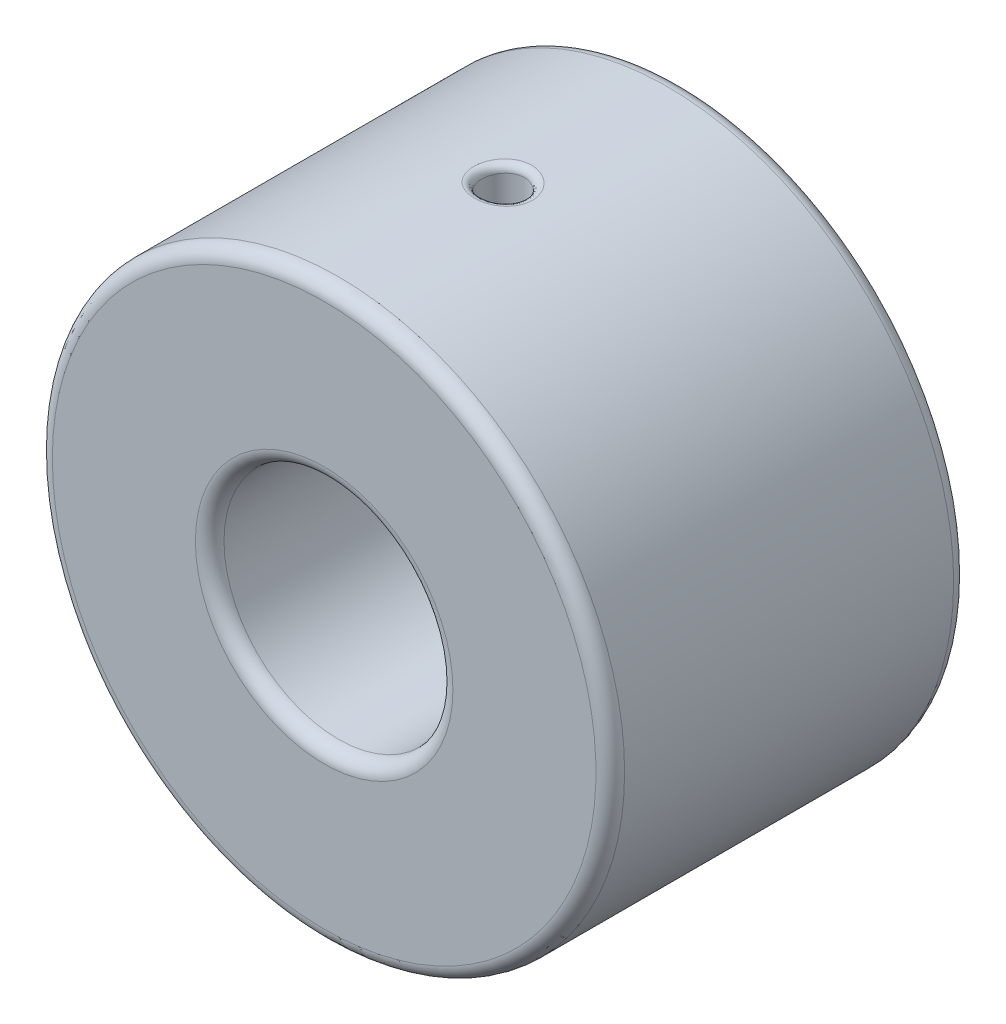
ISO-10303-21;
HEADER;
FILE_DESCRIPTION(('STEP AP214'),'2;1');
FILE_NAME('part.step','',(''),(''),'','','');
FILE_SCHEMA(('AUTOMOTIVE_DESIGN { 1 0 10303 214 1 1 1 1 }'));
ENDSEC;
DATA;
#1=APPLICATION_CONTEXT('core data for automotive mechanical design processes');
#2=APPLICATION_PROTOCOL_DEFINITION('international standard','automotive_design',2000,#1);
#3=PRODUCT_CONTEXT('',#1,'mechanical');
#4=PRODUCT('Part','Part','',(#3));
#5=PRODUCT_RELATED_PRODUCT_CATEGORY('part','',(#4));
#6=PRODUCT_DEFINITION_FORMATION('','',#4);
#7=PRODUCT_DEFINITION_CONTEXT('part definition',#1,'design');
#8=PRODUCT_DEFINITION('design','',#6,#7);
#9=PRODUCT_DEFINITION_SHAPE('','',#8);
#10=(LENGTH_UNIT() NAMED_UNIT(*) SI_UNIT(.MILLI.,.METRE.));
#11=(NAMED_UNIT(*) PLANE_ANGLE_UNIT() SI_UNIT($,.RADIAN.));
#12=(NAMED_UNIT(*) SI_UNIT($,.STERADIAN.) SOLID_ANGLE_UNIT());
#13=UNCERTAINTY_MEASURE_WITH_UNIT(LENGTH_MEASURE(1.E-05),#10,'distance_accuracy_value','');
#14=(GEOMETRIC_REPRESENTATION_CONTEXT(3) GLOBAL_UNCERTAINTY_ASSIGNED_CONTEXT((#13)) GLOBAL_UNIT_ASSIGNED_CONTEXT((#10,
#11,#12)) REPRESENTATION_CONTEXT('',''));
#15=CARTESIAN_POINT('',(0.,0.,0.));
#16=DIRECTION('',(0.,0.,1.));
#17=DIRECTION('',(1.,0.,0.));
#18=AXIS2_PLACEMENT_3D('',#15,#16,#17);
#19=CARTESIAN_POINT('',(0.,10.,6.25));
#20=DIRECTION('',(0.,0.,-1.));
#21=DIRECTION('',(-1.,0.,0.));
#22=AXIS2_PLACEMENT_3D('',#19,#20,#21);
#23=PLANE('',#22);
#24=CARTESIAN_POINT('',(0.,0.,6.25));
#25=DIRECTION('',(0.,0.,-1.));
#26=DIRECTION('',(-1.,0.,0.));
#27=AXIS2_PLACEMENT_3D('',#24,#25,#26);
#28=CIRCLE('',#27,9.5);
#29=CARTESIAN_POINT('',(-9.5,0.,6.25));
#30=VERTEX_POINT('',#29);
#31=EDGE_CURVE('E181',#30,#30,#28,.F.);
#32=ORIENTED_EDGE('',*,*,#31,.T.);
#33=EDGE_LOOP('',(#32));
#34=FACE_BOUND('',#33,.T.);
#35=CARTESIAN_POINT('',(0.,0.,6.25));
#36=DIRECTION('',(0.,0.,-1.));
#37=DIRECTION('',(-1.,0.,0.));
#38=AXIS2_PLACEMENT_3D('',#35,#36,#37);
#39=CIRCLE('',#38,4.5);
#40=CARTESIAN_POINT('',(-4.5,0.,6.25));
#41=VERTEX_POINT('',#40);
#42=EDGE_CURVE('E184',#41,#41,#39,.T.);
#43=ORIENTED_EDGE('',*,*,#42,.T.);
#44=EDGE_LOOP('',(#43));
#45=FACE_BOUND('',#44,.T.);
#46=ADVANCED_FACE('F29',(#34,#45),#23,.F.);
#47=CARTESIAN_POINT('',(0.,0.,6.25));
#48=DIRECTION('',(0.,0.,1.));
#49=DIRECTION('',(1.,0.,0.));
#50=AXIS2_PLACEMENT_3D('',#47,#48,#49);
#51=CYLINDRICAL_SURFACE('',#50,4.);
#52=CARTESIAN_POINT('',(0.198207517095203,-4.24177531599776,0.723335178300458));
#53=CARTESIAN_POINT('',(0.183981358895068,-3.99629323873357,0.727233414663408));
#54=CARTESIAN_POINT('',(0.248731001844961,-3.99225912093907,0.96444690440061));
#55=CARTESIAN_POINT('',(0.157704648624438,-4.24513975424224,0.734433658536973));
#56=CARTESIAN_POINT('',(0.145726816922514,-3.9978467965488,0.736857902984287));
#57=CARTESIAN_POINT('',(0.197903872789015,-3.99542565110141,0.979244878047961));
#58=CARTESIAN_POINT('',(0.116224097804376,-4.24754085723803,0.742133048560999));
#59=CARTESIAN_POINT('',(0.107250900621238,-3.99891038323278,0.743352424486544));
#60=CARTESIAN_POINT('',(0.145849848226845,-3.99768551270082,0.989510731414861));
#61=CARTESIAN_POINT('',(0.0325234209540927,-4.25014501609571,0.750473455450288));
#62=CARTESIAN_POINT('',(0.0298710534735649,-4.0000670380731,0.750411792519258));
#63=CARTESIAN_POINT('',(0.040813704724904,-4.00013648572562,1.00063127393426));
#64=CARTESIAN_POINT('',(-0.00969659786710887,-4.25034838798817,0.751115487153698));
#65=CARTESIAN_POINT('',(-0.00886428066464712,-4.00015518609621,0.75094659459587));
#66=CARTESIAN_POINT('',(-0.0121682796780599,-4.00032789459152,1.00148731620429));
#67=CARTESIAN_POINT('',(-0.0926928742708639,-4.24855530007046,0.745386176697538));
#68=CARTESIAN_POINT('',(-0.0854721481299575,-3.99936115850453,0.74610566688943));
#69=CARTESIAN_POINT('',(-0.11632046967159,-3.99864028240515,0.993848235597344));
#70=CARTESIAN_POINT('',(-0.133480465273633,-4.24660711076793,0.739168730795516));
#71=CARTESIAN_POINT('',(-0.123181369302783,-3.99850362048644,0.740880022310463));
#72=CARTESIAN_POINT('',(-0.167504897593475,-3.99680669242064,0.985558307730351));
#73=CARTESIAN_POINT('',(-0.213465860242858,-4.24079565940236,0.720155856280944));
#74=CARTESIAN_POINT('',(-0.19811474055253,-3.99585424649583,0.724538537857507));
#75=CARTESIAN_POINT('',(-0.267878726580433,-3.991337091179,0.960207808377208));
#76=CARTESIAN_POINT('',(-0.252661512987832,-4.23692989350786,0.707351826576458));
#77=CARTESIAN_POINT('',(-0.235202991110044,-3.99407140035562,0.713478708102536));
#78=CARTESIAN_POINT('',(-0.317065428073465,-3.9876987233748,0.943135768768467));
#79=CARTESIAN_POINT('',(-0.328515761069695,-4.22767437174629,0.675483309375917));
#80=CARTESIAN_POINT('',(-0.308231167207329,-3.98962221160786,0.685208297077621));
#81=CARTESIAN_POINT('',(-0.412255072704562,-3.97898764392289,0.900644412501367));
#82=CARTESIAN_POINT('',(-0.365162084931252,-4.22227780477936,0.656390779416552));
#83=CARTESIAN_POINT('',(-0.344078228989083,-3.9869656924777,0.668062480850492));
#84=CARTESIAN_POINT('',(-0.458242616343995,-3.9739085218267,0.87518770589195));
#85=CARTESIAN_POINT('',(-0.434774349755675,-4.21053922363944,0.612507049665));
#86=CARTESIAN_POINT('',(-0.41339896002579,-3.98094843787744,0.62758484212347));
#87=CARTESIAN_POINT('',(-0.545599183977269,-3.96286044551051,0.816676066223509));
#88=CARTESIAN_POINT('',(-0.467739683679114,-4.20419705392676,0.587714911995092));
#89=CARTESIAN_POINT('',(-0.446845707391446,-3.9775997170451,0.604349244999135));
#90=CARTESIAN_POINT('',(-0.586967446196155,-3.95689134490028,0.783619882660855));
#91=CARTESIAN_POINT('',(-0.529916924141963,-4.19107219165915,0.532411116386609));
#92=CARTESIAN_POINT('',(-0.510914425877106,-3.97042803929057,0.551287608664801));
#93=CARTESIAN_POINT('',(-0.664993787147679,-3.94453853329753,0.709881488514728));
#94=CARTESIAN_POINT('',(-0.55901554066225,-4.1842824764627,0.501772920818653));
#95=CARTESIAN_POINT('',(-0.541491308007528,-3.96659992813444,0.521383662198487));
#96=CARTESIAN_POINT('',(-0.701509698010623,-3.93814821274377,0.669030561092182));
#97=CARTESIAN_POINT('',(-0.611651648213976,-4.17117225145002,0.436064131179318));
#98=CARTESIAN_POINT('',(-0.597467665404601,-3.95901010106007,0.456008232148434));
#99=CARTESIAN_POINT('',(-0.767562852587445,-3.92580917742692,0.581418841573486));
#100=CARTESIAN_POINT('',(-0.635196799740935,-4.16485110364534,0.400999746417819));
#101=CARTESIAN_POINT('',(-0.622959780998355,-3.95524377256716,0.420573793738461));
#102=CARTESIAN_POINT('',(-0.79710970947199,-3.9198598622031,0.534666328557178));
#103=CARTESIAN_POINT('',(-0.676274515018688,-4.15333973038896,0.327040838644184));
#104=CARTESIAN_POINT('',(-0.667760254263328,-3.94826730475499,0.344823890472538));
#105=CARTESIAN_POINT('',(-0.848658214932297,-3.90902562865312,0.436054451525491));
#106=CARTESIAN_POINT('',(-0.693758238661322,-4.14815880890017,0.288118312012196));
#107=CARTESIAN_POINT('',(-0.687129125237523,-3.94504843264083,0.304432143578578));
#108=CARTESIAN_POINT('',(-0.87059857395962,-3.90414946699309,0.384157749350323));
#109=CARTESIAN_POINT('',(-0.721900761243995,-4.13961366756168,0.207774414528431));
#110=CARTESIAN_POINT('',(-0.718389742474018,-3.93969613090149,0.220390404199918));
#111=CARTESIAN_POINT('',(-0.905914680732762,-3.89610698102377,0.277032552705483));
#112=CARTESIAN_POINT('',(-0.732560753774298,-4.1362491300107,0.166353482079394));
#113=CARTESIAN_POINT('',(-0.730380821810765,-3.93754706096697,0.176637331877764));
#114=CARTESIAN_POINT('',(-0.919291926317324,-3.89294035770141,0.221804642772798));
#115=CARTESIAN_POINT('',(-0.746541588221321,-4.13180250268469,0.0831603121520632));
#116=CARTESIAN_POINT('',(-0.746081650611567,-3.93470679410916,0.0885169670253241));
#117=CARTESIAN_POINT('',(-0.936836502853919,-3.8887552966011,0.110880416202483));
#118=CARTESIAN_POINT('',(-0.750018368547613,-4.1306719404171,0.0414157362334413));
#119=CARTESIAN_POINT('',(-0.750020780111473,-3.93397511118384,0.0440435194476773));
#120=CARTESIAN_POINT('',(-0.941199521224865,-3.88769123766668,0.0552209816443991));
#121=CARTESIAN_POINT('',(-0.749981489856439,-4.13068392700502,-0.0420675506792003));
#122=CARTESIAN_POINT('',(-0.749979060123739,-3.93398284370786,-0.0447371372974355));
#123=CARTESIAN_POINT('',(-0.941153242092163,-3.88770251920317,-0.0560900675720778));
#124=CARTESIAN_POINT('',(-0.746468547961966,-4.13182624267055,-0.0838062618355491));
#125=CARTESIAN_POINT('',(-0.745998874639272,-3.93472213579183,-0.0892029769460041));
#126=CARTESIAN_POINT('',(-0.936744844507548,-3.8887776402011,-0.111741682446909));
#127=CARTESIAN_POINT('',(-0.732698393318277,-4.13620485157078,-0.165323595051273));
#128=CARTESIAN_POINT('',(-0.730536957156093,-3.93751845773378,-0.175539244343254));
#129=CARTESIAN_POINT('',(-0.919464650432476,-3.89289868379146,-0.220431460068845));
#130=CARTESIAN_POINT('',(-0.722561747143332,-4.13940369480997,-0.205123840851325));
#131=CARTESIAN_POINT('',(-0.719137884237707,-3.93956109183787,-0.217580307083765));
#132=CARTESIAN_POINT('',(-0.906744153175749,-3.89590935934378,-0.273498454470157));
#133=CARTESIAN_POINT('',(-0.695959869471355,-4.14749857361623,-0.282519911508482));
#134=CARTESIAN_POINT('',(-0.689573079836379,-3.94463617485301,-0.298585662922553));
#135=CARTESIAN_POINT('',(-0.873361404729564,-3.90352806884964,-0.376693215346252));
#136=CARTESIAN_POINT('',(-0.679483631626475,-4.15239755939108,-0.320111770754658));
#137=CARTESIAN_POINT('',(-0.671309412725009,-3.94768400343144,-0.33763806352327));
#138=CARTESIAN_POINT('',(-0.852685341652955,-3.90813887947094,-0.426815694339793));
#139=CARTESIAN_POINT('',(-0.640409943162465,-4.16342468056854,-0.392546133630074));
#140=CARTESIAN_POINT('',(-0.62862317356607,-3.95438662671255,-0.411967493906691));
#141=CARTESIAN_POINT('',(-0.803651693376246,-3.91851734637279,-0.523394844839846));
#142=CARTESIAN_POINT('',(-0.617729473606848,-4.16956917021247,-0.427342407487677));
#143=CARTESIAN_POINT('',(-0.604018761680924,-3.95806144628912,-0.447217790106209));
#144=CARTESIAN_POINT('',(-0.775189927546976,-3.92430039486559,-0.569789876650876));
#145=CARTESIAN_POINT('',(-0.566978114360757,-4.18236664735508,-0.492694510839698));
#146=CARTESIAN_POINT('',(-0.549909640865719,-3.96550462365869,-0.512428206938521));
#147=CARTESIAN_POINT('',(-0.711501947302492,-3.93634507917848,-0.656926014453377));
#148=CARTESIAN_POINT('',(-0.538906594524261,-4.18901969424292,-0.523249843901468));
#149=CARTESIAN_POINT('',(-0.520319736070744,-3.96927819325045,-0.542365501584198));
#150=CARTESIAN_POINT('',(-0.676274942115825,-3.94260677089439,-0.697666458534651));
#151=CARTESIAN_POINT('',(-0.477378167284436,-4.20227640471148,-0.580002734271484));
#152=CARTESIAN_POINT('',(-0.456673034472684,-3.97657206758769,-0.597058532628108));
#153=CARTESIAN_POINT('',(-0.599062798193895,-3.95508367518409,-0.773336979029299));
#154=CARTESIAN_POINT('',(-0.443809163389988,-4.20887514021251,-0.60607951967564));
#155=CARTESIAN_POINT('',(-0.422492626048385,-3.98007855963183,-0.621590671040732));
#156=CARTESIAN_POINT('',(-0.556936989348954,-3.96129424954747,-0.808106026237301));
#157=CARTESIAN_POINT('',(-0.372696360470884,-4.22111826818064,-0.652220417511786));
#158=CARTESIAN_POINT('',(-0.351482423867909,-3.98638752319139,-0.664287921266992));
#159=CARTESIAN_POINT('',(-0.46769739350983,-3.97281719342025,-0.869627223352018));
#160=CARTESIAN_POINT('',(-0.335155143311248,-4.22676327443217,-0.672288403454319));
#161=CARTESIAN_POINT('',(-0.314677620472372,-3.98917761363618,-0.682351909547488));
#162=CARTESIAN_POINT('',(-0.420586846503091,-3.97813014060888,-0.89638453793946));
#163=CARTESIAN_POINT('',(-0.264327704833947,-4.23557645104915,-0.702731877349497));
#164=CARTESIAN_POINT('',(-0.246433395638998,-3.99342360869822,-0.709384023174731));
#165=CARTESIAN_POINT('',(-0.331705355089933,-3.98642489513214,-0.936975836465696));
#166=CARTESIAN_POINT('',(-0.231529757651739,-4.2390092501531,-0.714211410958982));
#167=CARTESIAN_POINT('',(-0.215261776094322,-3.99502424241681,-0.719370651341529));
#168=CARTESIAN_POINT('',(-0.290547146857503,-3.98965576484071,-0.952281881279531));
#169=CARTESIAN_POINT('',(-0.164605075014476,-4.2445646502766,-0.732535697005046));
#170=CARTESIAN_POINT('',(-0.152265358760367,-3.99757990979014,-0.735205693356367));
#171=CARTESIAN_POINT('',(-0.206563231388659,-3.99488437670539,-0.976714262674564));
#172=CARTESIAN_POINT('',(-0.130478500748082,-4.24668740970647,-0.739381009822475));
#173=CARTESIAN_POINT('',(-0.120516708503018,-3.99852825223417,-0.74101190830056));
#174=CARTESIAN_POINT('',(-0.163737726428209,-3.99688226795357,-0.985841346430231));
#175=CARTESIAN_POINT('',(-0.0551063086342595,-4.24971428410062,-0.749108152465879));
#176=CARTESIAN_POINT('',(-0.0506795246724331,-3.99987886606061,-0.74926880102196));
#177=CARTESIAN_POINT('',(-0.0691530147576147,-3.99973109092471,-0.998810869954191));
#178=CARTESIAN_POINT('',(-0.0137232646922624,-4.2503161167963,-0.751008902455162));
#179=CARTESIAN_POINT('',(-0.0126806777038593,-4.0001398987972,-0.750852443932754));
#180=CARTESIAN_POINT('',(-0.0172213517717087,-4.00029752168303,-1.00134520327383));
#181=CARTESIAN_POINT('',(0.0687915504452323,-4.24936675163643,-0.747979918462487));
#182=CARTESIAN_POINT('',(0.0634009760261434,-3.99972033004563,-0.748295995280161));
#183=CARTESIAN_POINT('',(0.0863266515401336,-3.9994040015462,-0.997306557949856));
#184=CARTESIAN_POINT('',(0.109923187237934,-4.24781448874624,-0.743046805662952));
#185=CARTESIAN_POINT('',(0.101319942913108,-3.99904105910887,-0.744164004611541));
#186=CARTESIAN_POINT('',(0.137942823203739,-3.99794304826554,-0.99072907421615));
#187=CARTESIAN_POINT('',(0.19068992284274,-4.24272997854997,-0.7265217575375));
#188=CARTESIAN_POINT('',(0.176684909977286,-3.99674109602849,-0.730026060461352));
#189=CARTESIAN_POINT('',(0.239297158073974,-3.99315762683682,-0.968695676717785));
#190=CARTESIAN_POINT('',(0.230327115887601,-4.23920062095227,-0.714939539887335));
#191=CARTESIAN_POINT('',(0.213988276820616,-3.99513091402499,-0.720085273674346));
#192=CARTESIAN_POINT('',(0.289037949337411,-3.98983587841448,-0.953252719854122));
#193=CARTESIAN_POINT('',(0.307134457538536,-4.23053741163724,-0.685465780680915));
#194=CARTESIAN_POINT('',(0.287500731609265,-3.99101344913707,-0.694116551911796));
#195=CARTESIAN_POINT('',(0.385423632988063,-3.98168226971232,-0.913954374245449));
#196=CARTESIAN_POINT('',(0.344301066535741,-4.2254013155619,-0.667565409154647));
#197=CARTESIAN_POINT('',(0.323610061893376,-3.98851838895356,-0.678168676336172));
#198=CARTESIAN_POINT('',(0.432064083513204,-3.97684829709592,-0.890087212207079));
#199=CARTESIAN_POINT('',(0.415543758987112,-4.21400477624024,-0.625738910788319));
#200=CARTESIAN_POINT('',(0.394078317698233,-3.98274987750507,-0.639886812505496));
#201=CARTESIAN_POINT('',(0.521466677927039,-3.96612214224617,-0.834318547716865));
#202=CARTESIAN_POINT('',(0.44957957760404,-4.20773213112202,-0.601746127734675));
#203=CARTESIAN_POINT('',(0.428377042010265,-3.97948069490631,-0.617580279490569));
#204=CARTESIAN_POINT('',(0.564178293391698,-3.96021847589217,-0.802328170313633));
#205=CARTESIAN_POINT('',(0.51319896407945,-4.19477357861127,-0.548496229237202));
#206=CARTESIAN_POINT('',(0.493541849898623,-3.97247861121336,-0.566840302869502));
#207=CARTESIAN_POINT('',(0.644014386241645,-3.94802219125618,-0.731328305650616));
#208=CARTESIAN_POINT('',(0.542782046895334,-4.18808762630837,-0.519238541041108));
#209=CARTESIAN_POINT('',(0.524431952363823,-3.96875264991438,-0.538488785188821));
#210=CARTESIAN_POINT('',(0.681138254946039,-3.9417295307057,-0.692318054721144));
#211=CARTESIAN_POINT('',(0.59733173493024,-4.1748747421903,-0.455513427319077));
#212=CARTESIAN_POINT('',(0.582109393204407,-3.96118263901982,-0.475505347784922));
#213=CARTESIAN_POINT('',(0.749592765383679,-3.92929387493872,-0.607351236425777));
#214=CARTESIAN_POINT('',(0.622180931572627,-4.16835466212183,-0.420944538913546));
#215=CARTESIAN_POINT('',(0.608876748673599,-3.95733419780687,-0.440780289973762));
#216=CARTESIAN_POINT('',(0.780776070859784,-3.92315732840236,-0.561259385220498));
#217=CARTESIAN_POINT('',(0.665686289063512,-4.15639003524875,-0.348079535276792));
#218=CARTESIAN_POINT('',(0.656129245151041,-3.95013725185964,-0.366504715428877));
#219=CARTESIAN_POINT('',(0.835371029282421,-3.9118965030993,-0.464106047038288));
#220=CARTESIAN_POINT('',(0.684351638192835,-4.15094389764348,-0.309789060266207));
#221=CARTESIAN_POINT('',(0.676731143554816,-3.94677615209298,-0.326937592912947));
#222=CARTESIAN_POINT('',(0.85879421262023,-3.9067707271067,-0.413052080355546));
#223=CARTESIAN_POINT('',(0.714882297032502,-4.14178591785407,-0.230714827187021));
#224=CARTESIAN_POINT('',(0.710549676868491,-3.9410688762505,-0.244491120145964));
#225=CARTESIAN_POINT('',(0.89710719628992,-3.89815145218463,-0.307619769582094));
#226=CARTESIAN_POINT('',(0.726784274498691,-4.13806474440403,-0.189945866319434));
#227=CARTESIAN_POINT('',(0.723906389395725,-3.93870201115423,-0.201542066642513));
#228=CARTESIAN_POINT('',(0.912043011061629,-3.89464917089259,-0.253261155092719));
#229=CARTESIAN_POINT('',(0.743547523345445,-4.13276747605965,-0.106911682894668));
#230=CARTESIAN_POINT('',(0.742702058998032,-3.93532784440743,-0.113746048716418));
#231=CARTESIAN_POINT('',(0.933079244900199,-3.88966350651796,-0.142548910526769));
#232=CARTESIAN_POINT('',(0.748410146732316,-4.13119096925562,-0.0646467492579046));
#233=CARTESIAN_POINT('',(0.748207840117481,-3.93430881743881,-0.0687572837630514));
#234=CARTESIAN_POINT('',(0.939181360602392,-3.88817973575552,-0.0861956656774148));
#235=CARTESIAN_POINT('',(0.75089649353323,-4.13038860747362,0.0190316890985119));
#236=CARTESIAN_POINT('',(0.751009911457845,-3.93379309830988,0.0202201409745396));
#237=CARTESIAN_POINT('',(0.94230148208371,-3.88742457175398,0.0253755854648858));
#238=CARTESIAN_POINT('',(0.748700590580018,-4.131104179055,0.0604396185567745));
#239=CARTESIAN_POINT('',(0.748520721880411,-3.93425663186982,0.0643599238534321));
#240=CARTESIAN_POINT('',(0.939545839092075,-3.8880980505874,0.0805861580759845));
#241=CARTESIAN_POINT('',(0.737538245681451,-4.13467202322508,0.142277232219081));
#242=CARTESIAN_POINT('',(0.735970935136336,-3.93654030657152,0.15115920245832));
#243=CARTESIAN_POINT('',(0.925538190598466,-3.89145602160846,0.18970297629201));
#244=CARTESIAN_POINT('',(0.728571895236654,-4.13752426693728,0.182706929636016));
#245=CARTESIAN_POINT('',(0.725867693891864,-3.93836814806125,0.193962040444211));
#246=CARTESIAN_POINT('',(0.914286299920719,-3.89414048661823,0.243609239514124));
#247=CARTESIAN_POINT('',(0.704222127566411,-4.14501171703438,0.261254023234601));
#248=CARTESIAN_POINT('',(0.698740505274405,-3.94308285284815,0.276401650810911));
#249=CARTESIAN_POINT('',(0.883729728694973,-3.90118749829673,0.348338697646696));
#250=CARTESIAN_POINT('',(0.688871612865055,-4.14963777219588,0.299382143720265));
#251=CARTESIAN_POINT('',(0.681669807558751,-3.94597771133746,0.316158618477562));
#252=CARTESIAN_POINT('',(0.864466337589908,-3.90554143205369,0.399176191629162));
#253=CARTESIAN_POINT('',(0.652187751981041,-4.16016204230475,0.37259983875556));
#254=CARTESIAN_POINT('',(0.641447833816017,-3.95241727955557,0.391608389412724));
#255=CARTESIAN_POINT('',(0.818431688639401,-3.9154466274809,0.496799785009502));
#256=CARTESIAN_POINT('',(0.630845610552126,-4.16606212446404,0.407684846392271));
#257=CARTESIAN_POINT('',(0.618189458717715,-3.95597582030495,0.427343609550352));
#258=CARTESIAN_POINT('',(0.791649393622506,-3.92099964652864,0.543579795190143));
#259=CARTESIAN_POINT('',(0.582221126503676,-4.17863352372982,0.474624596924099));
#260=CARTESIAN_POINT('',(0.566070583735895,-3.96335798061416,0.494547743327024));
#261=CARTESIAN_POINT('',(0.730630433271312,-3.93283155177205,0.63283279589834));
#262=CARTESIAN_POINT('',(0.554814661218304,-4.18531933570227,0.506387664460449));
#263=CARTESIAN_POINT('',(0.53700869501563,-3.96719198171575,0.525881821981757));
#264=CARTESIAN_POINT('',(0.696238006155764,-3.93912408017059,0.67518355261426));
#265=CARTESIAN_POINT('',(0.495093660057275,-4.19861424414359,0.564916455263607));
#266=CARTESIAN_POINT('',(0.474872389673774,-3.97458649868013,0.582665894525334));
#267=CARTESIAN_POINT('',(0.621294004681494,-3.95163693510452,0.753221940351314));
#268=CARTESIAN_POINT('',(0.462778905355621,-4.20522333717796,0.59168195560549));
#269=CARTESIAN_POINT('',(0.441745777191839,-3.97814425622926,0.608049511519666));
#270=CARTESIAN_POINT('',(0.580742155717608,-3.95785725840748,0.788909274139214));
#271=CARTESIAN_POINT('',(0.393537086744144,-4.21774506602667,0.639871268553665));
#272=CARTESIAN_POINT('',(0.372119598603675,-3.98468093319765,0.653000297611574));
#273=CARTESIAN_POINT('',(0.493850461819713,-3.96964241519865,0.853161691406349));
#274=CARTESIAN_POINT('',(0.356545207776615,-4.22364504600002,0.661203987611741));
#275=CARTESIAN_POINT('',(0.335591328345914,-3.98763751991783,0.672362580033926));
#276=CARTESIAN_POINT('',(0.447429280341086,-3.97519533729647,0.881605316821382));
#277=CARTESIAN_POINT('',(0.279437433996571,-4.23395125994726,0.69729742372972));
#278=CARTESIAN_POINT('',(0.260769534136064,-3.99266734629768,0.704674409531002));
#279=CARTESIAN_POINT('',(0.350666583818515,-3.98489530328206,0.929729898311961));
#280=CARTESIAN_POINT('',(0.239326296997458,-4.23835971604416,0.712067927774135));
#281=CARTESIAN_POINT('',(0.22255995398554,-3.99472652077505,0.717527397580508));
#282=CARTESIAN_POINT('',(0.300331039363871,-3.98904443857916,0.949423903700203));
#283=CARTESIAN_POINT('',(0.198207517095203,-4.24177531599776,0.723335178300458));
#284=CARTESIAN_POINT('',(0.183981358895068,-3.99629323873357,0.727233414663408));
#285=CARTESIAN_POINT('',(0.248731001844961,-3.99225912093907,0.96444690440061));
#286=(BOUNDED_SURFACE() B_SPLINE_SURFACE(3,2,((#52,#53,#54),(#55,#56,#57),(#58,#59,#60),(#61,
#62,#63),(#64,#65,#66),(#67,#68,#69),(#70,#71,#72),(#73,#74,#75),(#76,#77,#78),(#79,#80,#81),
(#82,#83,#84),(#85,#86,#87),(#88,#89,#90),(#91,#92,#93),(#94,#95,#96),(#97,#98,#99),(#100,#101,
#102),(#103,#104,#105),(#106,#107,#108),(#109,#110,#111),(#112,#113,#114),(#115,#116,#117),
(#118,#119,#120),(#121,#122,#123),(#124,#125,#126),(#127,#128,#129),(#130,#131,#132),(#133,#134,
#135),(#136,#137,#138),(#139,#140,#141),(#142,#143,#144),(#145,#146,#147),(#148,#149,#150),
(#151,#152,#153),(#154,#155,#156),(#157,#158,#159),(#160,#161,#162),(#163,#164,#165),(#166,#167,
#168),(#169,#170,#171),(#172,#173,#174),(#175,#176,#177),(#178,#179,#180),(#181,#182,#183),
(#184,#185,#186),(#187,#188,#189),(#190,#191,#192),(#193,#194,#195),(#196,#197,#198),(#199,#200,
#201),(#202,#203,#204),(#205,#206,#207),(#208,#209,#210),(#211,#212,#213),(#214,#215,#216),
(#217,#218,#219),(#220,#221,#222),(#223,#224,#225),(#226,#227,#228),(#229,#230,#231),(#232,#233,
#234),(#235,#236,#237),(#238,#239,#240),(#241,#242,#243),(#244,#245,#246),(#247,#248,#249),
(#250,#251,#252),(#253,#254,#255),(#256,#257,#258),(#259,#260,#261),(#262,#263,#264),(#265,#266,
#267),(#268,#269,#270),(#271,#272,#273),(#274,#275,#276),(#277,#278,#279),(#280,#281,#282),
(#283,#284,#285)),.UNSPECIFIED.,.T.,.F.,.F.) B_SPLINE_SURFACE_WITH_KNOTS((4,2,2,2,2,2,2,2,2,2,2,
2,2,2,2,2,2,2,2,2,2,2,2,2,2,2,2,2,2,2,2,2,2,2,2,2,2,2,4),(3,3),(0.,0.168080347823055,
0.336136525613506,0.500497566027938,0.665073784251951,0.830394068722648,0.995741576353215,
1.16518755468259,1.33439841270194,1.50494262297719,1.67545699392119,1.84222906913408,
2.00898403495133,2.17278519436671,2.33687202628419,2.50327206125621,2.6696915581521,
2.84006465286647,3.01032768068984,3.14925878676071,3.28817308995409,3.45307575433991,
3.61805997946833,3.78280369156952,3.94777855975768,4.1146426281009,4.28152486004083,
4.45212152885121,4.62246356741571,4.79187305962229,4.96125001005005,5.12633344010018,
5.29141463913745,5.4556553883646,5.6201385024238,5.78836456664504,5.95659813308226,
6.12749014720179,6.29812642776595),(0.,1.),
.UNSPECIFIED.) GEOMETRIC_REPRESENTATION_ITEM() RATIONAL_B_SPLINE_SURFACE(((1.,0.712893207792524,
1.),(1.,0.710538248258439,1.),(1.,0.708843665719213,1.),(1.,0.707005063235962,1.),(1.,
0.706860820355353,1.),(1.,0.708127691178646,1.),(1.,0.709504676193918,1.),(1.,0.713582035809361,
1.),(1.,0.716284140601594,1.),(1.,0.722689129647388,1.),(1.,0.726396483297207,1.),(1.,
0.734368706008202,1.),(1.,0.738633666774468,1.),(1.,0.747357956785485,1.),(1.,0.751819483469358,
1.),(1.,0.760342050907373,1.),(1.,0.764403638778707,1.),(1.,0.771737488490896,1.),(1.,
0.775003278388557,1.),(1.,0.780360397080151,1.),(1.,0.782451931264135,1.),(1.,0.785211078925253,
1.),(1.,0.785908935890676,1.),(1.,0.785901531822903,1.),(1.,0.785196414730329,1.),(1.,
0.782479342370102,1.),(1.,0.780490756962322,1.),(1.,0.775418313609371,1.),(1.,0.772332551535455,
1.),(1.,0.765316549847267,1.),(1.,0.76137501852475,1.),(1.,0.753071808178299,1.),(1.,
0.748710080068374,1.),(1.,0.739919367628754,1.),(1.,0.735491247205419,1.),(1.,0.727190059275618,
1.),(1.,0.72331663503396,1.),(1.,0.717222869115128,1.),(1.,0.714829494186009,1.),(1.,
0.710940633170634,1.),(1.,0.709445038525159,1.),(1.,0.707310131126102,1.),(1.,0.706883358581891,
1.),(1.,0.707554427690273,1.),(1.,0.708653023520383,1.),(1.,0.712227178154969,1.),(1.,
0.714700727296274,1.),(1.,0.720714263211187,1.),(1.,0.724255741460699,1.),(1.,0.732025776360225,
1.),(1.,0.736261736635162,1.),(1.,0.744910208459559,1.),(1.,0.749322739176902,1.),(1.,
0.757948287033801,1.),(1.,0.762154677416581,1.),(1.,0.769803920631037,1.),(1.,0.773247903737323,
1.),(1.,0.779004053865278,1.),(1.,0.781322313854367,1.),(1.,0.784614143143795,1.),(1.,
0.78558797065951,1.),(1.,0.786084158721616,1.),(1.,0.785642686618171,1.),(1.,0.783431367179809,
1.),(1.,0.781661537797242,1.),(1.,0.776980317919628,1.),(1.,0.774074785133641,1.),(1.,
0.767399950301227,1.),(1.,0.763629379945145,1.),(1.,0.755505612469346,1.),(1.,0.751141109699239,
1.),(1.,0.742360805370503,1.),(1.,0.737945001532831,1.),(1.,0.729489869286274,1.),(1.,
0.725457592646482,1.),(1.,0.718355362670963,1.),(1.,0.715283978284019,1.),(1.,0.712893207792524,1.))) REPRESENTATION_ITEM('') SURFACE());
#287=CARTESIAN_POINT('',(0.248731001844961,-3.99225912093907,0.96444690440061));
#288=CARTESIAN_POINT('',(0.197903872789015,-3.99542565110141,0.979244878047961));
#289=CARTESIAN_POINT('',(0.145849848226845,-3.99768551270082,0.989510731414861));
#290=CARTESIAN_POINT('',(0.0408137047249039,-4.00013648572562,1.00063127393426));
#291=CARTESIAN_POINT('',(-0.01216827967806,-4.00032789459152,1.00148731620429));
#292=CARTESIAN_POINT('',(-0.11632046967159,-3.99864028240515,0.993848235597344));
#293=CARTESIAN_POINT('',(-0.167504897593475,-3.99680669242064,0.985558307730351));
#294=CARTESIAN_POINT('',(-0.267878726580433,-3.991337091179,0.960207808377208));
#295=CARTESIAN_POINT('',(-0.317065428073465,-3.9876987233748,0.943135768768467));
#296=CARTESIAN_POINT('',(-0.412255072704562,-3.97898764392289,0.900644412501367));
#297=CARTESIAN_POINT('',(-0.458242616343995,-3.9739085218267,0.87518770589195));
#298=CARTESIAN_POINT('',(-0.545599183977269,-3.96286044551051,0.816676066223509));
#299=CARTESIAN_POINT('',(-0.586967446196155,-3.95689134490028,0.783619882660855));
#300=CARTESIAN_POINT('',(-0.664993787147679,-3.94453853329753,0.709881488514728));
#301=CARTESIAN_POINT('',(-0.701509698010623,-3.93814821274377,0.669030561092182));
#302=CARTESIAN_POINT('',(-0.767562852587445,-3.92580917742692,0.581418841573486));
#303=CARTESIAN_POINT('',(-0.79710970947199,-3.9198598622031,0.534666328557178));
#304=CARTESIAN_POINT('',(-0.848658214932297,-3.90902562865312,0.436054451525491));
#305=CARTESIAN_POINT('',(-0.87059857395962,-3.90414946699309,0.384157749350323));
#306=CARTESIAN_POINT('',(-0.905914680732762,-3.89610698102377,0.277032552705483));
#307=CARTESIAN_POINT('',(-0.919291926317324,-3.89294035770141,0.221804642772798));
#308=CARTESIAN_POINT('',(-0.936836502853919,-3.8887552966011,0.110880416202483));
#309=CARTESIAN_POINT('',(-0.941199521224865,-3.88769123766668,0.0552209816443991));
#310=CARTESIAN_POINT('',(-0.941153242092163,-3.88770251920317,-0.0560900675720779));
#311=CARTESIAN_POINT('',(-0.936744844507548,-3.8887776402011,-0.111741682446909));
#312=CARTESIAN_POINT('',(-0.919464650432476,-3.89289868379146,-0.220431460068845));
#313=CARTESIAN_POINT('',(-0.906744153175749,-3.89590935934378,-0.273498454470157));
#314=CARTESIAN_POINT('',(-0.873361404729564,-3.90352806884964,-0.376693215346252));
#315=CARTESIAN_POINT('',(-0.852685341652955,-3.90813887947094,-0.426815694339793));
#316=CARTESIAN_POINT('',(-0.803651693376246,-3.91851734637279,-0.523394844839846));
#317=CARTESIAN_POINT('',(-0.775189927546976,-3.92430039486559,-0.569789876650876));
#318=CARTESIAN_POINT('',(-0.711501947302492,-3.93634507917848,-0.656926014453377));
#319=CARTESIAN_POINT('',(-0.676274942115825,-3.94260677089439,-0.697666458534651));
#320=CARTESIAN_POINT('',(-0.599062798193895,-3.95508367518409,-0.773336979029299));
#321=CARTESIAN_POINT('',(-0.556936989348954,-3.96129424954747,-0.808106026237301));
#322=CARTESIAN_POINT('',(-0.467697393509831,-3.97281719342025,-0.869627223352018));
#323=CARTESIAN_POINT('',(-0.420586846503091,-3.97813014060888,-0.89638453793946));
#324=CARTESIAN_POINT('',(-0.331705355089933,-3.98642489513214,-0.936975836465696));
#325=CARTESIAN_POINT('',(-0.290547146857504,-3.98965576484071,-0.952281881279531));
#326=CARTESIAN_POINT('',(-0.20656323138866,-3.99488437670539,-0.976714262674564));
#327=CARTESIAN_POINT('',(-0.163737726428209,-3.99688226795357,-0.985841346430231));
#328=CARTESIAN_POINT('',(-0.0691530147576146,-3.99973109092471,-0.998810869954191));
#329=CARTESIAN_POINT('',(-0.0172213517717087,-4.00029752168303,-1.00134520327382));
#330=CARTESIAN_POINT('',(0.0863266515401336,-3.9994040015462,-0.997306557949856));
#331=CARTESIAN_POINT('',(0.13794282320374,-3.99794304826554,-0.99072907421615));
#332=CARTESIAN_POINT('',(0.239297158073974,-3.99315762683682,-0.968695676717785));
#333=CARTESIAN_POINT('',(0.289037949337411,-3.98983587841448,-0.953252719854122));
#334=CARTESIAN_POINT('',(0.385423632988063,-3.98168226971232,-0.913954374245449));
#335=CARTESIAN_POINT('',(0.432064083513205,-3.97684829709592,-0.890087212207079));
#336=CARTESIAN_POINT('',(0.52146667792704,-3.96612214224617,-0.834318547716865));
#337=CARTESIAN_POINT('',(0.564178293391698,-3.96021847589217,-0.802328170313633));
#338=CARTESIAN_POINT('',(0.644014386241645,-3.94802219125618,-0.731328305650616));
#339=CARTESIAN_POINT('',(0.681138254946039,-3.9417295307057,-0.692318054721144));
#340=CARTESIAN_POINT('',(0.74959276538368,-3.92929387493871,-0.607351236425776));
#341=CARTESIAN_POINT('',(0.780776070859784,-3.92315732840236,-0.561259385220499));
#342=CARTESIAN_POINT('',(0.835371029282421,-3.9118965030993,-0.464106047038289));
#343=CARTESIAN_POINT('',(0.85879421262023,-3.9067707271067,-0.413052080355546));
#344=CARTESIAN_POINT('',(0.89710719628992,-3.89815145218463,-0.307619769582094));
#345=CARTESIAN_POINT('',(0.912043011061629,-3.89464917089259,-0.253261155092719));
#346=CARTESIAN_POINT('',(0.933079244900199,-3.88966350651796,-0.142548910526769));
#347=CARTESIAN_POINT('',(0.939181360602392,-3.88817973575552,-0.0861956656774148));
#348=CARTESIAN_POINT('',(0.94230148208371,-3.88742457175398,0.0253755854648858));
#349=CARTESIAN_POINT('',(0.939545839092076,-3.8880980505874,0.0805861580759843));
#350=CARTESIAN_POINT('',(0.925538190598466,-3.89145602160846,0.18970297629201));
#351=CARTESIAN_POINT('',(0.914286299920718,-3.89414048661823,0.243609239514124));
#352=CARTESIAN_POINT('',(0.883729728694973,-3.90118749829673,0.348338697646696));
#353=CARTESIAN_POINT('',(0.864466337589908,-3.90554143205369,0.399176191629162));
#354=CARTESIAN_POINT('',(0.818431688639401,-3.9154466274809,0.496799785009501));
#355=CARTESIAN_POINT('',(0.791649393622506,-3.92099964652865,0.543579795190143));
#356=CARTESIAN_POINT('',(0.730630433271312,-3.93283155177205,0.63283279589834));
#357=CARTESIAN_POINT('',(0.696238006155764,-3.93912408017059,0.67518355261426));
#358=CARTESIAN_POINT('',(0.621294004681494,-3.95163693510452,0.753221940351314));
#359=CARTESIAN_POINT('',(0.580742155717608,-3.95785725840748,0.788909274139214));
#360=CARTESIAN_POINT('',(0.493850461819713,-3.96964241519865,0.853161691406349));
#361=CARTESIAN_POINT('',(0.447429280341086,-3.97519533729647,0.881605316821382));
#362=CARTESIAN_POINT('',(0.350666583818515,-3.98489530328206,0.929729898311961));
#363=CARTESIAN_POINT('',(0.300331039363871,-3.98904443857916,0.949423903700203));
#364=CARTESIAN_POINT('',(0.248731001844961,-3.99225912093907,0.96444690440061));
#365=B_SPLINE_CURVE_WITH_KNOTS('',3,(#287,#288,#289,#290,#291,#292,#293,#294,#295,#296,#297,
#298,#299,#300,#301,#302,#303,#304,#305,#306,#307,#308,#309,#310,#311,#312,#313,#314,#315,#316,
#317,#318,#319,#320,#321,#322,#323,#324,#325,#326,#327,#328,#329,#330,#331,#332,#333,#334,#335,
#336,#337,#338,#339,#340,#341,#342,#343,#344,#345,#346,#347,#348,#349,#350,#351,#352,#353,#354,
#355,#356,#357,#358,#359,#360,#361,#362,#363,#364),.UNSPECIFIED.,.T.,.F.,(4,2,2,2,2,2,2,2,2,2,2,
2,2,2,2,2,2,2,2,2,2,2,2,2,2,2,2,2,2,2,2,2,2,2,2,2,2,2,4),(0.,0.168080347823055,
0.336136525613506,0.500497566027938,0.665073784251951,0.830394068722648,0.995741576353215,
1.16518755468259,1.33439841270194,1.50494262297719,1.67545699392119,1.84222906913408,
2.00898403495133,2.17278519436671,2.33687202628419,2.50327206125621,2.6696915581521,
2.84006465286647,3.01032768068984,3.14925878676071,3.28817308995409,3.45307575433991,
3.61805997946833,3.78280369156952,3.94777855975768,4.1146426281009,4.28152486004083,
4.45212152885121,4.62246356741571,4.79187305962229,4.96125001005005,5.12633344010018,
5.29141463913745,5.4556553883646,5.6201385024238,5.78836456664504,5.95659813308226,
6.12749014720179,6.29812642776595),.UNSPECIFIED.);
#366=CARTESIAN_POINT('',(0.248731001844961,-3.99225912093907,0.96444690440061));
#367=VERTEX_POINT('',#366);
#368=EDGE_CURVE('E145',#367,#367,#365,.T.);
#369=ORIENTED_EDGE('',*,*,#368,.T.);
#370=EDGE_LOOP('',(#369));
#371=FACE_BOUND('',#370,.T.);
#372=CARTESIAN_POINT('',(-0.198207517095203,4.24177531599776,0.723335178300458));
#373=CARTESIAN_POINT('',(-0.183981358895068,3.99629323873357,0.727233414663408));
#374=CARTESIAN_POINT('',(-0.248731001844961,3.99225912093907,0.96444690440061));
#375=CARTESIAN_POINT('',(-0.157704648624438,4.24513975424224,0.734433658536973));
#376=CARTESIAN_POINT('',(-0.145726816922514,3.9978467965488,0.736857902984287));
#377=CARTESIAN_POINT('',(-0.197903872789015,3.99542565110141,0.979244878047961));
#378=CARTESIAN_POINT('',(-0.116224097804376,4.24754085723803,0.742133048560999));
#379=CARTESIAN_POINT('',(-0.107250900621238,3.99891038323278,0.743352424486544));
#380=CARTESIAN_POINT('',(-0.145849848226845,3.99768551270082,0.989510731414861));
#381=CARTESIAN_POINT('',(-0.0325234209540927,4.25014501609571,0.750473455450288));
#382=CARTESIAN_POINT('',(-0.0298710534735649,4.0000670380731,0.750411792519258));
#383=CARTESIAN_POINT('',(-0.040813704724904,4.00013648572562,1.00063127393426));
#384=CARTESIAN_POINT('',(0.00969659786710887,4.25034838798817,0.751115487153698));
#385=CARTESIAN_POINT('',(0.00886428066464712,4.00015518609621,0.75094659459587));
#386=CARTESIAN_POINT('',(0.0121682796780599,4.00032789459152,1.00148731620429));
#387=CARTESIAN_POINT('',(0.0926928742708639,4.24855530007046,0.745386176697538));
#388=CARTESIAN_POINT('',(0.0854721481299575,3.99936115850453,0.74610566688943));
#389=CARTESIAN_POINT('',(0.11632046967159,3.99864028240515,0.993848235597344));
#390=CARTESIAN_POINT('',(0.133480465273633,4.24660711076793,0.739168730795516));
#391=CARTESIAN_POINT('',(0.123181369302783,3.99850362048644,0.740880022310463));
#392=CARTESIAN_POINT('',(0.167504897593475,3.99680669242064,0.985558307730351));
#393=CARTESIAN_POINT('',(0.213465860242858,4.24079565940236,0.720155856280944));
#394=CARTESIAN_POINT('',(0.19811474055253,3.99585424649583,0.724538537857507));
#395=CARTESIAN_POINT('',(0.267878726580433,3.991337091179,0.960207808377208));
#396=CARTESIAN_POINT('',(0.252661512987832,4.23692989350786,0.707351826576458));
#397=CARTESIAN_POINT('',(0.235202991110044,3.99407140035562,0.713478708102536));
#398=CARTESIAN_POINT('',(0.317065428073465,3.9876987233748,0.943135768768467));
#399=CARTESIAN_POINT('',(0.328515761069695,4.22767437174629,0.675483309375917));
#400=CARTESIAN_POINT('',(0.308231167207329,3.98962221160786,0.685208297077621));
#401=CARTESIAN_POINT('',(0.412255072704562,3.97898764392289,0.900644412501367));
#402=CARTESIAN_POINT('',(0.365162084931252,4.22227780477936,0.656390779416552));
#403=CARTESIAN_POINT('',(0.344078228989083,3.9869656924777,0.668062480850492));
#404=CARTESIAN_POINT('',(0.458242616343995,3.9739085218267,0.87518770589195));
#405=CARTESIAN_POINT('',(0.434774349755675,4.21053922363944,0.612507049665));
#406=CARTESIAN_POINT('',(0.41339896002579,3.98094843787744,0.62758484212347));
#407=CARTESIAN_POINT('',(0.545599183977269,3.96286044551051,0.816676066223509));
#408=CARTESIAN_POINT('',(0.467739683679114,4.20419705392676,0.587714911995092));
#409=CARTESIAN_POINT('',(0.446845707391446,3.9775997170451,0.604349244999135));
#410=CARTESIAN_POINT('',(0.586967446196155,3.95689134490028,0.783619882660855));
#411=CARTESIAN_POINT('',(0.529916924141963,4.19107219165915,0.532411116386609));
#412=CARTESIAN_POINT('',(0.510914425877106,3.97042803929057,0.551287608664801));
#413=CARTESIAN_POINT('',(0.664993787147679,3.94453853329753,0.709881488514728));
#414=CARTESIAN_POINT('',(0.55901554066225,4.1842824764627,0.501772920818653));
#415=CARTESIAN_POINT('',(0.541491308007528,3.96659992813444,0.521383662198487));
#416=CARTESIAN_POINT('',(0.701509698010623,3.93814821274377,0.669030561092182));
#417=CARTESIAN_POINT('',(0.611651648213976,4.17117225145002,0.436064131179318));
#418=CARTESIAN_POINT('',(0.597467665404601,3.95901010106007,0.456008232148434));
#419=CARTESIAN_POINT('',(0.767562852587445,3.92580917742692,0.581418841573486));
#420=CARTESIAN_POINT('',(0.635196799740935,4.16485110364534,0.400999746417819));
#421=CARTESIAN_POINT('',(0.622959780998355,3.95524377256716,0.420573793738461));
#422=CARTESIAN_POINT('',(0.79710970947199,3.9198598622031,0.534666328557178));
#423=CARTESIAN_POINT('',(0.676274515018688,4.15333973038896,0.327040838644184));
#424=CARTESIAN_POINT('',(0.667760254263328,3.94826730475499,0.344823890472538));
#425=CARTESIAN_POINT('',(0.848658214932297,3.90902562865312,0.436054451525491));
#426=CARTESIAN_POINT('',(0.693758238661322,4.14815880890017,0.288118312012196));
#427=CARTESIAN_POINT('',(0.687129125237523,3.94504843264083,0.304432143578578));
#428=CARTESIAN_POINT('',(0.87059857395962,3.90414946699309,0.384157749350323));
#429=CARTESIAN_POINT('',(0.721900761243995,4.13961366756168,0.207774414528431));
#430=CARTESIAN_POINT('',(0.718389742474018,3.93969613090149,0.220390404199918));
#431=CARTESIAN_POINT('',(0.905914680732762,3.89610698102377,0.277032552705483));
#432=CARTESIAN_POINT('',(0.732560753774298,4.1362491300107,0.166353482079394));
#433=CARTESIAN_POINT('',(0.730380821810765,3.93754706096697,0.176637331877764));
#434=CARTESIAN_POINT('',(0.919291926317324,3.89294035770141,0.221804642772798));
#435=CARTESIAN_POINT('',(0.746541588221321,4.13180250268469,0.0831603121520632));
#436=CARTESIAN_POINT('',(0.746081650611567,3.93470679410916,0.0885169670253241));
#437=CARTESIAN_POINT('',(0.936836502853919,3.8887552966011,0.110880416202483));
#438=CARTESIAN_POINT('',(0.750018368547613,4.1306719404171,0.0414157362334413));
#439=CARTESIAN_POINT('',(0.750020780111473,3.93397511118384,0.0440435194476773));
#440=CARTESIAN_POINT('',(0.941199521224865,3.88769123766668,0.0552209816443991));
#441=CARTESIAN_POINT('',(0.749981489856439,4.13068392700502,-0.0420675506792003));
#442=CARTESIAN_POINT('',(0.749979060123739,3.93398284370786,-0.0447371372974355));
#443=CARTESIAN_POINT('',(0.941153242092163,3.88770251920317,-0.0560900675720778));
#444=CARTESIAN_POINT('',(0.746468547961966,4.13182624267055,-0.0838062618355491));
#445=CARTESIAN_POINT('',(0.745998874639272,3.93472213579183,-0.0892029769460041));
#446=CARTESIAN_POINT('',(0.936744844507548,3.8887776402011,-0.111741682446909));
#447=CARTESIAN_POINT('',(0.732698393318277,4.13620485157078,-0.165323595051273));
#448=CARTESIAN_POINT('',(0.730536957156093,3.93751845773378,-0.175539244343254));
#449=CARTESIAN_POINT('',(0.919464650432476,3.89289868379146,-0.220431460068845));
#450=CARTESIAN_POINT('',(0.722561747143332,4.13940369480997,-0.205123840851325));
#451=CARTESIAN_POINT('',(0.719137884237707,3.93956109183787,-0.217580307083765));
#452=CARTESIAN_POINT('',(0.906744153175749,3.89590935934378,-0.273498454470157));
#453=CARTESIAN_POINT('',(0.695959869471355,4.14749857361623,-0.282519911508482));
#454=CARTESIAN_POINT('',(0.689573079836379,3.94463617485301,-0.298585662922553));
#455=CARTESIAN_POINT('',(0.873361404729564,3.90352806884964,-0.376693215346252));
#456=CARTESIAN_POINT('',(0.679483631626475,4.15239755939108,-0.320111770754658));
#457=CARTESIAN_POINT('',(0.671309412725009,3.94768400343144,-0.33763806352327));
#458=CARTESIAN_POINT('',(0.852685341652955,3.90813887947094,-0.426815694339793));
#459=CARTESIAN_POINT('',(0.640409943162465,4.16342468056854,-0.392546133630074));
#460=CARTESIAN_POINT('',(0.62862317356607,3.95438662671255,-0.411967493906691));
#461=CARTESIAN_POINT('',(0.803651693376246,3.91851734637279,-0.523394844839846));
#462=CARTESIAN_POINT('',(0.617729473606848,4.16956917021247,-0.427342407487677));
#463=CARTESIAN_POINT('',(0.604018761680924,3.95806144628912,-0.447217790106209));
#464=CARTESIAN_POINT('',(0.775189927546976,3.92430039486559,-0.569789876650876));
#465=CARTESIAN_POINT('',(0.566978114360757,4.18236664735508,-0.492694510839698));
#466=CARTESIAN_POINT('',(0.549909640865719,3.96550462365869,-0.512428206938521));
#467=CARTESIAN_POINT('',(0.711501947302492,3.93634507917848,-0.656926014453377));
#468=CARTESIAN_POINT('',(0.538906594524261,4.18901969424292,-0.523249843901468));
#469=CARTESIAN_POINT('',(0.520319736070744,3.96927819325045,-0.542365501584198));
#470=CARTESIAN_POINT('',(0.676274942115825,3.94260677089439,-0.697666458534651));
#471=CARTESIAN_POINT('',(0.477378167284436,4.20227640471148,-0.580002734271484));
#472=CARTESIAN_POINT('',(0.456673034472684,3.97657206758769,-0.597058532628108));
#473=CARTESIAN_POINT('',(0.599062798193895,3.95508367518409,-0.773336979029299));
#474=CARTESIAN_POINT('',(0.443809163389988,4.20887514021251,-0.60607951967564));
#475=CARTESIAN_POINT('',(0.422492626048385,3.98007855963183,-0.621590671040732));
#476=CARTESIAN_POINT('',(0.556936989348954,3.96129424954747,-0.808106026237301));
#477=CARTESIAN_POINT('',(0.372696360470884,4.22111826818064,-0.652220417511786));
#478=CARTESIAN_POINT('',(0.351482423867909,3.98638752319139,-0.664287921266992));
#479=CARTESIAN_POINT('',(0.46769739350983,3.97281719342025,-0.869627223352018));
#480=CARTESIAN_POINT('',(0.335155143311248,4.22676327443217,-0.672288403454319));
#481=CARTESIAN_POINT('',(0.314677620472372,3.98917761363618,-0.682351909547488));
#482=CARTESIAN_POINT('',(0.420586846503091,3.97813014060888,-0.89638453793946));
#483=CARTESIAN_POINT('',(0.264327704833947,4.23557645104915,-0.702731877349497));
#484=CARTESIAN_POINT('',(0.246433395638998,3.99342360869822,-0.709384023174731));
#485=CARTESIAN_POINT('',(0.331705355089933,3.98642489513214,-0.936975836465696));
#486=CARTESIAN_POINT('',(0.231529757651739,4.2390092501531,-0.714211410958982));
#487=CARTESIAN_POINT('',(0.215261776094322,3.99502424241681,-0.719370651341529));
#488=CARTESIAN_POINT('',(0.290547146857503,3.98965576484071,-0.952281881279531));
#489=CARTESIAN_POINT('',(0.164605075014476,4.2445646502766,-0.732535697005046));
#490=CARTESIAN_POINT('',(0.152265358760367,3.99757990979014,-0.735205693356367));
#491=CARTESIAN_POINT('',(0.206563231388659,3.99488437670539,-0.976714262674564));
#492=CARTESIAN_POINT('',(0.130478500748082,4.24668740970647,-0.739381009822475));
#493=CARTESIAN_POINT('',(0.120516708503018,3.99852825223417,-0.74101190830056));
#494=CARTESIAN_POINT('',(0.163737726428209,3.99688226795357,-0.985841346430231));
#495=CARTESIAN_POINT('',(0.0551063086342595,4.24971428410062,-0.749108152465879));
#496=CARTESIAN_POINT('',(0.0506795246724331,3.99987886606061,-0.74926880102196));
#497=CARTESIAN_POINT('',(0.0691530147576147,3.99973109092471,-0.998810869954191));
#498=CARTESIAN_POINT('',(0.0137232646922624,4.2503161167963,-0.751008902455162));
#499=CARTESIAN_POINT('',(0.0126806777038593,4.0001398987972,-0.750852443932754));
#500=CARTESIAN_POINT('',(0.0172213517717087,4.00029752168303,-1.00134520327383));
#501=CARTESIAN_POINT('',(-0.0687915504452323,4.24936675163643,-0.747979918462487));
#502=CARTESIAN_POINT('',(-0.0634009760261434,3.99972033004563,-0.748295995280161));
#503=CARTESIAN_POINT('',(-0.0863266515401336,3.9994040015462,-0.997306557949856));
#504=CARTESIAN_POINT('',(-0.109923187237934,4.24781448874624,-0.743046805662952));
#505=CARTESIAN_POINT('',(-0.101319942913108,3.99904105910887,-0.744164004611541));
#506=CARTESIAN_POINT('',(-0.137942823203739,3.99794304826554,-0.99072907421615));
#507=CARTESIAN_POINT('',(-0.19068992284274,4.24272997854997,-0.7265217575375));
#508=CARTESIAN_POINT('',(-0.176684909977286,3.99674109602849,-0.730026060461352));
#509=CARTESIAN_POINT('',(-0.239297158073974,3.99315762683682,-0.968695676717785));
#510=CARTESIAN_POINT('',(-0.230327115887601,4.23920062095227,-0.714939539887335));
#511=CARTESIAN_POINT('',(-0.213988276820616,3.99513091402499,-0.720085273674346));
#512=CARTESIAN_POINT('',(-0.289037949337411,3.98983587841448,-0.953252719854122));
#513=CARTESIAN_POINT('',(-0.307134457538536,4.23053741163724,-0.685465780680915));
#514=CARTESIAN_POINT('',(-0.287500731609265,3.99101344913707,-0.694116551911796));
#515=CARTESIAN_POINT('',(-0.385423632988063,3.98168226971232,-0.913954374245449));
#516=CARTESIAN_POINT('',(-0.344301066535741,4.2254013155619,-0.667565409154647));
#517=CARTESIAN_POINT('',(-0.323610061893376,3.98851838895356,-0.678168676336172));
#518=CARTESIAN_POINT('',(-0.432064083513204,3.97684829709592,-0.890087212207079));
#519=CARTESIAN_POINT('',(-0.415543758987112,4.21400477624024,-0.625738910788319));
#520=CARTESIAN_POINT('',(-0.394078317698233,3.98274987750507,-0.639886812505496));
#521=CARTESIAN_POINT('',(-0.521466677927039,3.96612214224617,-0.834318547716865));
#522=CARTESIAN_POINT('',(-0.44957957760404,4.20773213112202,-0.601746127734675));
#523=CARTESIAN_POINT('',(-0.428377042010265,3.97948069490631,-0.617580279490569));
#524=CARTESIAN_POINT('',(-0.564178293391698,3.96021847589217,-0.802328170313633));
#525=CARTESIAN_POINT('',(-0.51319896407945,4.19477357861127,-0.548496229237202));
#526=CARTESIAN_POINT('',(-0.493541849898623,3.97247861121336,-0.566840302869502));
#527=CARTESIAN_POINT('',(-0.644014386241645,3.94802219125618,-0.731328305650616));
#528=CARTESIAN_POINT('',(-0.542782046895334,4.18808762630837,-0.519238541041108));
#529=CARTESIAN_POINT('',(-0.524431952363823,3.96875264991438,-0.538488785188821));
#530=CARTESIAN_POINT('',(-0.681138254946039,3.9417295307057,-0.692318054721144));
#531=CARTESIAN_POINT('',(-0.59733173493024,4.1748747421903,-0.455513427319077));
#532=CARTESIAN_POINT('',(-0.582109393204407,3.96118263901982,-0.475505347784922));
#533=CARTESIAN_POINT('',(-0.749592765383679,3.92929387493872,-0.607351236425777));
#534=CARTESIAN_POINT('',(-0.622180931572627,4.16835466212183,-0.420944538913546));
#535=CARTESIAN_POINT('',(-0.608876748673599,3.95733419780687,-0.440780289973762));
#536=CARTESIAN_POINT('',(-0.780776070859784,3.92315732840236,-0.561259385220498));
#537=CARTESIAN_POINT('',(-0.665686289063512,4.15639003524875,-0.348079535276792));
#538=CARTESIAN_POINT('',(-0.656129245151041,3.95013725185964,-0.366504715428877));
#539=CARTESIAN_POINT('',(-0.835371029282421,3.9118965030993,-0.464106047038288));
#540=CARTESIAN_POINT('',(-0.684351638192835,4.15094389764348,-0.309789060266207));
#541=CARTESIAN_POINT('',(-0.676731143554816,3.94677615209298,-0.326937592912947));
#542=CARTESIAN_POINT('',(-0.85879421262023,3.9067707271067,-0.413052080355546));
#543=CARTESIAN_POINT('',(-0.714882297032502,4.14178591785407,-0.230714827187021));
#544=CARTESIAN_POINT('',(-0.710549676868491,3.9410688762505,-0.244491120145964));
#545=CARTESIAN_POINT('',(-0.89710719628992,3.89815145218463,-0.307619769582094));
#546=CARTESIAN_POINT('',(-0.726784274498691,4.13806474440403,-0.189945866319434));
#547=CARTESIAN_POINT('',(-0.723906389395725,3.93870201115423,-0.201542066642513));
#548=CARTESIAN_POINT('',(-0.912043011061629,3.89464917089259,-0.253261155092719));
#549=CARTESIAN_POINT('',(-0.743547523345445,4.13276747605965,-0.106911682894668));
#550=CARTESIAN_POINT('',(-0.742702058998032,3.93532784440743,-0.113746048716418));
#551=CARTESIAN_POINT('',(-0.933079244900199,3.88966350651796,-0.142548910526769));
#552=CARTESIAN_POINT('',(-0.748410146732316,4.13119096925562,-0.0646467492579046));
#553=CARTESIAN_POINT('',(-0.748207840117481,3.93430881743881,-0.0687572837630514));
#554=CARTESIAN_POINT('',(-0.939181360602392,3.88817973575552,-0.0861956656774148));
#555=CARTESIAN_POINT('',(-0.75089649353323,4.13038860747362,0.0190316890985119));
#556=CARTESIAN_POINT('',(-0.751009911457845,3.93379309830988,0.0202201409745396));
#557=CARTESIAN_POINT('',(-0.94230148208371,3.88742457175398,0.0253755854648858));
#558=CARTESIAN_POINT('',(-0.748700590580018,4.131104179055,0.0604396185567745));
#559=CARTESIAN_POINT('',(-0.748520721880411,3.93425663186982,0.0643599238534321));
#560=CARTESIAN_POINT('',(-0.939545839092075,3.8880980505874,0.0805861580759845));
#561=CARTESIAN_POINT('',(-0.737538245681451,4.13467202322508,0.142277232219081));
#562=CARTESIAN_POINT('',(-0.735970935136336,3.93654030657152,0.15115920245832));
#563=CARTESIAN_POINT('',(-0.925538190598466,3.89145602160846,0.18970297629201));
#564=CARTESIAN_POINT('',(-0.728571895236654,4.13752426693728,0.182706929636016));
#565=CARTESIAN_POINT('',(-0.725867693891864,3.93836814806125,0.193962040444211));
#566=CARTESIAN_POINT('',(-0.914286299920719,3.89414048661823,0.243609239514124));
#567=CARTESIAN_POINT('',(-0.704222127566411,4.14501171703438,0.261254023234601));
#568=CARTESIAN_POINT('',(-0.698740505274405,3.94308285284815,0.276401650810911));
#569=CARTESIAN_POINT('',(-0.883729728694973,3.90118749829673,0.348338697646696));
#570=CARTESIAN_POINT('',(-0.688871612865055,4.14963777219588,0.299382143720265));
#571=CARTESIAN_POINT('',(-0.681669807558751,3.94597771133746,0.316158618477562));
#572=CARTESIAN_POINT('',(-0.864466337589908,3.90554143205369,0.399176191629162));
#573=CARTESIAN_POINT('',(-0.652187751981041,4.16016204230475,0.37259983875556));
#574=CARTESIAN_POINT('',(-0.641447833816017,3.95241727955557,0.391608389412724));
#575=CARTESIAN_POINT('',(-0.818431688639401,3.9154466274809,0.496799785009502));
#576=CARTESIAN_POINT('',(-0.630845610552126,4.16606212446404,0.407684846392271));
#577=CARTESIAN_POINT('',(-0.618189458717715,3.95597582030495,0.427343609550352));
#578=CARTESIAN_POINT('',(-0.791649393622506,3.92099964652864,0.543579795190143));
#579=CARTESIAN_POINT('',(-0.582221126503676,4.17863352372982,0.474624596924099));
#580=CARTESIAN_POINT('',(-0.566070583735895,3.96335798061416,0.494547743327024));
#581=CARTESIAN_POINT('',(-0.730630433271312,3.93283155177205,0.63283279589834));
#582=CARTESIAN_POINT('',(-0.554814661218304,4.18531933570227,0.506387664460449));
#583=CARTESIAN_POINT('',(-0.53700869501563,3.96719198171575,0.525881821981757));
#584=CARTESIAN_POINT('',(-0.696238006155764,3.93912408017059,0.67518355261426));
#585=CARTESIAN_POINT('',(-0.495093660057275,4.19861424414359,0.564916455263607));
#586=CARTESIAN_POINT('',(-0.474872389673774,3.97458649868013,0.582665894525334));
#587=CARTESIAN_POINT('',(-0.621294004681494,3.95163693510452,0.753221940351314));
#588=CARTESIAN_POINT('',(-0.462778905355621,4.20522333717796,0.59168195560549));
#589=CARTESIAN_POINT('',(-0.441745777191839,3.97814425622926,0.608049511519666));
#590=CARTESIAN_POINT('',(-0.580742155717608,3.95785725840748,0.788909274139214));
#591=CARTESIAN_POINT('',(-0.393537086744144,4.21774506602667,0.639871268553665));
#592=CARTESIAN_POINT('',(-0.372119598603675,3.98468093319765,0.653000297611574));
#593=CARTESIAN_POINT('',(-0.493850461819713,3.96964241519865,0.853161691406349));
#594=CARTESIAN_POINT('',(-0.356545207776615,4.22364504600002,0.661203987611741));
#595=CARTESIAN_POINT('',(-0.335591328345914,3.98763751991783,0.672362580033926));
#596=CARTESIAN_POINT('',(-0.447429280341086,3.97519533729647,0.881605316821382));
#597=CARTESIAN_POINT('',(-0.279437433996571,4.23395125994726,0.69729742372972));
#598=CARTESIAN_POINT('',(-0.260769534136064,3.99266734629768,0.704674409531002));
#599=CARTESIAN_POINT('',(-0.350666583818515,3.98489530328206,0.929729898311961));
#600=CARTESIAN_POINT('',(-0.239326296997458,4.23835971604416,0.712067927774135));
#601=CARTESIAN_POINT('',(-0.22255995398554,3.99472652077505,0.717527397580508));
#602=CARTESIAN_POINT('',(-0.300331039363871,3.98904443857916,0.949423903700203));
#603=CARTESIAN_POINT('',(-0.198207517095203,4.24177531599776,0.723335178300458));
#604=CARTESIAN_POINT('',(-0.183981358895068,3.99629323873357,0.727233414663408));
#605=CARTESIAN_POINT('',(-0.248731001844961,3.99225912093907,0.96444690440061));
#606=(BOUNDED_SURFACE() B_SPLINE_SURFACE(3,2,((#372,#373,#374),(#375,#376,#377),(#378,#379,
#380),(#381,#382,#383),(#384,#385,#386),(#387,#388,#389),(#390,#391,#392),(#393,#394,#395),
(#396,#397,#398),(#399,#400,#401),(#402,#403,#404),(#405,#406,#407),(#408,#409,#410),(#411,#412,
#413),(#414,#415,#416),(#417,#418,#419),(#420,#421,#422),(#423,#424,#425),(#426,#427,#428),
(#429,#430,#431),(#432,#433,#434),(#435,#436,#437),(#438,#439,#440),(#441,#442,#443),(#444,#445,
#446),(#447,#448,#449),(#450,#451,#452),(#453,#454,#455),(#456,#457,#458),(#459,#460,#461),
(#462,#463,#464),(#465,#466,#467),(#468,#469,#470),(#471,#472,#473),(#474,#475,#476),(#477,#478,
#479),(#480,#481,#482),(#483,#484,#485),(#486,#487,#488),(#489,#490,#491),(#492,#493,#494),
(#495,#496,#497),(#498,#499,#500),(#501,#502,#503),(#504,#505,#506),(#507,#508,#509),(#510,#511,
#512),(#513,#514,#515),(#516,#517,#518),(#519,#520,#521),(#522,#523,#524),(#525,#526,#527),
(#528,#529,#530),(#531,#532,#533),(#534,#535,#536),(#537,#538,#539),(#540,#541,#542),(#543,#544,
#545),(#546,#547,#548),(#549,#550,#551),(#552,#553,#554),(#555,#556,#557),(#558,#559,#560),
(#561,#562,#563),(#564,#565,#566),(#567,#568,#569),(#570,#571,#572),(#573,#574,#575),(#576,#577,
#578),(#579,#580,#581),(#582,#583,#584),(#585,#586,#587),(#588,#589,#590),(#591,#592,#593),
(#594,#595,#596),(#597,#598,#599),(#600,#601,#602),(#603,#604,#605)),.UNSPECIFIED.,.T.,.F.,
.F.) B_SPLINE_SURFACE_WITH_KNOTS((4,2,2,2,2,2,2,2,2,2,2,2,2,2,2,2,2,2,2,2,2,2,2,2,2,2,2,2,2,2,2,
2,2,2,2,2,2,2,4),(3,3),(0.,0.168080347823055,0.336136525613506,0.500497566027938,
0.665073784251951,0.830394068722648,0.995741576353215,1.16518755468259,1.33439841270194,
1.50494262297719,1.67545699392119,1.84222906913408,2.00898403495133,2.17278519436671,
2.33687202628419,2.50327206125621,2.6696915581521,2.84006465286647,3.01032768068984,
3.14925878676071,3.28817308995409,3.45307575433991,3.61805997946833,3.78280369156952,
3.94777855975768,4.1146426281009,4.28152486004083,4.45212152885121,4.62246356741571,
4.79187305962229,4.96125001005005,5.12633344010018,5.29141463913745,5.4556553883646,
5.6201385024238,5.78836456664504,5.95659813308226,6.12749014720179,6.29812642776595),(0.,1.),
.UNSPECIFIED.) GEOMETRIC_REPRESENTATION_ITEM() RATIONAL_B_SPLINE_SURFACE(((1.,0.712893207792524,
1.),(1.,0.710538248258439,1.),(1.,0.708843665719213,1.),(1.,0.707005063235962,1.),(1.,
0.706860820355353,1.),(1.,0.708127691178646,1.),(1.,0.709504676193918,1.),(1.,0.713582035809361,
1.),(1.,0.716284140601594,1.),(1.,0.722689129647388,1.),(1.,0.726396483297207,1.),(1.,
0.734368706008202,1.),(1.,0.738633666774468,1.),(1.,0.747357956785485,1.),(1.,0.751819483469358,
1.),(1.,0.760342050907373,1.),(1.,0.764403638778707,1.),(1.,0.771737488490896,1.),(1.,
0.775003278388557,1.),(1.,0.780360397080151,1.),(1.,0.782451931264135,1.),(1.,0.785211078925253,
1.),(1.,0.785908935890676,1.),(1.,0.785901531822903,1.),(1.,0.785196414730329,1.),(1.,
0.782479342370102,1.),(1.,0.780490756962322,1.),(1.,0.775418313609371,1.),(1.,0.772332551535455,
1.),(1.,0.765316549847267,1.),(1.,0.76137501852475,1.),(1.,0.753071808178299,1.),(1.,
0.748710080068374,1.),(1.,0.739919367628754,1.),(1.,0.735491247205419,1.),(1.,0.727190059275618,
1.),(1.,0.72331663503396,1.),(1.,0.717222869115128,1.),(1.,0.714829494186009,1.),(1.,
0.710940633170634,1.),(1.,0.709445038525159,1.),(1.,0.707310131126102,1.),(1.,0.706883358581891,
1.),(1.,0.707554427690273,1.),(1.,0.708653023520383,1.),(1.,0.712227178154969,1.),(1.,
0.714700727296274,1.),(1.,0.720714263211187,1.),(1.,0.724255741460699,1.),(1.,0.732025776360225,
1.),(1.,0.736261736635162,1.),(1.,0.744910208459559,1.),(1.,0.749322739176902,1.),(1.,
0.757948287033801,1.),(1.,0.762154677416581,1.),(1.,0.769803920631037,1.),(1.,0.773247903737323,
1.),(1.,0.779004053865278,1.),(1.,0.781322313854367,1.),(1.,0.784614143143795,1.),(1.,
0.78558797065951,1.),(1.,0.786084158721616,1.),(1.,0.785642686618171,1.),(1.,0.783431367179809,
1.),(1.,0.781661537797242,1.),(1.,0.776980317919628,1.),(1.,0.774074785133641,1.),(1.,
0.767399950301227,1.),(1.,0.763629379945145,1.),(1.,0.755505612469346,1.),(1.,0.751141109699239,
1.),(1.,0.742360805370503,1.),(1.,0.737945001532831,1.),(1.,0.729489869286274,1.),(1.,
0.725457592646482,1.),(1.,0.718355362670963,1.),(1.,0.715283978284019,1.),(1.,0.712893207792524,1.))) REPRESENTATION_ITEM('') SURFACE());
#607=CARTESIAN_POINT('',(-0.248731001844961,3.99225912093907,0.96444690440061));
#608=CARTESIAN_POINT('',(-0.197903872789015,3.99542565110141,0.979244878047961));
#609=CARTESIAN_POINT('',(-0.145849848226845,3.99768551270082,0.989510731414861));
#610=CARTESIAN_POINT('',(-0.0408137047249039,4.00013648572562,1.00063127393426));
#611=CARTESIAN_POINT('',(0.01216827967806,4.00032789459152,1.00148731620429));
#612=CARTESIAN_POINT('',(0.11632046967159,3.99864028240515,0.993848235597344));
#613=CARTESIAN_POINT('',(0.167504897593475,3.99680669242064,0.985558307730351));
#614=CARTESIAN_POINT('',(0.267878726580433,3.991337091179,0.960207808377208));
#615=CARTESIAN_POINT('',(0.317065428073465,3.9876987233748,0.943135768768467));
#616=CARTESIAN_POINT('',(0.412255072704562,3.97898764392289,0.900644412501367));
#617=CARTESIAN_POINT('',(0.458242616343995,3.9739085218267,0.87518770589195));
#618=CARTESIAN_POINT('',(0.545599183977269,3.96286044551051,0.816676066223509));
#619=CARTESIAN_POINT('',(0.586967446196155,3.95689134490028,0.783619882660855));
#620=CARTESIAN_POINT('',(0.664993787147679,3.94453853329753,0.709881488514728));
#621=CARTESIAN_POINT('',(0.701509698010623,3.93814821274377,0.669030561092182));
#622=CARTESIAN_POINT('',(0.767562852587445,3.92580917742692,0.581418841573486));
#623=CARTESIAN_POINT('',(0.79710970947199,3.9198598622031,0.534666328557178));
#624=CARTESIAN_POINT('',(0.848658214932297,3.90902562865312,0.436054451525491));
#625=CARTESIAN_POINT('',(0.87059857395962,3.90414946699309,0.384157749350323));
#626=CARTESIAN_POINT('',(0.905914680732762,3.89610698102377,0.277032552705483));
#627=CARTESIAN_POINT('',(0.919291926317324,3.89294035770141,0.221804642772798));
#628=CARTESIAN_POINT('',(0.936836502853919,3.8887552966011,0.110880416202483));
#629=CARTESIAN_POINT('',(0.941199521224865,3.88769123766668,0.0552209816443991));
#630=CARTESIAN_POINT('',(0.941153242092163,3.88770251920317,-0.0560900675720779));
#631=CARTESIAN_POINT('',(0.936744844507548,3.8887776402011,-0.111741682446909));
#632=CARTESIAN_POINT('',(0.919464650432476,3.89289868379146,-0.220431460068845));
#633=CARTESIAN_POINT('',(0.906744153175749,3.89590935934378,-0.273498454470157));
#634=CARTESIAN_POINT('',(0.873361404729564,3.90352806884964,-0.376693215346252));
#635=CARTESIAN_POINT('',(0.852685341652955,3.90813887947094,-0.426815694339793));
#636=CARTESIAN_POINT('',(0.803651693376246,3.91851734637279,-0.523394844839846));
#637=CARTESIAN_POINT('',(0.775189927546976,3.92430039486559,-0.569789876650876));
#638=CARTESIAN_POINT('',(0.711501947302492,3.93634507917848,-0.656926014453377));
#639=CARTESIAN_POINT('',(0.676274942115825,3.94260677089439,-0.697666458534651));
#640=CARTESIAN_POINT('',(0.599062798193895,3.95508367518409,-0.773336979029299));
#641=CARTESIAN_POINT('',(0.556936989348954,3.96129424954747,-0.808106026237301));
#642=CARTESIAN_POINT('',(0.467697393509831,3.97281719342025,-0.869627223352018));
#643=CARTESIAN_POINT('',(0.420586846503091,3.97813014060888,-0.89638453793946));
#644=CARTESIAN_POINT('',(0.331705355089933,3.98642489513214,-0.936975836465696));
#645=CARTESIAN_POINT('',(0.290547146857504,3.98965576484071,-0.952281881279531));
#646=CARTESIAN_POINT('',(0.20656323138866,3.99488437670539,-0.976714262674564));
#647=CARTESIAN_POINT('',(0.163737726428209,3.99688226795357,-0.985841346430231));
#648=CARTESIAN_POINT('',(0.0691530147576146,3.99973109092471,-0.998810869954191));
#649=CARTESIAN_POINT('',(0.0172213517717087,4.00029752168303,-1.00134520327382));
#650=CARTESIAN_POINT('',(-0.0863266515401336,3.9994040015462,-0.997306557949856));
#651=CARTESIAN_POINT('',(-0.13794282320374,3.99794304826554,-0.99072907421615));
#652=CARTESIAN_POINT('',(-0.239297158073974,3.99315762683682,-0.968695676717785));
#653=CARTESIAN_POINT('',(-0.289037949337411,3.98983587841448,-0.953252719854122));
#654=CARTESIAN_POINT('',(-0.385423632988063,3.98168226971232,-0.913954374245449));
#655=CARTESIAN_POINT('',(-0.432064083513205,3.97684829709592,-0.890087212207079));
#656=CARTESIAN_POINT('',(-0.52146667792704,3.96612214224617,-0.834318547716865));
#657=CARTESIAN_POINT('',(-0.564178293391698,3.96021847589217,-0.802328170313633));
#658=CARTESIAN_POINT('',(-0.644014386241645,3.94802219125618,-0.731328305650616));
#659=CARTESIAN_POINT('',(-0.681138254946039,3.9417295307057,-0.692318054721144));
#660=CARTESIAN_POINT('',(-0.74959276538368,3.92929387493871,-0.607351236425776));
#661=CARTESIAN_POINT('',(-0.780776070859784,3.92315732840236,-0.561259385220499));
#662=CARTESIAN_POINT('',(-0.835371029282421,3.9118965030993,-0.464106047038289));
#663=CARTESIAN_POINT('',(-0.85879421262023,3.9067707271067,-0.413052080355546));
#664=CARTESIAN_POINT('',(-0.89710719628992,3.89815145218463,-0.307619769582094));
#665=CARTESIAN_POINT('',(-0.912043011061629,3.89464917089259,-0.253261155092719));
#666=CARTESIAN_POINT('',(-0.933079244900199,3.88966350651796,-0.142548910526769));
#667=CARTESIAN_POINT('',(-0.939181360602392,3.88817973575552,-0.0861956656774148));
#668=CARTESIAN_POINT('',(-0.94230148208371,3.88742457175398,0.0253755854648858));
#669=CARTESIAN_POINT('',(-0.939545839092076,3.8880980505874,0.0805861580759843));
#670=CARTESIAN_POINT('',(-0.925538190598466,3.89145602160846,0.18970297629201));
#671=CARTESIAN_POINT('',(-0.914286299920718,3.89414048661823,0.243609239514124));
#672=CARTESIAN_POINT('',(-0.883729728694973,3.90118749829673,0.348338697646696));
#673=CARTESIAN_POINT('',(-0.864466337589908,3.90554143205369,0.399176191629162));
#674=CARTESIAN_POINT('',(-0.818431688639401,3.9154466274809,0.496799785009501));
#675=CARTESIAN_POINT('',(-0.791649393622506,3.92099964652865,0.543579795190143));
#676=CARTESIAN_POINT('',(-0.730630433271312,3.93283155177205,0.63283279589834));
#677=CARTESIAN_POINT('',(-0.696238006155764,3.93912408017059,0.67518355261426));
#678=CARTESIAN_POINT('',(-0.621294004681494,3.95163693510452,0.753221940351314));
#679=CARTESIAN_POINT('',(-0.580742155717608,3.95785725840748,0.788909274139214));
#680=CARTESIAN_POINT('',(-0.493850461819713,3.96964241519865,0.853161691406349));
#681=CARTESIAN_POINT('',(-0.447429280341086,3.97519533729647,0.881605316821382));
#682=CARTESIAN_POINT('',(-0.350666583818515,3.98489530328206,0.929729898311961));
#683=CARTESIAN_POINT('',(-0.300331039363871,3.98904443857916,0.949423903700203));
#684=CARTESIAN_POINT('',(-0.248731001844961,3.99225912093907,0.96444690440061));
#685=B_SPLINE_CURVE_WITH_KNOTS('',3,(#607,#608,#609,#610,#611,#612,#613,#614,#615,#616,#617,
#618,#619,#620,#621,#622,#623,#624,#625,#626,#627,#628,#629,#630,#631,#632,#633,#634,#635,#636,
#637,#638,#639,#640,#641,#642,#643,#644,#645,#646,#647,#648,#649,#650,#651,#652,#653,#654,#655,
#656,#657,#658,#659,#660,#661,#662,#663,#664,#665,#666,#667,#668,#669,#670,#671,#672,#673,#674,
#675,#676,#677,#678,#679,#680,#681,#682,#683,#684),.UNSPECIFIED.,.T.,.F.,(4,2,2,2,2,2,2,2,2,2,2,
2,2,2,2,2,2,2,2,2,2,2,2,2,2,2,2,2,2,2,2,2,2,2,2,2,2,2,4),(0.,0.168080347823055,
0.336136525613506,0.500497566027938,0.665073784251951,0.830394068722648,0.995741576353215,
1.16518755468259,1.33439841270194,1.50494262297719,1.67545699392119,1.84222906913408,
2.00898403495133,2.17278519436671,2.33687202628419,2.50327206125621,2.6696915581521,
2.84006465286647,3.01032768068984,3.14925878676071,3.28817308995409,3.45307575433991,
3.61805997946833,3.78280369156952,3.94777855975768,4.1146426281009,4.28152486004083,
4.45212152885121,4.62246356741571,4.79187305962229,4.96125001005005,5.12633344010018,
5.29141463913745,5.4556553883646,5.6201385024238,5.78836456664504,5.95659813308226,
6.12749014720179,6.29812642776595),.UNSPECIFIED.);
#686=CARTESIAN_POINT('',(-0.248731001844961,3.99225912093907,0.96444690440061));
#687=VERTEX_POINT('',#686);
#688=EDGE_CURVE('E150',#687,#687,#685,.T.);
#689=ORIENTED_EDGE('',*,*,#688,.T.);
#690=EDGE_LOOP('',(#689));
#691=FACE_BOUND('',#690,.T.);
#692=CARTESIAN_POINT('',(0.,0.,5.75));
#693=DIRECTION('',(0.,0.,-1.));
#694=DIRECTION('',(-1.,0.,0.));
#695=AXIS2_PLACEMENT_3D('',#692,#693,#694);
#696=CIRCLE('',#695,4.);
#697=CARTESIAN_POINT('',(-4.,0.,5.75));
#698=VERTEX_POINT('',#697);
#699=EDGE_CURVE('E195',#698,#698,#696,.F.);
#700=ORIENTED_EDGE('',*,*,#699,.T.);
#701=EDGE_LOOP('',(#700));
#702=FACE_BOUND('',#701,.T.);
#703=CARTESIAN_POINT('',(0.,0.,-5.75));
#704=DIRECTION('',(0.,0.,1.));
#705=DIRECTION('',(1.,0.,0.));
#706=AXIS2_PLACEMENT_3D('',#703,#704,#705);
#707=CIRCLE('',#706,4.);
#708=CARTESIAN_POINT('',(4.,0.,-5.75));
#709=VERTEX_POINT('',#708);
#710=EDGE_CURVE('E187',#709,#709,#707,.F.);
#711=ORIENTED_EDGE('',*,*,#710,.T.);
#712=EDGE_LOOP('',(#711));
#713=FACE_BOUND('',#712,.T.);
#714=ADVANCED_FACE('F87',(#371,#691,#702,#713),#51,.F.);
#715=CARTESIAN_POINT('',(0.,4.,-6.25));
#716=DIRECTION('',(0.,0.,1.));
#717=DIRECTION('',(1.,0.,0.));
#718=AXIS2_PLACEMENT_3D('',#715,#716,#717);
#719=PLANE('',#718);
#720=CARTESIAN_POINT('',(0.,0.,-6.25));
#721=DIRECTION('',(0.,0.,1.));
#722=DIRECTION('',(1.,0.,0.));
#723=AXIS2_PLACEMENT_3D('',#720,#721,#722);
#724=CIRCLE('',#723,9.5);
#725=CARTESIAN_POINT('',(9.5,0.,-6.25));
#726=VERTEX_POINT('',#725);
#727=EDGE_CURVE('E185',#726,#726,#724,.F.);
#728=ORIENTED_EDGE('',*,*,#727,.T.);
#729=EDGE_LOOP('',(#728));
#730=FACE_BOUND('',#729,.T.);
#731=CARTESIAN_POINT('',(0.,0.,-6.25));
#732=DIRECTION('',(0.,0.,1.));
#733=DIRECTION('',(1.,0.,0.));
#734=AXIS2_PLACEMENT_3D('',#731,#732,#733);
#735=CIRCLE('',#734,4.5);
#736=CARTESIAN_POINT('',(4.5,0.,-6.25));
#737=VERTEX_POINT('',#736);
#738=EDGE_CURVE('E190',#737,#737,#735,.T.);
#739=ORIENTED_EDGE('',*,*,#738,.T.);
#740=EDGE_LOOP('',(#739));
#741=FACE_BOUND('',#740,.T.);
#742=ADVANCED_FACE('F108',(#730,#741),#719,.F.);
#743=CARTESIAN_POINT('',(0.,0.,6.25));
#744=DIRECTION('',(0.,0.,1.));
#745=DIRECTION('',(1.,0.,0.));
#746=AXIS2_PLACEMENT_3D('',#743,#744,#745);
#747=CYLINDRICAL_SURFACE('',#746,10.);
#748=CARTESIAN_POINT('',(-0.161726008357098,-9.74761517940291,0.732355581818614));
#749=CARTESIAN_POINT('',(-0.167023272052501,-9.99875171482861,0.731185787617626));
#750=CARTESIAN_POINT('',(-0.22116377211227,-9.99755403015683,0.976474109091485));
#751=CARTESIAN_POINT('',(-0.120571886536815,-9.74882897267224,0.741443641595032));
#752=CARTESIAN_POINT('',(-0.124692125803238,-9.99938349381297,0.740845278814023));
#753=CARTESIAN_POINT('',(-0.164884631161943,-9.99879894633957,0.988591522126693));
#754=CARTESIAN_POINT('',(-0.0786426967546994,-9.74959779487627,0.747055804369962));
#755=CARTESIAN_POINT('',(-0.0813307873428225,-9.99978864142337,0.746854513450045));
#756=CARTESIAN_POINT('',(-0.107545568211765,-9.99958748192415,0.996074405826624));
#757=CARTESIAN_POINT('',(0.00549587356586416,-9.75015830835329,0.751159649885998));
#758=CARTESIAN_POINT('',(0.00566417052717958,-10.0000831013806,0.75123787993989));
#759=CARTESIAN_POINT('',(0.0075157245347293,-10.0001623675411,1.001546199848));
#760=CARTESIAN_POINT('',(0.0477046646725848,-9.74995163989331,0.749663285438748));
#761=CARTESIAN_POINT('',(0.0493816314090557,-9.99997385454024,0.7496333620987));
#762=CARTESIAN_POINT('',(0.0652371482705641,-9.99995039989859,0.99955104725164));
#763=CARTESIAN_POINT('',(0.131174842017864,-9.74858971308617,0.73963256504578));
#764=CARTESIAN_POINT('',(0.135594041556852,-9.99925991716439,0.738930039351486));
#765=CARTESIAN_POINT('',(0.179384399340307,-9.99855355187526,0.986176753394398));
#766=CARTESIAN_POINT('',(0.172438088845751,-9.74743651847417,0.731113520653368));
#767=CARTESIAN_POINT('',(0.17817191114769,-9.99865495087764,0.729827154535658));
#768=CARTESIAN_POINT('',(0.235812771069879,-9.99737078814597,0.974818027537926));
#769=CARTESIAN_POINT('',(0.252888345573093,-9.74431546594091,0.707322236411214));
#770=CARTESIAN_POINT('',(0.260767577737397,-9.9970386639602,0.704582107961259));
#771=CARTESIAN_POINT('',(0.345830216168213,-9.99416970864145,0.943096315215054));
#772=CARTESIAN_POINT('',(0.292078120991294,-9.74234872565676,0.692059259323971));
#773=CARTESIAN_POINT('',(0.30084968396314,-9.99602527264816,0.688406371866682));
#774=CARTESIAN_POINT('',(0.399423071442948,-9.99215253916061,0.922745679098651));
#775=CARTESIAN_POINT('',(0.367472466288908,-9.7378118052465,0.655157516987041));
#776=CARTESIAN_POINT('',(0.377435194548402,-9.9937262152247,0.649635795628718));
#777=CARTESIAN_POINT('',(0.502526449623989,-9.98749928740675,0.873543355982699));
#778=CARTESIAN_POINT('',(0.403666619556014,-9.73523962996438,0.633497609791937));
#779=CARTESIAN_POINT('',(0.413956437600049,-9.99243696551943,0.626965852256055));
#780=CARTESIAN_POINT('',(0.552022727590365,-9.98486115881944,0.844663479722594));
#781=CARTESIAN_POINT('',(0.471864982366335,-9.72978630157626,0.584469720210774));
#782=CARTESIAN_POINT('',(0.482217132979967,-9.98975611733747,0.576158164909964));
#783=CARTESIAN_POINT('',(0.64528544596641,-9.97926800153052,0.779292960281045));
#784=CARTESIAN_POINT('',(0.503874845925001,-9.72690557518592,0.55710957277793));
#785=CARTESIAN_POINT('',(0.513960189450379,-9.98836313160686,0.547978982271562));
#786=CARTESIAN_POINT('',(0.689059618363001,-9.97631341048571,0.742812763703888));
#787=CARTESIAN_POINT('',(0.563052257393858,-9.72113535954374,0.49724644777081));
#788=CARTESIAN_POINT('',(0.572151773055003,-9.98562918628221,0.486956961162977));
#789=CARTESIAN_POINT('',(0.769985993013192,-9.97039524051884,0.662995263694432));
#790=CARTESIAN_POINT('',(0.590189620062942,-9.7182459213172,0.46471361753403));
#791=CARTESIAN_POINT('',(0.598533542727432,-9.98428896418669,0.454059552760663));
#792=CARTESIAN_POINT('',(0.80709691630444,-9.96743171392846,0.619618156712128));
#793=CARTESIAN_POINT('',(0.638582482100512,-9.71280570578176,0.395588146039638));
#794=CARTESIAN_POINT('',(0.645214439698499,-9.98181372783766,0.384844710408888));
#795=CARTESIAN_POINT('',(0.873275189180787,-9.96185200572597,0.527450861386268));
#796=CARTESIAN_POINT('',(0.659846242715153,-9.71025445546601,0.359001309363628));
#797=CARTESIAN_POINT('',(0.665471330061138,-9.9806804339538,0.348534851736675));
#798=CARTESIAN_POINT('',(0.902353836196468,-9.95923533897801,0.478668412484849));
#799=CARTESIAN_POINT('',(0.695963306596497,-9.70577124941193,0.282699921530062));
#800=CARTESIAN_POINT('',(0.69968052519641,-9.97871887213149,0.273420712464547));
#801=CARTESIAN_POINT('',(0.951744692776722,-9.95463717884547,0.376933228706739));
#802=CARTESIAN_POINT('',(0.710806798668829,-9.70384024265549,0.242980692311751));
#803=CARTESIAN_POINT('',(0.713569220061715,-9.97789388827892,0.234651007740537));
#804=CARTESIAN_POINT('',(0.97204348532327,-9.95265665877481,0.32397425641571));
#805=CARTESIAN_POINT('',(0.733586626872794,-9.70082598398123,0.161652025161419));
#806=CARTESIAN_POINT('',(0.734830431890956,-9.97661655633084,0.155675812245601));
#807=CARTESIAN_POINT('',(1.00319538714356,-9.9495651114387,0.215536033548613));
#808=CARTESIAN_POINT('',(0.741532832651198,-9.69974152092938,0.120045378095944));
#809=CARTESIAN_POINT('',(0.742171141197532,-9.97616608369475,0.115540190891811));
#810=CARTESIAN_POINT('',(1.01406199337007,-9.94845284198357,0.160060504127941));
#811=CARTESIAN_POINT('',(0.750305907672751,-9.69854212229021,0.0362146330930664));
#812=CARTESIAN_POINT('',(0.750288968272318,-9.97566737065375,0.0347853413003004));
#813=CARTESIAN_POINT('',(1.0260593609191,-9.94722268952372,0.0482861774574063));
#814=CARTESIAN_POINT('',(0.751155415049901,-9.69842410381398,-0.00600707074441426));
#815=CARTESIAN_POINT('',(0.75106966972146,-9.97561891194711,-0.00574692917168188));
#816=CARTESIAN_POINT('',(1.02722108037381,-9.94710164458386,-0.00800942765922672));
#817=CARTESIAN_POINT('',(0.745773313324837,-9.6991624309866,-0.0899324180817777));
#818=CARTESIAN_POINT('',(0.746094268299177,-9.97592526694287,-0.0865213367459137));
#819=CARTESIAN_POINT('',(1.01986094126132,-9.94785890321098,-0.119909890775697));
#820=CARTESIAN_POINT('',(0.739551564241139,-9.70001741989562,-0.131636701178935));
#821=CARTESIAN_POINT('',(0.740357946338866,-9.97627886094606,-0.126677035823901));
#822=CARTESIAN_POINT('',(1.01135256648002,-9.94873581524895,-0.175515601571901));
#823=CARTESIAN_POINT('',(0.720232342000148,-9.70260123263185,-0.213371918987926));
#824=CARTESIAN_POINT('',(0.722375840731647,-9.97736724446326,-0.205845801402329));
#825=CARTESIAN_POINT('',(0.98493311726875,-9.951385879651,-0.284495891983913));
#826=CARTESIAN_POINT('',(0.707139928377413,-9.7043294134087,-0.253404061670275));
#827=CARTESIAN_POINT('',(0.710170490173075,-9.97809963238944,-0.244787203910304));
#828=CARTESIAN_POINT('',(0.967028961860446,-9.95315837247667,-0.337872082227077));
#829=CARTESIAN_POINT('',(0.674483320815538,-9.70846097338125,-0.330648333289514));
#830=CARTESIAN_POINT('',(0.679365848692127,-9.97989133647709,-0.320539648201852));
#831=CARTESIAN_POINT('',(0.92237035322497,-9.9573958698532,-0.440864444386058));
#832=CARTESIAN_POINT('',(0.654927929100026,-9.71086343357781,-0.3678642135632));
#833=CARTESIAN_POINT('',(0.660826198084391,-9.98094744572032,-0.357308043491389));
#834=CARTESIAN_POINT('',(0.895627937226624,-9.95985993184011,-0.490485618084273));
#835=CARTESIAN_POINT('',(0.609779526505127,-9.71608875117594,-0.438680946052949));
#836=CARTESIAN_POINT('',(0.61748689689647,-9.98330035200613,-0.427895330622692));
#837=CARTESIAN_POINT('',(0.833886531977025,-9.96521923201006,-0.584907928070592));
#838=CARTESIAN_POINT('',(0.584156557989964,-9.71891366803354,-0.47226261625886));
#839=CARTESIAN_POINT('',(0.592708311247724,-9.98459606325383,-0.461687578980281));
#840=CARTESIAN_POINT('',(0.79884657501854,-9.96811658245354,-0.629683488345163));
#841=CARTESIAN_POINT('',(0.527689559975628,-9.72465359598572,-0.534612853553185));
#842=CARTESIAN_POINT('',(0.537455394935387,-9.98728771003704,-0.524953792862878));
#843=CARTESIAN_POINT('',(0.721626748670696,-9.97400368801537,-0.712817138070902));
#844=CARTESIAN_POINT('',(0.496852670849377,-9.72756847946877,-0.563387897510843));
#845=CARTESIAN_POINT('',(0.507027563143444,-9.98868268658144,-0.554454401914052));
#846=CARTESIAN_POINT('',(0.679456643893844,-9.97699331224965,-0.751183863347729));
#847=CARTESIAN_POINT('',(0.430620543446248,-9.73318032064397,-0.615507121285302));
#848=CARTESIAN_POINT('',(0.441023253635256,-9.99141663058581,-0.608246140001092));
#849=CARTESIAN_POINT('',(0.588882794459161,-9.98274904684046,-0.820676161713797));
#850=CARTESIAN_POINT('',(0.395203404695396,-9.73587612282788,-0.638823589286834));
#851=CARTESIAN_POINT('',(0.40543262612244,-9.99275641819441,-0.632556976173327));
#852=CARTESIAN_POINT('',(0.540449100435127,-9.98551397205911,-0.851764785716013));
#853=CARTESIAN_POINT('',(0.320996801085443,-9.740727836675,-0.679151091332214));
#854=CARTESIAN_POINT('',(0.330309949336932,-9.99519812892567,-0.674794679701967));
#855=CARTESIAN_POINT('',(0.438969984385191,-9.99049008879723,-0.905534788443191));
#856=CARTESIAN_POINT('',(0.282211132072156,-9.74288434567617,-0.696169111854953));
#857=CARTESIAN_POINT('',(0.290759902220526,-9.99630284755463,-0.692783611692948));
#858=CARTESIAN_POINT('',(0.385929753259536,-9.99270189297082,-0.928225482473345));
#859=CARTESIAN_POINT('',(0.189497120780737,-9.74697696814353,-0.727792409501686));
#860=CARTESIAN_POINT('',(0.195831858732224,-9.9984110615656,-0.726245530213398));
#861=CARTESIAN_POINT('',(0.259141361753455,-9.99689945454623,-0.970389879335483));
#862=CARTESIAN_POINT('',(0.134681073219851,-9.74862400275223,-0.739901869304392));
#863=CARTESIAN_POINT('',(0.139242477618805,-9.99927737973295,-0.73921166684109));
#864=CARTESIAN_POINT('',(0.184179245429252,-9.998588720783,-0.986535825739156));
#865=CARTESIAN_POINT('',(0.0374965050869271,-9.75003255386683,-0.750244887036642));
#866=CARTESIAN_POINT('',(0.0388240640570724,-10.0000166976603,-0.75025838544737));
#867=CARTESIAN_POINT('',(0.0512772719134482,-10.0000333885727,-1.00032651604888));
#868=CARTESIAN_POINT('',(-0.00461118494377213,-9.7501586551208,-0.751162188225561));
#869=CARTESIAN_POINT('',(-0.00479366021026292,-10.0000832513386,-0.751240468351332));
#870=CARTESIAN_POINT('',(-0.00630589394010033,-10.0001627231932,-1.00154958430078));
#871=CARTESIAN_POINT('',(-0.0884471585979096,-9.74944658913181,-0.745948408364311));
#872=CARTESIAN_POINT('',(-0.0914660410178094,-9.99970918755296,-0.745671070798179));
#873=CARTESIAN_POINT('',(-0.120953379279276,-9.99943239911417,-0.994597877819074));
#874=CARTESIAN_POINT('',(-0.130174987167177,-9.74860738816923,-0.739809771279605));
#875=CARTESIAN_POINT('',(-0.134603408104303,-9.99926730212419,-0.73910074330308));
#876=CARTESIAN_POINT('',(-0.178017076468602,-9.99857168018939,-0.986413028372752));
#877=CARTESIAN_POINT('',(-0.211939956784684,-9.7460566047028,-0.720655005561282));
#878=CARTESIAN_POINT('',(-0.218766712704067,-9.99793938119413,-0.71872665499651));
#879=CARTESIAN_POINT('',(-0.289832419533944,-9.99595549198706,-0.960873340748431));
#880=CARTESIAN_POINT('',(-0.251979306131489,-9.74434620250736,-0.707648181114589));
#881=CARTESIAN_POINT('',(-0.259864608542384,-9.99705163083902,-0.704896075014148));
#882=CARTESIAN_POINT('',(-0.344587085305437,-9.99420123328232,-0.943530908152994));
#883=CARTESIAN_POINT('',(-0.329362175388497,-9.74024221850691,-0.675117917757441));
#884=CARTESIAN_POINT('',(-0.338795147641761,-9.99495433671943,-0.670586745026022));
#885=CARTESIAN_POINT('',(-0.45040981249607,-9.98999201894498,-0.900157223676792));
#886=CARTESIAN_POINT('',(-0.366701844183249,-9.73784768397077,-0.655585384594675));
#887=CARTESIAN_POINT('',(-0.376664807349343,-9.9937415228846,-0.650046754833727));
#888=CARTESIAN_POINT('',(-0.50147260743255,-9.9875360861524,-0.874113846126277));
#889=CARTESIAN_POINT('',(-0.437624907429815,-9.73263977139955,-0.610534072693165));
#890=CARTESIAN_POINT('',(-0.448040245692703,-9.99115242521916,-0.603122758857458));
#891=CARTESIAN_POINT('',(-0.598461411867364,-9.9821946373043,-0.814045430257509));
#892=CARTESIAN_POINT('',(-0.471203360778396,-9.72982585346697,-0.585007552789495));
#893=CARTESIAN_POINT('',(-0.481548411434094,-9.98977389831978,-0.576678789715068));
#894=CARTESIAN_POINT('',(-0.64438066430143,-9.97930856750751,-0.780010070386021));
#895=CARTESIAN_POINT('',(-0.53365790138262,-9.72409138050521,-0.52865929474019));
#896=CARTESIAN_POINT('',(-0.543348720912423,-9.98702103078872,-0.518903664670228));
#897=CARTESIAN_POINT('',(-0.729788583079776,-9.97342705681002,-0.704879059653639));
#898=CARTESIAN_POINT('',(-0.562527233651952,-9.72117067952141,-0.497830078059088));
#899=CARTESIAN_POINT('',(-0.57160954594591,-9.98564637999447,-0.487528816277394));
#900=CARTESIAN_POINT('',(-0.769268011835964,-9.97043146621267,-0.663773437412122));
#901=CARTESIAN_POINT('',(-0.614758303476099,-9.71554709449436,-0.431685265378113));
#902=CARTESIAN_POINT('',(-0.622325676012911,-9.98305177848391,-0.42089154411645));
#903=CARTESIAN_POINT('',(-0.840695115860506,-9.96466368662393,-0.575580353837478));
#904=CARTESIAN_POINT('',(-0.63810697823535,-9.71284473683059,-0.396359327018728));
#905=CARTESIAN_POINT('',(-0.64472045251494,-9.98183373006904,-0.385612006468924));
#906=CARTESIAN_POINT('',(-0.872624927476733,-9.96189203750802,-0.528479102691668));
#907=CARTESIAN_POINT('',(-0.678572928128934,-9.70796788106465,-0.322218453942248));
#908=CARTESIAN_POINT('',(-0.683278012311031,-9.97967235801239,-0.312219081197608));
#909=CARTESIAN_POINT('',(-0.927962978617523,-9.95689013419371,-0.429624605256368));
#910=CARTESIAN_POINT('',(-0.695681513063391,-9.70579412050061,-0.283398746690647));
#911=CARTESIAN_POINT('',(-0.699377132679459,-9.9787321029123,-0.274128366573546));
#912=CARTESIAN_POINT('',(-0.951359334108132,-9.95466063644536,-0.377864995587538));
#913=CARTESIAN_POINT('',(-0.723079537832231,-9.70223363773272,-0.2035479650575));
#914=CARTESIAN_POINT('',(-0.725062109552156,-9.97720863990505,-0.196268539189));
#915=CARTESIAN_POINT('',(-0.988826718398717,-9.95100885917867,-0.271397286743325));
#916=CARTESIAN_POINT('',(-0.733391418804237,-9.70084432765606,-0.162524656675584));
#917=CARTESIAN_POINT('',(-0.734622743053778,-9.97662691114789,-0.15656351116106));
#918=CARTESIAN_POINT('',(-1.0029284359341,-9.9495839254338,-0.216699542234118));
#919=CARTESIAN_POINT('',(-0.746993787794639,-9.69899918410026,-0.0792596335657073));
#920=CARTESIAN_POINT('',(-0.747236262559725,-9.97585605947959,-0.0761938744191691));
#921=CARTESIAN_POINT('',(-1.02152996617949,-9.94769147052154,-0.105679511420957));
#922=CARTESIAN_POINT('',(-0.750274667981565,-9.6985446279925,-0.0370163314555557));
#923=CARTESIAN_POINT('',(-0.750253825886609,-9.97566907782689,-0.0356094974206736));
#924=CARTESIAN_POINT('',(-1.02601663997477,-9.94722525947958,-0.0493551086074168));
#925=CARTESIAN_POINT('',(-0.749691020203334,-9.6986248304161,0.0471650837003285));
#926=CARTESIAN_POINT('',(-0.74971450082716,-9.97570232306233,0.0453680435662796));
#927=CARTESIAN_POINT('',(-1.02521848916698,-9.9473075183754,0.0628867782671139));
#928=CARTESIAN_POINT('',(-0.745869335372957,-9.69915365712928,0.0891035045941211));
#929=CARTESIAN_POINT('',(-0.746198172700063,-9.97592003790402,0.0856731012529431));
#930=CARTESIAN_POINT('',(-1.0199922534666,-9.94784990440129,0.118804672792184));
#931=CARTESIAN_POINT('',(-0.731266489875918,-9.70113017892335,0.17179831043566));
#932=CARTESIAN_POINT('',(-0.73264898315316,-9.976746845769,0.165536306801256));
#933=CARTESIAN_POINT('',(-1.00002255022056,-9.94987710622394,0.229064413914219));
#934=CARTESIAN_POINT('',(-0.720475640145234,-9.70257915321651,0.212552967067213));
#935=CARTESIAN_POINT('',(-0.722634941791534,-9.97735479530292,0.205014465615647));
#936=CARTESIAN_POINT('',(-0.985265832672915,-9.95136323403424,0.283403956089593));
#937=CARTESIAN_POINT('',(-0.692260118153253,-9.70622996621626,0.291607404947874));
#938=CARTESIAN_POINT('',(-0.696156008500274,-9.97892043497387,0.282172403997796));
#939=CARTESIAN_POINT('',(-0.946680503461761,-9.95510765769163,0.388809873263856));
#940=CARTESIAN_POINT('',(-0.67484528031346,-9.70843068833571,0.329910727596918));
#941=CARTESIAN_POINT('',(-0.679747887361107,-9.97987494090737,0.319798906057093));
#942=CARTESIAN_POINT('',(-0.922865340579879,-9.95736480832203,0.439880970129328));
#943=CARTESIAN_POINT('',(-0.633848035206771,-9.71334159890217,0.403111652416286));
#944=CARTESIAN_POINT('',(-0.640638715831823,-9.98205685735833,0.392339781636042));
#945=CARTESIAN_POINT('',(-0.866800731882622,-9.96240163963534,0.53748220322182));
#946=CARTESIAN_POINT('',(-0.610256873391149,-9.71605250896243,0.438004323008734));
#947=CARTESIAN_POINT('',(-0.617982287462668,-9.98328208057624,0.427226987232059));
#948=CARTESIAN_POINT('',(-0.834539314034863,-9.96518206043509,0.584005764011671));
#949=CARTESIAN_POINT('',(-0.557498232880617,-9.72168732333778,0.503456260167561));
#950=CARTESIAN_POINT('',(-0.566695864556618,-9.98588814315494,0.493235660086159));
#951=CARTESIAN_POINT('',(-0.762390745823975,-9.97096135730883,0.671275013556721));
#952=CARTESIAN_POINT('',(-0.528313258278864,-9.7246118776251,0.53400139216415));
#953=CARTESIAN_POINT('',(-0.538091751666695,-9.98726808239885,0.524355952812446));
#954=CARTESIAN_POINT('',(-0.722479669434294,-9.97396090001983,0.712001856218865));
#955=CARTESIAN_POINT('',(-0.465188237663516,-9.73034257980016,0.589811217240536));
#956=CARTESIAN_POINT('',(-0.475560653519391,-9.99002534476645,0.581636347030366));
#957=CARTESIAN_POINT('',(-0.636154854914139,-9.97983854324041,0.786414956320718));
#958=CARTESIAN_POINT('',(-0.431241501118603,-9.73314855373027,0.615068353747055));
#959=CARTESIAN_POINT('',(-0.441647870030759,-9.99140312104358,0.607828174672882));
#960=CARTESIAN_POINT('',(-0.589731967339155,-9.98271646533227,0.820091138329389));
#961=CARTESIAN_POINT('',(-0.359554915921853,-9.73832418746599,0.659545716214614));
#962=CARTESIAN_POINT('',(-0.369434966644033,-9.99398125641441,0.654195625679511));
#963=CARTESIAN_POINT('',(-0.491699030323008,-9.98802480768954,0.879394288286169));
#964=CARTESIAN_POINT('',(-0.321812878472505,-9.74069359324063,0.678762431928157));
#965=CARTESIAN_POINT('',(-0.33112155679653,-9.99518366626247,0.674421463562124));
#966=CARTESIAN_POINT('',(-0.440085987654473,-9.99045496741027,0.905016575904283));
#967=CARTESIAN_POINT('',(-0.243552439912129,-9.74473056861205,0.710612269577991));
#968=CARTESIAN_POINT('',(-0.251235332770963,-9.99724991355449,0.708036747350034));
#969=CARTESIAN_POINT('',(-0.333063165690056,-9.99459545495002,0.94748302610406));
#970=CARTESIAN_POINT('',(-0.203029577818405,-9.74639697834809,0.723234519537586));
#971=CARTESIAN_POINT('',(-0.209612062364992,-9.99811609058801,0.721467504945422));
#972=CARTESIAN_POINT('',(-0.277647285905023,-9.99630459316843,0.964312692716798));
#973=CARTESIAN_POINT('',(-0.161726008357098,-9.74761517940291,0.732355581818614));
#974=CARTESIAN_POINT('',(-0.167023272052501,-9.99875171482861,0.731185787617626));
#975=CARTESIAN_POINT('',(-0.22116377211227,-9.99755403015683,0.976474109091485));
#976=(BOUNDED_SURFACE() B_SPLINE_SURFACE(3,2,((#748,#749,#750),(#751,#752,#753),(#754,#755,
#756),(#757,#758,#759),(#760,#761,#762),(#763,#764,#765),(#766,#767,#768),(#769,#770,#771),
(#772,#773,#774),(#775,#776,#777),(#778,#779,#780),(#781,#782,#783),(#784,#785,#786),(#787,#788,
#789),(#790,#791,#792),(#793,#794,#795),(#796,#797,#798),(#799,#800,#801),(#802,#803,#804),
(#805,#806,#807),(#808,#809,#810),(#811,#812,#813),(#814,#815,#816),(#817,#818,#819),(#820,#821,
#822),(#823,#824,#825),(#826,#827,#828),(#829,#830,#831),(#832,#833,#834),(#835,#836,#837),
(#838,#839,#840),(#841,#842,#843),(#844,#845,#846),(#847,#848,#849),(#850,#851,#852),(#853,#854,
#855),(#856,#857,#858),(#859,#860,#861),(#862,#863,#864),(#865,#866,#867),(#868,#869,#870),
(#871,#872,#873),(#874,#875,#876),(#877,#878,#879),(#880,#881,#882),(#883,#884,#885),(#886,#887,
#888),(#889,#890,#891),(#892,#893,#894),(#895,#896,#897),(#898,#899,#900),(#901,#902,#903),
(#904,#905,#906),(#907,#908,#909),(#910,#911,#912),(#913,#914,#915),(#916,#917,#918),(#919,#920,
#921),(#922,#923,#924),(#925,#926,#927),(#928,#929,#930),(#931,#932,#933),(#934,#935,#936),
(#937,#938,#939),(#940,#941,#942),(#943,#944,#945),(#946,#947,#948),(#949,#950,#951),(#952,#953,
#954),(#955,#956,#957),(#958,#959,#960),(#961,#962,#963),(#964,#965,#966),(#967,#968,#969),
(#970,#971,#972),(#973,#974,#975)),.UNSPECIFIED.,.T.,.F.,.F.) B_SPLINE_SURFACE_WITH_KNOTS((4,2,
2,2,2,2,2,2,2,2,2,2,2,2,2,2,2,2,2,2,2,2,2,2,2,2,2,2,2,2,2,2,2,2,2,2,2,4),(3,3),(0.,
0.168420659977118,0.336558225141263,0.504330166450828,0.671872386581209,0.839974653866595,
1.00784737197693,1.17672665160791,1.34536717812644,1.51426451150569,1.68291976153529,
1.85103680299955,2.01891971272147,2.18667916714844,2.35421107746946,2.52258805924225,
2.69073629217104,2.85972050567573,3.02851670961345,3.25108739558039,3.41881885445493,
3.58673010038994,3.75441446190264,3.92233349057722,4.09047058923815,4.25884679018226,
4.42761749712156,4.59662235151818,4.76506635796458,4.93374039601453,5.10140028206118,
5.2692937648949,5.43693894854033,5.60482305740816,5.77324109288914,5.9418981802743,
6.11065309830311,6.2796853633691),(0.,1.),
.UNSPECIFIED.) GEOMETRIC_REPRESENTATION_ITEM() RATIONAL_B_SPLINE_SURFACE(((1.,0.705418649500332,
1.),(1.,0.706278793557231,1.),(1.,0.706822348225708,1.),(1.,0.707218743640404,1.),(1.,
0.707072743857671,1.),(1.,0.706109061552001,1.),(1.,0.7052928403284,1.),(1.,0.703077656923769,
1.),(1.,0.701679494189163,1.),(1.,0.698442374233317,1.),(1.,0.696601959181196,1.),(1.,
0.692683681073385,1.),(1.,0.690606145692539,1.),(1.,0.686427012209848,1.),(1.,0.684325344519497,
1.),(1.,0.680353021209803,1.),(1.,0.678482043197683,1.),(1.,0.67518447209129,1.),(1.,
0.673758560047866,1.),(1.,0.671528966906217,1.),(1.,0.670724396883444,1.),(1.,0.66983439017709,
1.),(1.,0.669746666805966,1.),(1.,0.67029472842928,1.),(1.,0.670929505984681,1.),(1.,
0.672842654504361,1.),(1.,0.674120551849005,1.),(1.,0.677164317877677,1.),(1.,0.678929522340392,
1.),(1.,0.682752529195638,1.),(1.,0.684811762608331,1.),(1.,0.688977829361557,1.),(1.,
0.691084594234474,1.),(1.,0.695124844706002,1.),(1.,0.697057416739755,1.),(1.,0.700524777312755,
1.),(1.,0.702060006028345,1.),(1.,0.704968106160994,1.),(1.,0.70613344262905,1.),(1.,
0.707129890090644,1.),(1.,0.7072189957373,1.),(1.,0.706715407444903,1.),(1.,0.706121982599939,
1.),(1.,0.70431392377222,1.),(1.,0.70310013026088,1.),(1.,0.700177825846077,1.),(1.,
0.698468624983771,1.),(1.,0.694736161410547,1.),(1.,0.692712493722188,1.),(1.,0.688570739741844,
1.),(1.,0.686452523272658,1.),(1.,0.682357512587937,1.),(1.,0.680381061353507,1.),(1.,
0.676802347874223,1.),(1.,0.675200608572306,1.),(1.,0.672571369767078,1.),(1.,0.671541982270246,
1.),(1.,0.670173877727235,1.),(1.,0.669836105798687,1.),(1.,0.669895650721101,1.),(1.,
0.670288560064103,1.),(1.,0.671753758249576,1.),(1.,0.672826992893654,1.),(1.,0.675521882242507,
1.),(1.,0.677142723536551,1.),(1.,0.680744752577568,1.),(1.,0.682726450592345,1.),(1.,
0.686827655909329,1.),(1.,0.688947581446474,1.),(1.,0.69308460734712,1.),(1.,0.695101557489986,
1.),(1.,0.698809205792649,1.),(1.,0.700499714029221,1.),(1.,0.70337322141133,1.),(1.,
0.704555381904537,1.),(1.,0.705418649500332,1.))) REPRESENTATION_ITEM('') SURFACE());
#977=CARTESIAN_POINT('',(-0.22116377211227,-9.99755403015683,0.976474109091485));
#978=CARTESIAN_POINT('',(-0.164884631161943,-9.99879894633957,0.988591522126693));
#979=CARTESIAN_POINT('',(-0.107545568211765,-9.99958748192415,0.996074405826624));
#980=CARTESIAN_POINT('',(0.00751572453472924,-10.0001623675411,1.001546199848));
#981=CARTESIAN_POINT('',(0.0652371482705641,-9.99995039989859,0.99955104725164));
#982=CARTESIAN_POINT('',(0.179384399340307,-9.99855355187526,0.986176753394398));
#983=CARTESIAN_POINT('',(0.235812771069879,-9.99737078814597,0.974818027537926));
#984=CARTESIAN_POINT('',(0.345830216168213,-9.99416970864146,0.943096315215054));
#985=CARTESIAN_POINT('',(0.399423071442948,-9.99215253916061,0.922745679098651));
#986=CARTESIAN_POINT('',(0.502526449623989,-9.98749928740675,0.873543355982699));
#987=CARTESIAN_POINT('',(0.552022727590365,-9.98486115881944,0.844663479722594));
#988=CARTESIAN_POINT('',(0.64528544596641,-9.97926800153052,0.779292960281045));
#989=CARTESIAN_POINT('',(0.689059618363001,-9.97631341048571,0.742812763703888));
#990=CARTESIAN_POINT('',(0.769985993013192,-9.97039524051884,0.662995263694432));
#991=CARTESIAN_POINT('',(0.80709691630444,-9.96743171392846,0.619618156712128));
#992=CARTESIAN_POINT('',(0.873275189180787,-9.96185200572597,0.527450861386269));
#993=CARTESIAN_POINT('',(0.902353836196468,-9.95923533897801,0.478668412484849));
#994=CARTESIAN_POINT('',(0.951744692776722,-9.95463717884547,0.376933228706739));
#995=CARTESIAN_POINT('',(0.97204348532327,-9.95265665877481,0.32397425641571));
#996=CARTESIAN_POINT('',(1.00319538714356,-9.9495651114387,0.215536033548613));
#997=CARTESIAN_POINT('',(1.01406199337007,-9.94845284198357,0.160060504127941));
#998=CARTESIAN_POINT('',(1.0260593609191,-9.94722268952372,0.0482861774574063));
#999=CARTESIAN_POINT('',(1.02722108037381,-9.94710164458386,-0.00800942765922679));
#1000=CARTESIAN_POINT('',(1.01986094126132,-9.94785890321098,-0.119909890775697));
#1001=CARTESIAN_POINT('',(1.01135256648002,-9.94873581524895,-0.175515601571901));
#1002=CARTESIAN_POINT('',(0.98493311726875,-9.951385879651,-0.284495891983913));
#1003=CARTESIAN_POINT('',(0.967028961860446,-9.95315837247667,-0.337872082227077));
#1004=CARTESIAN_POINT('',(0.92237035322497,-9.9573958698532,-0.440864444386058));
#1005=CARTESIAN_POINT('',(0.895627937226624,-9.95985993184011,-0.490485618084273));
#1006=CARTESIAN_POINT('',(0.833886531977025,-9.96521923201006,-0.584907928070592));
#1007=CARTESIAN_POINT('',(0.79884657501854,-9.96811658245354,-0.629683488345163));
#1008=CARTESIAN_POINT('',(0.721626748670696,-9.97400368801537,-0.712817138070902));
#1009=CARTESIAN_POINT('',(0.679456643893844,-9.97699331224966,-0.751183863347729));
#1010=CARTESIAN_POINT('',(0.588882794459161,-9.98274904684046,-0.820676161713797));
#1011=CARTESIAN_POINT('',(0.540449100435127,-9.98551397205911,-0.851764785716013));
#1012=CARTESIAN_POINT('',(0.438969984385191,-9.99049008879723,-0.905534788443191));
#1013=CARTESIAN_POINT('',(0.385929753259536,-9.99270189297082,-0.928225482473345));
#1014=CARTESIAN_POINT('',(0.259141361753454,-9.99689945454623,-0.970389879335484));
#1015=CARTESIAN_POINT('',(0.184179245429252,-9.998588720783,-0.986535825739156));
#1016=CARTESIAN_POINT('',(0.0512772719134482,-10.0000333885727,-1.00032651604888));
#1017=CARTESIAN_POINT('',(-0.00630589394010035,-10.0001627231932,-1.00154958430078));
#1018=CARTESIAN_POINT('',(-0.120953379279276,-9.99943239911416,-0.994597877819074));
#1019=CARTESIAN_POINT('',(-0.178017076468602,-9.99857168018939,-0.986413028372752));
#1020=CARTESIAN_POINT('',(-0.289832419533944,-9.99595549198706,-0.960873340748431));
#1021=CARTESIAN_POINT('',(-0.344587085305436,-9.99420123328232,-0.943530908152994));
#1022=CARTESIAN_POINT('',(-0.45040981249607,-9.98999201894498,-0.900157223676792));
#1023=CARTESIAN_POINT('',(-0.50147260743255,-9.9875360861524,-0.874113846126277));
#1024=CARTESIAN_POINT('',(-0.598461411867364,-9.9821946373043,-0.814045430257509));
#1025=CARTESIAN_POINT('',(-0.644380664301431,-9.97930856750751,-0.780010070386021));
#1026=CARTESIAN_POINT('',(-0.729788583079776,-9.97342705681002,-0.704879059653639));
#1027=CARTESIAN_POINT('',(-0.769268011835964,-9.97043146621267,-0.663773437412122));
#1028=CARTESIAN_POINT('',(-0.840695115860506,-9.96466368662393,-0.575580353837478));
#1029=CARTESIAN_POINT('',(-0.872624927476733,-9.96189203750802,-0.528479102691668));
#1030=CARTESIAN_POINT('',(-0.927962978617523,-9.95689013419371,-0.429624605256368));
#1031=CARTESIAN_POINT('',(-0.951359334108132,-9.95466063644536,-0.377864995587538));
#1032=CARTESIAN_POINT('',(-0.988826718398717,-9.95100885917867,-0.271397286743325));
#1033=CARTESIAN_POINT('',(-1.0029284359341,-9.9495839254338,-0.216699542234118));
#1034=CARTESIAN_POINT('',(-1.02152996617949,-9.94769147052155,-0.105679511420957));
#1035=CARTESIAN_POINT('',(-1.02601663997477,-9.94722525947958,-0.0493551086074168));
#1036=CARTESIAN_POINT('',(-1.02521848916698,-9.9473075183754,0.0628867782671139));
#1037=CARTESIAN_POINT('',(-1.0199922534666,-9.94784990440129,0.118804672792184));
#1038=CARTESIAN_POINT('',(-1.00002255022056,-9.94987710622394,0.229064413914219));
#1039=CARTESIAN_POINT('',(-0.985265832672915,-9.95136323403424,0.283403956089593));
#1040=CARTESIAN_POINT('',(-0.946680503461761,-9.95510765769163,0.388809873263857));
#1041=CARTESIAN_POINT('',(-0.922865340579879,-9.95736480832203,0.439880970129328));
#1042=CARTESIAN_POINT('',(-0.866800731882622,-9.96240163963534,0.53748220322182));
#1043=CARTESIAN_POINT('',(-0.834539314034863,-9.96518206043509,0.584005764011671));
#1044=CARTESIAN_POINT('',(-0.762390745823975,-9.97096135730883,0.671275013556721));
#1045=CARTESIAN_POINT('',(-0.722479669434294,-9.97396090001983,0.712001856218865));
#1046=CARTESIAN_POINT('',(-0.636154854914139,-9.97983854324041,0.786414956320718));
#1047=CARTESIAN_POINT('',(-0.589731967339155,-9.98271646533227,0.820091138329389));
#1048=CARTESIAN_POINT('',(-0.491699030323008,-9.98802480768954,0.879394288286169));
#1049=CARTESIAN_POINT('',(-0.440085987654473,-9.99045496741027,0.905016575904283));
#1050=CARTESIAN_POINT('',(-0.333063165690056,-9.99459545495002,0.94748302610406));
#1051=CARTESIAN_POINT('',(-0.277647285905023,-9.99630459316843,0.964312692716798));
#1052=CARTESIAN_POINT('',(-0.22116377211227,-9.99755403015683,0.976474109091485));
#1053=B_SPLINE_CURVE_WITH_KNOTS('',3,(#977,#978,#979,#980,#981,#982,#983,#984,#985,#986,#987,
#988,#989,#990,#991,#992,#993,#994,#995,#996,#997,#998,#999,#1000,#1001,#1002,#1003,#1004,#1005,
#1006,#1007,#1008,#1009,#1010,#1011,#1012,#1013,#1014,#1015,#1016,#1017,#1018,#1019,#1020,#1021,
#1022,#1023,#1024,#1025,#1026,#1027,#1028,#1029,#1030,#1031,#1032,#1033,#1034,#1035,#1036,#1037,
#1038,#1039,#1040,#1041,#1042,#1043,#1044,#1045,#1046,#1047,#1048,#1049,#1050,#1051,#1052),
.UNSPECIFIED.,.T.,.F.,(4,2,2,2,2,2,2,2,2,2,2,2,2,2,2,2,2,2,2,2,2,2,2,2,2,2,2,2,2,2,2,2,2,2,2,2,
2,4),(0.,0.168420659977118,0.336558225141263,0.504330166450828,0.671872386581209,
0.839974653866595,1.00784737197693,1.17672665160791,1.34536717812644,1.51426451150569,
1.68291976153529,1.85103680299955,2.01891971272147,2.18667916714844,2.35421107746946,
2.52258805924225,2.69073629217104,2.85972050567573,3.02851670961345,3.25108739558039,
3.41881885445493,3.58673010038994,3.75441446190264,3.92233349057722,4.09047058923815,
4.25884679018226,4.42761749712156,4.59662235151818,4.76506635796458,4.93374039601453,
5.10140028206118,5.2692937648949,5.43693894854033,5.60482305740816,5.77324109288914,
5.9418981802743,6.11065309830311,6.2796853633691),.UNSPECIFIED.);
#1054=CARTESIAN_POINT('',(-0.22116377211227,-9.99755403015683,0.976474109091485));
#1055=VERTEX_POINT('',#1054);
#1056=EDGE_CURVE('E44',#1055,#1055,#1053,.T.);
#1057=ORIENTED_EDGE('',*,*,#1056,.T.);
#1058=EDGE_LOOP('',(#1057));
#1059=FACE_BOUND('',#1058,.T.);
#1060=CARTESIAN_POINT('',(0.161726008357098,9.74761517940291,0.732355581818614));
#1061=CARTESIAN_POINT('',(0.167023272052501,9.99875171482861,0.731185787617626));
#1062=CARTESIAN_POINT('',(0.221163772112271,9.99755403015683,0.976474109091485));
#1063=CARTESIAN_POINT('',(0.120571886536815,9.74882897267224,0.741443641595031));
#1064=CARTESIAN_POINT('',(0.124692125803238,9.99938349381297,0.740845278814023));
#1065=CARTESIAN_POINT('',(0.164884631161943,9.99879894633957,0.988591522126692));
#1066=CARTESIAN_POINT('',(0.0786426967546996,9.74959779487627,0.747055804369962));
#1067=CARTESIAN_POINT('',(0.0813307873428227,9.99978864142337,0.746854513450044));
#1068=CARTESIAN_POINT('',(0.107545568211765,9.99958748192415,0.996074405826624));
#1069=CARTESIAN_POINT('',(-0.00549587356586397,9.75015830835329,0.751159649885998));
#1070=CARTESIAN_POINT('',(-0.00566417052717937,10.0000831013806,0.75123787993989));
#1071=CARTESIAN_POINT('',(-0.00751572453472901,10.0001623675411,1.001546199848));
#1072=CARTESIAN_POINT('',(-0.0477046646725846,9.74995163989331,0.749663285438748));
#1073=CARTESIAN_POINT('',(-0.0493816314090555,9.99997385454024,0.749633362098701));
#1074=CARTESIAN_POINT('',(-0.0652371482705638,9.99995039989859,0.99955104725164));
#1075=CARTESIAN_POINT('',(-0.131174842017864,9.74858971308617,0.73963256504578));
#1076=CARTESIAN_POINT('',(-0.135594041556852,9.99925991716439,0.738930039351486));
#1077=CARTESIAN_POINT('',(-0.179384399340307,9.99855355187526,0.986176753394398));
#1078=CARTESIAN_POINT('',(-0.17243808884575,9.74743651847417,0.731113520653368));
#1079=CARTESIAN_POINT('',(-0.17817191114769,9.99865495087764,0.729827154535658));
#1080=CARTESIAN_POINT('',(-0.235812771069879,9.99737078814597,0.974818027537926));
#1081=CARTESIAN_POINT('',(-0.252888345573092,9.74431546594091,0.707322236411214));
#1082=CARTESIAN_POINT('',(-0.260767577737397,9.9970386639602,0.704582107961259));
#1083=CARTESIAN_POINT('',(-0.345830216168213,9.99416970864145,0.943096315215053));
#1084=CARTESIAN_POINT('',(-0.292078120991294,9.74234872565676,0.692059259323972));
#1085=CARTESIAN_POINT('',(-0.30084968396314,9.99602527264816,0.688406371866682));
#1086=CARTESIAN_POINT('',(-0.399423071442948,9.99215253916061,0.922745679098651));
#1087=CARTESIAN_POINT('',(-0.367472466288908,9.7378118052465,0.655157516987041));
#1088=CARTESIAN_POINT('',(-0.377435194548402,9.9937262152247,0.649635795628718));
#1089=CARTESIAN_POINT('',(-0.502526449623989,9.98749928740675,0.873543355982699));
#1090=CARTESIAN_POINT('',(-0.403666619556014,9.73523962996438,0.633497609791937));
#1091=CARTESIAN_POINT('',(-0.413956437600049,9.99243696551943,0.626965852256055));
#1092=CARTESIAN_POINT('',(-0.552022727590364,9.98486115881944,0.844663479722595));
#1093=CARTESIAN_POINT('',(-0.471864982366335,9.72978630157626,0.584469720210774));
#1094=CARTESIAN_POINT('',(-0.482217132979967,9.98975611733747,0.576158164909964));
#1095=CARTESIAN_POINT('',(-0.64528544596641,9.97926800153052,0.779292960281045));
#1096=CARTESIAN_POINT('',(-0.503874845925,9.72690557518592,0.55710957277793));
#1097=CARTESIAN_POINT('',(-0.513960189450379,9.98836313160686,0.547978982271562));
#1098=CARTESIAN_POINT('',(-0.689059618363,9.97631341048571,0.742812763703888));
#1099=CARTESIAN_POINT('',(-0.563052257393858,9.72113535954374,0.49724644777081));
#1100=CARTESIAN_POINT('',(-0.572151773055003,9.98562918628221,0.486956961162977));
#1101=CARTESIAN_POINT('',(-0.769985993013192,9.97039524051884,0.662995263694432));
#1102=CARTESIAN_POINT('',(-0.590189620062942,9.7182459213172,0.46471361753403));
#1103=CARTESIAN_POINT('',(-0.598533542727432,9.98428896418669,0.454059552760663));
#1104=CARTESIAN_POINT('',(-0.80709691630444,9.96743171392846,0.619618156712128));
#1105=CARTESIAN_POINT('',(-0.638582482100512,9.71280570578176,0.395588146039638));
#1106=CARTESIAN_POINT('',(-0.645214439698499,9.98181372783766,0.384844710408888));
#1107=CARTESIAN_POINT('',(-0.873275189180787,9.96185200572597,0.527450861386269));
#1108=CARTESIAN_POINT('',(-0.659846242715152,9.71025445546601,0.359001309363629));
#1109=CARTESIAN_POINT('',(-0.665471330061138,9.9806804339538,0.348534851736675));
#1110=CARTESIAN_POINT('',(-0.902353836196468,9.95923533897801,0.478668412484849));
#1111=CARTESIAN_POINT('',(-0.695963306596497,9.70577124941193,0.282699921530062));
#1112=CARTESIAN_POINT('',(-0.69968052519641,9.97871887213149,0.273420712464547));
#1113=CARTESIAN_POINT('',(-0.951744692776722,9.95463717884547,0.376933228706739));
#1114=CARTESIAN_POINT('',(-0.710806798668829,9.70384024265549,0.242980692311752));
#1115=CARTESIAN_POINT('',(-0.713569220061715,9.97789388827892,0.234651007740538));
#1116=CARTESIAN_POINT('',(-0.972043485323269,9.95265665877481,0.32397425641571));
#1117=CARTESIAN_POINT('',(-0.733586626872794,9.70082598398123,0.161652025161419));
#1118=CARTESIAN_POINT('',(-0.734830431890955,9.97661655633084,0.155675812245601));
#1119=CARTESIAN_POINT('',(-1.00319538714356,9.9495651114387,0.215536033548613));
#1120=CARTESIAN_POINT('',(-0.741532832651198,9.69974152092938,0.120045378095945));
#1121=CARTESIAN_POINT('',(-0.742171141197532,9.97616608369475,0.115540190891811));
#1122=CARTESIAN_POINT('',(-1.01406199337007,9.94845284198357,0.160060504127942));
#1123=CARTESIAN_POINT('',(-0.750305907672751,9.69854212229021,0.0362146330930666));
#1124=CARTESIAN_POINT('',(-0.750288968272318,9.97566737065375,0.0347853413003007));
#1125=CARTESIAN_POINT('',(-1.0260593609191,9.94722268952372,0.0482861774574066));
#1126=CARTESIAN_POINT('',(-0.751155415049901,9.69842410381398,-0.00600707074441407));
#1127=CARTESIAN_POINT('',(-0.75106966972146,9.97561891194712,-0.00574692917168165));
#1128=CARTESIAN_POINT('',(-1.02722108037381,9.94710164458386,-0.00800942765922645));
#1129=CARTESIAN_POINT('',(-0.745773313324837,9.6991624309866,-0.0899324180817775));
#1130=CARTESIAN_POINT('',(-0.746094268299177,9.97592526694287,-0.0865213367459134));
#1131=CARTESIAN_POINT('',(-1.01986094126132,9.94785890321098,-0.119909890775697));
#1132=CARTESIAN_POINT('',(-0.73955156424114,9.70001741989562,-0.131636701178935));
#1133=CARTESIAN_POINT('',(-0.740357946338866,9.97627886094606,-0.126677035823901));
#1134=CARTESIAN_POINT('',(-1.01135256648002,9.94873581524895,-0.175515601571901));
#1135=CARTESIAN_POINT('',(-0.720232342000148,9.70260123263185,-0.213371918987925));
#1136=CARTESIAN_POINT('',(-0.722375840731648,9.97736724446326,-0.205845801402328));
#1137=CARTESIAN_POINT('',(-0.98493311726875,9.951385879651,-0.284495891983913));
#1138=CARTESIAN_POINT('',(-0.707139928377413,9.7043294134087,-0.253404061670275));
#1139=CARTESIAN_POINT('',(-0.710170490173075,9.97809963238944,-0.244787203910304));
#1140=CARTESIAN_POINT('',(-0.967028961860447,9.95315837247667,-0.337872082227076));
#1141=CARTESIAN_POINT('',(-0.674483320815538,9.70846097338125,-0.330648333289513));
#1142=CARTESIAN_POINT('',(-0.679365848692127,9.97989133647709,-0.320539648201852));
#1143=CARTESIAN_POINT('',(-0.92237035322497,9.9573958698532,-0.440864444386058));
#1144=CARTESIAN_POINT('',(-0.654927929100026,9.71086343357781,-0.3678642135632));
#1145=CARTESIAN_POINT('',(-0.660826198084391,9.98094744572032,-0.357308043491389));
#1146=CARTESIAN_POINT('',(-0.895627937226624,9.95985993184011,-0.490485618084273));
#1147=CARTESIAN_POINT('',(-0.609779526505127,9.71608875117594,-0.438680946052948));
#1148=CARTESIAN_POINT('',(-0.61748689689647,9.98330035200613,-0.427895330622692));
#1149=CARTESIAN_POINT('',(-0.833886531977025,9.96521923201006,-0.584907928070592));
#1150=CARTESIAN_POINT('',(-0.584156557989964,9.71891366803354,-0.472262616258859));
#1151=CARTESIAN_POINT('',(-0.592708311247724,9.98459606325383,-0.461687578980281));
#1152=CARTESIAN_POINT('',(-0.79884657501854,9.96811658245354,-0.629683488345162));
#1153=CARTESIAN_POINT('',(-0.527689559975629,9.72465359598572,-0.534612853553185));
#1154=CARTESIAN_POINT('',(-0.537455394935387,9.98728771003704,-0.524953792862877));
#1155=CARTESIAN_POINT('',(-0.721626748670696,9.97400368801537,-0.712817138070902));
#1156=CARTESIAN_POINT('',(-0.496852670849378,9.72756847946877,-0.563387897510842));
#1157=CARTESIAN_POINT('',(-0.507027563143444,9.98868268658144,-0.554454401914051));
#1158=CARTESIAN_POINT('',(-0.679456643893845,9.97699331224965,-0.751183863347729));
#1159=CARTESIAN_POINT('',(-0.430620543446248,9.73318032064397,-0.615507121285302));
#1160=CARTESIAN_POINT('',(-0.441023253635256,9.99141663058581,-0.608246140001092));
#1161=CARTESIAN_POINT('',(-0.588882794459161,9.98274904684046,-0.820676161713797));
#1162=CARTESIAN_POINT('',(-0.395203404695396,9.73587612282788,-0.638823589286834));
#1163=CARTESIAN_POINT('',(-0.40543262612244,9.99275641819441,-0.632556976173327));
#1164=CARTESIAN_POINT('',(-0.540449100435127,9.98551397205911,-0.851764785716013));
#1165=CARTESIAN_POINT('',(-0.320996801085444,9.740727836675,-0.679151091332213));
#1166=CARTESIAN_POINT('',(-0.330309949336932,9.99519812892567,-0.674794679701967));
#1167=CARTESIAN_POINT('',(-0.438969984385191,9.99049008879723,-0.905534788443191));
#1168=CARTESIAN_POINT('',(-0.282211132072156,9.74288434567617,-0.696169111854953));
#1169=CARTESIAN_POINT('',(-0.290759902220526,9.99630284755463,-0.692783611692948));
#1170=CARTESIAN_POINT('',(-0.385929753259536,9.99270189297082,-0.928225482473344));
#1171=CARTESIAN_POINT('',(-0.189497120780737,9.74697696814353,-0.727792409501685));
#1172=CARTESIAN_POINT('',(-0.195831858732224,9.9984110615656,-0.726245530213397));
#1173=CARTESIAN_POINT('',(-0.259141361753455,9.99689945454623,-0.970389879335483));
#1174=CARTESIAN_POINT('',(-0.134681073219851,9.74862400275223,-0.739901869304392));
#1175=CARTESIAN_POINT('',(-0.139242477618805,9.99927737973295,-0.73921166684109));
#1176=CARTESIAN_POINT('',(-0.184179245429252,9.998588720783,-0.986535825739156));
#1177=CARTESIAN_POINT('',(-0.0374965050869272,9.75003255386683,-0.750244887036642));
#1178=CARTESIAN_POINT('',(-0.0388240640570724,10.0000166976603,-0.75025838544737));
#1179=CARTESIAN_POINT('',(-0.0512772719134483,10.0000333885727,-1.00032651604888));
#1180=CARTESIAN_POINT('',(0.00461118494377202,9.7501586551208,-0.751162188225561));
#1181=CARTESIAN_POINT('',(0.00479366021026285,10.0000832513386,-0.751240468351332));
#1182=CARTESIAN_POINT('',(0.00630589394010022,10.0001627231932,-1.00154958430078));
#1183=CARTESIAN_POINT('',(0.0884471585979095,9.74944658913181,-0.745948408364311));
#1184=CARTESIAN_POINT('',(0.0914660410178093,9.99970918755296,-0.745671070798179));
#1185=CARTESIAN_POINT('',(0.120953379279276,9.99943239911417,-0.994597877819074));
#1186=CARTESIAN_POINT('',(0.130174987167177,9.74860738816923,-0.739809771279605));
#1187=CARTESIAN_POINT('',(0.134603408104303,9.99926730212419,-0.73910074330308));
#1188=CARTESIAN_POINT('',(0.178017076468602,9.99857168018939,-0.986413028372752));
#1189=CARTESIAN_POINT('',(0.211939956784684,9.7460566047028,-0.720655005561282));
#1190=CARTESIAN_POINT('',(0.218766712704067,9.99793938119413,-0.71872665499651));
#1191=CARTESIAN_POINT('',(0.289832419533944,9.99595549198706,-0.960873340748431));
#1192=CARTESIAN_POINT('',(0.251979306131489,9.74434620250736,-0.707648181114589));
#1193=CARTESIAN_POINT('',(0.259864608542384,9.99705163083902,-0.704896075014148));
#1194=CARTESIAN_POINT('',(0.344587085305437,9.99420123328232,-0.943530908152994));
#1195=CARTESIAN_POINT('',(0.329362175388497,9.74024221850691,-0.675117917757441));
#1196=CARTESIAN_POINT('',(0.338795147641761,9.99495433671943,-0.670586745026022));
#1197=CARTESIAN_POINT('',(0.45040981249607,9.98999201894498,-0.900157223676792));
#1198=CARTESIAN_POINT('',(0.366701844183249,9.73784768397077,-0.655585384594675));
#1199=CARTESIAN_POINT('',(0.376664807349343,9.9937415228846,-0.650046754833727));
#1200=CARTESIAN_POINT('',(0.501472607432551,9.9875360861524,-0.874113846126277));
#1201=CARTESIAN_POINT('',(0.437624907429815,9.73263977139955,-0.610534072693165));
#1202=CARTESIAN_POINT('',(0.448040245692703,9.99115242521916,-0.603122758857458));
#1203=CARTESIAN_POINT('',(0.598461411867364,9.9821946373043,-0.814045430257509));
#1204=CARTESIAN_POINT('',(0.471203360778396,9.72982585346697,-0.585007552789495));
#1205=CARTESIAN_POINT('',(0.481548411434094,9.98977389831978,-0.576678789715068));
#1206=CARTESIAN_POINT('',(0.644380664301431,9.97930856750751,-0.780010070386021));
#1207=CARTESIAN_POINT('',(0.53365790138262,9.72409138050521,-0.52865929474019));
#1208=CARTESIAN_POINT('',(0.543348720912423,9.98702103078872,-0.518903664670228));
#1209=CARTESIAN_POINT('',(0.729788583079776,9.97342705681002,-0.704879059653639));
#1210=CARTESIAN_POINT('',(0.562527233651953,9.72117067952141,-0.497830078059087));
#1211=CARTESIAN_POINT('',(0.57160954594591,9.98564637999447,-0.487528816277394));
#1212=CARTESIAN_POINT('',(0.769268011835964,9.97043146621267,-0.663773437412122));
#1213=CARTESIAN_POINT('',(0.614758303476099,9.71554709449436,-0.431685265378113));
#1214=CARTESIAN_POINT('',(0.622325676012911,9.98305177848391,-0.42089154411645));
#1215=CARTESIAN_POINT('',(0.840695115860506,9.96466368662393,-0.575580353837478));
#1216=CARTESIAN_POINT('',(0.63810697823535,9.71284473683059,-0.396359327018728));
#1217=CARTESIAN_POINT('',(0.64472045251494,9.98183373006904,-0.385612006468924));
#1218=CARTESIAN_POINT('',(0.872624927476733,9.96189203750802,-0.528479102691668));
#1219=CARTESIAN_POINT('',(0.678572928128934,9.70796788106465,-0.322218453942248));
#1220=CARTESIAN_POINT('',(0.683278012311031,9.97967235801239,-0.312219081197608));
#1221=CARTESIAN_POINT('',(0.927962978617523,9.95689013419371,-0.429624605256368));
#1222=CARTESIAN_POINT('',(0.695681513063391,9.70579412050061,-0.283398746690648));
#1223=CARTESIAN_POINT('',(0.699377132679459,9.9787321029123,-0.274128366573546));
#1224=CARTESIAN_POINT('',(0.951359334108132,9.95466063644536,-0.377864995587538));
#1225=CARTESIAN_POINT('',(0.723079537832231,9.70223363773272,-0.2035479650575));
#1226=CARTESIAN_POINT('',(0.725062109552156,9.97720863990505,-0.196268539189));
#1227=CARTESIAN_POINT('',(0.988826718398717,9.95100885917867,-0.271397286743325));
#1228=CARTESIAN_POINT('',(0.733391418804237,9.70084432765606,-0.162524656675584));
#1229=CARTESIAN_POINT('',(0.734622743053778,9.97662691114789,-0.15656351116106));
#1230=CARTESIAN_POINT('',(1.0029284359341,9.9495839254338,-0.216699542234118));
#1231=CARTESIAN_POINT('',(0.746993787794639,9.69899918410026,-0.0792596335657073));
#1232=CARTESIAN_POINT('',(0.747236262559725,9.97585605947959,-0.0761938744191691));
#1233=CARTESIAN_POINT('',(1.02152996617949,9.94769147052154,-0.105679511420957));
#1234=CARTESIAN_POINT('',(0.750274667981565,9.6985446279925,-0.0370163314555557));
#1235=CARTESIAN_POINT('',(0.75025382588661,9.97566907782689,-0.0356094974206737));
#1236=CARTESIAN_POINT('',(1.02601663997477,9.94722525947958,-0.0493551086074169));
#1237=CARTESIAN_POINT('',(0.749691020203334,9.6986248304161,0.0471650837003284));
#1238=CARTESIAN_POINT('',(0.74971450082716,9.97570232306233,0.0453680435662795));
#1239=CARTESIAN_POINT('',(1.02521848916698,9.9473075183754,0.0628867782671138));
#1240=CARTESIAN_POINT('',(0.745869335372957,9.69915365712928,0.0891035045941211));
#1241=CARTESIAN_POINT('',(0.746198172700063,9.97592003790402,0.0856731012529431));
#1242=CARTESIAN_POINT('',(1.0199922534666,9.94784990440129,0.118804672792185));
#1243=CARTESIAN_POINT('',(0.731266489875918,9.70113017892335,0.17179831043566));
#1244=CARTESIAN_POINT('',(0.73264898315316,9.976746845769,0.165536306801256));
#1245=CARTESIAN_POINT('',(1.00002255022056,9.94987710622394,0.229064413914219));
#1246=CARTESIAN_POINT('',(0.720475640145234,9.70257915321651,0.212552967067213));
#1247=CARTESIAN_POINT('',(0.722634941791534,9.97735479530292,0.205014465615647));
#1248=CARTESIAN_POINT('',(0.985265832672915,9.95136323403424,0.283403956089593));
#1249=CARTESIAN_POINT('',(0.692260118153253,9.70622996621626,0.291607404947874));
#1250=CARTESIAN_POINT('',(0.696156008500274,9.97892043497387,0.282172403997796));
#1251=CARTESIAN_POINT('',(0.946680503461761,9.95510765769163,0.388809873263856));
#1252=CARTESIAN_POINT('',(0.67484528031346,9.70843068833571,0.329910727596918));
#1253=CARTESIAN_POINT('',(0.679747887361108,9.97987494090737,0.319798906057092));
#1254=CARTESIAN_POINT('',(0.922865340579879,9.95736480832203,0.439880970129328));
#1255=CARTESIAN_POINT('',(0.633848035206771,9.71334159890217,0.403111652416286));
#1256=CARTESIAN_POINT('',(0.640638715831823,9.98205685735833,0.392339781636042));
#1257=CARTESIAN_POINT('',(0.866800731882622,9.96240163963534,0.53748220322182));
#1258=CARTESIAN_POINT('',(0.610256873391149,9.71605250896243,0.438004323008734));
#1259=CARTESIAN_POINT('',(0.617982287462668,9.98328208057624,0.427226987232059));
#1260=CARTESIAN_POINT('',(0.834539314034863,9.96518206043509,0.584005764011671));
#1261=CARTESIAN_POINT('',(0.557498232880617,9.72168732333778,0.503456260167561));
#1262=CARTESIAN_POINT('',(0.566695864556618,9.98588814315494,0.493235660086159));
#1263=CARTESIAN_POINT('',(0.762390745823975,9.97096135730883,0.671275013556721));
#1264=CARTESIAN_POINT('',(0.528313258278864,9.7246118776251,0.53400139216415));
#1265=CARTESIAN_POINT('',(0.538091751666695,9.98726808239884,0.524355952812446));
#1266=CARTESIAN_POINT('',(0.722479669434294,9.97396090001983,0.712001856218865));
#1267=CARTESIAN_POINT('',(0.465188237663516,9.73034257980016,0.589811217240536));
#1268=CARTESIAN_POINT('',(0.475560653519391,9.99002534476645,0.581636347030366));
#1269=CARTESIAN_POINT('',(0.636154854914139,9.97983854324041,0.786414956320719));
#1270=CARTESIAN_POINT('',(0.431241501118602,9.73314855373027,0.615068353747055));
#1271=CARTESIAN_POINT('',(0.441647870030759,9.99140312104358,0.607828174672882));
#1272=CARTESIAN_POINT('',(0.589731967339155,9.98271646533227,0.820091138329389));
#1273=CARTESIAN_POINT('',(0.359554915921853,9.73832418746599,0.659545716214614));
#1274=CARTESIAN_POINT('',(0.369434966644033,9.99398125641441,0.654195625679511));
#1275=CARTESIAN_POINT('',(0.491699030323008,9.98802480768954,0.879394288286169));
#1276=CARTESIAN_POINT('',(0.321812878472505,9.74069359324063,0.678762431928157));
#1277=CARTESIAN_POINT('',(0.33112155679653,9.99518366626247,0.674421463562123));
#1278=CARTESIAN_POINT('',(0.440085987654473,9.99045496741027,0.905016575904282));
#1279=CARTESIAN_POINT('',(0.24355243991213,9.74473056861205,0.710612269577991));
#1280=CARTESIAN_POINT('',(0.251235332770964,9.99724991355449,0.708036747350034));
#1281=CARTESIAN_POINT('',(0.333063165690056,9.99459545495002,0.94748302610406));
#1282=CARTESIAN_POINT('',(0.203029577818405,9.74639697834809,0.723234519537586));
#1283=CARTESIAN_POINT('',(0.209612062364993,9.99811609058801,0.721467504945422));
#1284=CARTESIAN_POINT('',(0.277647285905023,9.99630459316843,0.964312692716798));
#1285=CARTESIAN_POINT('',(0.161726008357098,9.74761517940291,0.732355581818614));
#1286=CARTESIAN_POINT('',(0.167023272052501,9.99875171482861,0.731185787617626));
#1287=CARTESIAN_POINT('',(0.221163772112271,9.99755403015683,0.976474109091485));
#1288=(BOUNDED_SURFACE() B_SPLINE_SURFACE(3,2,((#1060,#1061,#1062),(#1063,#1064,#1065),(#1066,
#1067,#1068),(#1069,#1070,#1071),(#1072,#1073,#1074),(#1075,#1076,#1077),(#1078,#1079,#1080),
(#1081,#1082,#1083),(#1084,#1085,#1086),(#1087,#1088,#1089),(#1090,#1091,#1092),(#1093,#1094,
#1095),(#1096,#1097,#1098),(#1099,#1100,#1101),(#1102,#1103,#1104),(#1105,#1106,#1107),(#1108,
#1109,#1110),(#1111,#1112,#1113),(#1114,#1115,#1116),(#1117,#1118,#1119),(#1120,#1121,#1122),
(#1123,#1124,#1125),(#1126,#1127,#1128),(#1129,#1130,#1131),(#1132,#1133,#1134),(#1135,#1136,
#1137),(#1138,#1139,#1140),(#1141,#1142,#1143),(#1144,#1145,#1146),(#1147,#1148,#1149),(#1150,
#1151,#1152),(#1153,#1154,#1155),(#1156,#1157,#1158),(#1159,#1160,#1161),(#1162,#1163,#1164),
(#1165,#1166,#1167),(#1168,#1169,#1170),(#1171,#1172,#1173),(#1174,#1175,#1176),(#1177,#1178,
#1179),(#1180,#1181,#1182),(#1183,#1184,#1185),(#1186,#1187,#1188),(#1189,#1190,#1191),(#1192,
#1193,#1194),(#1195,#1196,#1197),(#1198,#1199,#1200),(#1201,#1202,#1203),(#1204,#1205,#1206),
(#1207,#1208,#1209),(#1210,#1211,#1212),(#1213,#1214,#1215),(#1216,#1217,#1218),(#1219,#1220,
#1221),(#1222,#1223,#1224),(#1225,#1226,#1227),(#1228,#1229,#1230),(#1231,#1232,#1233),(#1234,
#1235,#1236),(#1237,#1238,#1239),(#1240,#1241,#1242),(#1243,#1244,#1245),(#1246,#1247,#1248),
(#1249,#1250,#1251),(#1252,#1253,#1254),(#1255,#1256,#1257),(#1258,#1259,#1260),(#1261,#1262,
#1263),(#1264,#1265,#1266),(#1267,#1268,#1269),(#1270,#1271,#1272),(#1273,#1274,#1275),(#1276,
#1277,#1278),(#1279,#1280,#1281),(#1282,#1283,#1284),(#1285,#1286,#1287)),.UNSPECIFIED.,.T.,.F.,
.F.) B_SPLINE_SURFACE_WITH_KNOTS((4,2,2,2,2,2,2,2,2,2,2,2,2,2,2,2,2,2,2,2,2,2,2,2,2,2,2,2,2,2,2,
2,2,2,2,2,2,4),(3,3),(0.,0.168420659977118,0.336558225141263,0.504330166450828,
0.671872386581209,0.839974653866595,1.00784737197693,1.17672665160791,1.34536717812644,
1.51426451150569,1.68291976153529,1.85103680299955,2.01891971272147,2.18667916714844,
2.35421107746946,2.52258805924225,2.69073629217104,2.85972050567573,3.02851670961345,
3.25108739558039,3.41881885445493,3.58673010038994,3.75441446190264,3.92233349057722,
4.09047058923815,4.25884679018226,4.42761749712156,4.59662235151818,4.76506635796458,
4.93374039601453,5.10140028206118,5.2692937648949,5.43693894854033,5.60482305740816,
5.77324109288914,5.9418981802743,6.11065309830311,6.2796853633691),(0.,1.),
.UNSPECIFIED.) GEOMETRIC_REPRESENTATION_ITEM() RATIONAL_B_SPLINE_SURFACE(((1.,0.705418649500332,
1.),(1.,0.706278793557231,1.),(1.,0.706822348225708,1.),(1.,0.707218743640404,1.),(1.,
0.707072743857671,1.),(1.,0.706109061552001,1.),(1.,0.7052928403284,1.),(1.,0.703077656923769,
1.),(1.,0.701679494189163,1.),(1.,0.698442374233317,1.),(1.,0.696601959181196,1.),(1.,
0.692683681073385,1.),(1.,0.690606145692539,1.),(1.,0.686427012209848,1.),(1.,0.684325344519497,
1.),(1.,0.680353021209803,1.),(1.,0.678482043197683,1.),(1.,0.67518447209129,1.),(1.,
0.673758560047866,1.),(1.,0.671528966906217,1.),(1.,0.670724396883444,1.),(1.,0.66983439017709,
1.),(1.,0.669746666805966,1.),(1.,0.67029472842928,1.),(1.,0.670929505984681,1.),(1.,
0.672842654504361,1.),(1.,0.674120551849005,1.),(1.,0.677164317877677,1.),(1.,0.678929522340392,
1.),(1.,0.682752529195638,1.),(1.,0.684811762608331,1.),(1.,0.688977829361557,1.),(1.,
0.691084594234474,1.),(1.,0.695124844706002,1.),(1.,0.697057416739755,1.),(1.,0.700524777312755,
1.),(1.,0.702060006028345,1.),(1.,0.704968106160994,1.),(1.,0.70613344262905,1.),(1.,
0.707129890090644,1.),(1.,0.7072189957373,1.),(1.,0.706715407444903,1.),(1.,0.706121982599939,
1.),(1.,0.70431392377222,1.),(1.,0.70310013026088,1.),(1.,0.700177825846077,1.),(1.,
0.698468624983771,1.),(1.,0.694736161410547,1.),(1.,0.692712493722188,1.),(1.,0.688570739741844,
1.),(1.,0.686452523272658,1.),(1.,0.682357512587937,1.),(1.,0.680381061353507,1.),(1.,
0.676802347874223,1.),(1.,0.675200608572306,1.),(1.,0.672571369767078,1.),(1.,0.671541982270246,
1.),(1.,0.670173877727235,1.),(1.,0.669836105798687,1.),(1.,0.669895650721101,1.),(1.,
0.670288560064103,1.),(1.,0.671753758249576,1.),(1.,0.672826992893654,1.),(1.,0.675521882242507,
1.),(1.,0.677142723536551,1.),(1.,0.680744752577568,1.),(1.,0.682726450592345,1.),(1.,
0.686827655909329,1.),(1.,0.688947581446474,1.),(1.,0.69308460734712,1.),(1.,0.695101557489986,
1.),(1.,0.698809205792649,1.),(1.,0.700499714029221,1.),(1.,0.70337322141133,1.),(1.,
0.704555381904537,1.),(1.,0.705418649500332,1.))) REPRESENTATION_ITEM('') SURFACE());
#1289=CARTESIAN_POINT('',(0.221163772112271,9.99755403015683,0.976474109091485));
#1290=CARTESIAN_POINT('',(0.164884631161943,9.99879894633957,0.988591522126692));
#1291=CARTESIAN_POINT('',(0.107545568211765,9.99958748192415,0.996074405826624));
#1292=CARTESIAN_POINT('',(-0.00751572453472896,10.0001623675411,1.001546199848));
#1293=CARTESIAN_POINT('',(-0.0652371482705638,9.99995039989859,0.99955104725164));
#1294=CARTESIAN_POINT('',(-0.179384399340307,9.99855355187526,0.986176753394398));
#1295=CARTESIAN_POINT('',(-0.235812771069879,9.99737078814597,0.974818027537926));
#1296=CARTESIAN_POINT('',(-0.345830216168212,9.99416970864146,0.943096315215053));
#1297=CARTESIAN_POINT('',(-0.399423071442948,9.99215253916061,0.922745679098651));
#1298=CARTESIAN_POINT('',(-0.502526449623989,9.98749928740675,0.873543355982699));
#1299=CARTESIAN_POINT('',(-0.552022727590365,9.98486115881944,0.844663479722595));
#1300=CARTESIAN_POINT('',(-0.64528544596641,9.97926800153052,0.779292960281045));
#1301=CARTESIAN_POINT('',(-0.689059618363,9.97631341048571,0.742812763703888));
#1302=CARTESIAN_POINT('',(-0.769985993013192,9.97039524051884,0.662995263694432));
#1303=CARTESIAN_POINT('',(-0.80709691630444,9.96743171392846,0.619618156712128));
#1304=CARTESIAN_POINT('',(-0.873275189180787,9.96185200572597,0.527450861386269));
#1305=CARTESIAN_POINT('',(-0.902353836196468,9.95923533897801,0.478668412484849));
#1306=CARTESIAN_POINT('',(-0.951744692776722,9.95463717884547,0.376933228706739));
#1307=CARTESIAN_POINT('',(-0.972043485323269,9.95265665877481,0.32397425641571));
#1308=CARTESIAN_POINT('',(-1.00319538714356,9.9495651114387,0.215536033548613));
#1309=CARTESIAN_POINT('',(-1.01406199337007,9.94845284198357,0.160060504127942));
#1310=CARTESIAN_POINT('',(-1.0260593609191,9.94722268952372,0.0482861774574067));
#1311=CARTESIAN_POINT('',(-1.02722108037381,9.94710164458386,-0.00800942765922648));
#1312=CARTESIAN_POINT('',(-1.01986094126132,9.94785890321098,-0.119909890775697));
#1313=CARTESIAN_POINT('',(-1.01135256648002,9.94873581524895,-0.175515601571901));
#1314=CARTESIAN_POINT('',(-0.98493311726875,9.951385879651,-0.284495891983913));
#1315=CARTESIAN_POINT('',(-0.967028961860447,9.95315837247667,-0.337872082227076));
#1316=CARTESIAN_POINT('',(-0.92237035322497,9.9573958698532,-0.440864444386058));
#1317=CARTESIAN_POINT('',(-0.895627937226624,9.95985993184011,-0.490485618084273));
#1318=CARTESIAN_POINT('',(-0.833886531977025,9.96521923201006,-0.584907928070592));
#1319=CARTESIAN_POINT('',(-0.79884657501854,9.96811658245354,-0.629683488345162));
#1320=CARTESIAN_POINT('',(-0.721626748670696,9.97400368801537,-0.712817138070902));
#1321=CARTESIAN_POINT('',(-0.679456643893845,9.97699331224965,-0.751183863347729));
#1322=CARTESIAN_POINT('',(-0.588882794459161,9.98274904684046,-0.820676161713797));
#1323=CARTESIAN_POINT('',(-0.540449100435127,9.98551397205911,-0.851764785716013));
#1324=CARTESIAN_POINT('',(-0.438969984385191,9.99049008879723,-0.905534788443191));
#1325=CARTESIAN_POINT('',(-0.385929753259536,9.99270189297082,-0.928225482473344));
#1326=CARTESIAN_POINT('',(-0.259141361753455,9.99689945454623,-0.970389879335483));
#1327=CARTESIAN_POINT('',(-0.184179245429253,9.998588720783,-0.986535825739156));
#1328=CARTESIAN_POINT('',(-0.0512772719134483,10.0000333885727,-1.00032651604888));
#1329=CARTESIAN_POINT('',(0.00630589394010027,10.0001627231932,-1.00154958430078));
#1330=CARTESIAN_POINT('',(0.120953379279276,9.99943239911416,-0.994597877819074));
#1331=CARTESIAN_POINT('',(0.178017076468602,9.99857168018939,-0.986413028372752));
#1332=CARTESIAN_POINT('',(0.289832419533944,9.99595549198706,-0.960873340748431));
#1333=CARTESIAN_POINT('',(0.344587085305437,9.99420123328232,-0.943530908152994));
#1334=CARTESIAN_POINT('',(0.45040981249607,9.98999201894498,-0.900157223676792));
#1335=CARTESIAN_POINT('',(0.50147260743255,9.9875360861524,-0.874113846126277));
#1336=CARTESIAN_POINT('',(0.598461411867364,9.9821946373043,-0.814045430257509));
#1337=CARTESIAN_POINT('',(0.644380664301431,9.97930856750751,-0.780010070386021));
#1338=CARTESIAN_POINT('',(0.729788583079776,9.97342705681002,-0.704879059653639));
#1339=CARTESIAN_POINT('',(0.769268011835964,9.97043146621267,-0.663773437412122));
#1340=CARTESIAN_POINT('',(0.840695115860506,9.96466368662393,-0.575580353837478));
#1341=CARTESIAN_POINT('',(0.872624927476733,9.96189203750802,-0.528479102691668));
#1342=CARTESIAN_POINT('',(0.927962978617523,9.95689013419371,-0.429624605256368));
#1343=CARTESIAN_POINT('',(0.951359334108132,9.95466063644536,-0.377864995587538));
#1344=CARTESIAN_POINT('',(0.988826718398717,9.95100885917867,-0.271397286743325));
#1345=CARTESIAN_POINT('',(1.0029284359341,9.9495839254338,-0.216699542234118));
#1346=CARTESIAN_POINT('',(1.02152996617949,9.94769147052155,-0.105679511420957));
#1347=CARTESIAN_POINT('',(1.02601663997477,9.94722525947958,-0.049355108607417));
#1348=CARTESIAN_POINT('',(1.02521848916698,9.9473075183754,0.0628867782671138));
#1349=CARTESIAN_POINT('',(1.0199922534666,9.94784990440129,0.118804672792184));
#1350=CARTESIAN_POINT('',(1.00002255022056,9.94987710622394,0.229064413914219));
#1351=CARTESIAN_POINT('',(0.985265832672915,9.95136323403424,0.283403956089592));
#1352=CARTESIAN_POINT('',(0.946680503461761,9.95510765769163,0.388809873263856));
#1353=CARTESIAN_POINT('',(0.922865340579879,9.95736480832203,0.439880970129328));
#1354=CARTESIAN_POINT('',(0.866800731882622,9.96240163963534,0.53748220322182));
#1355=CARTESIAN_POINT('',(0.834539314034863,9.96518206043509,0.584005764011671));
#1356=CARTESIAN_POINT('',(0.762390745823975,9.97096135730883,0.671275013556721));
#1357=CARTESIAN_POINT('',(0.722479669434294,9.97396090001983,0.712001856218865));
#1358=CARTESIAN_POINT('',(0.636154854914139,9.97983854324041,0.786414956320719));
#1359=CARTESIAN_POINT('',(0.589731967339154,9.98271646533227,0.820091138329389));
#1360=CARTESIAN_POINT('',(0.491699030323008,9.98802480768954,0.879394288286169));
#1361=CARTESIAN_POINT('',(0.440085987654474,9.99045496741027,0.905016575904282));
#1362=CARTESIAN_POINT('',(0.333063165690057,9.99459545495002,0.94748302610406));
#1363=CARTESIAN_POINT('',(0.277647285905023,9.99630459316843,0.964312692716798));
#1364=CARTESIAN_POINT('',(0.221163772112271,9.99755403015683,0.976474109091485));
#1365=B_SPLINE_CURVE_WITH_KNOTS('',3,(#1289,#1290,#1291,#1292,#1293,#1294,#1295,#1296,#1297,
#1298,#1299,#1300,#1301,#1302,#1303,#1304,#1305,#1306,#1307,#1308,#1309,#1310,#1311,#1312,#1313,
#1314,#1315,#1316,#1317,#1318,#1319,#1320,#1321,#1322,#1323,#1324,#1325,#1326,#1327,#1328,#1329,
#1330,#1331,#1332,#1333,#1334,#1335,#1336,#1337,#1338,#1339,#1340,#1341,#1342,#1343,#1344,#1345,
#1346,#1347,#1348,#1349,#1350,#1351,#1352,#1353,#1354,#1355,#1356,#1357,#1358,#1359,#1360,#1361,
#1362,#1363,#1364),.UNSPECIFIED.,.T.,.F.,(4,2,2,2,2,2,2,2,2,2,2,2,2,2,2,2,2,2,2,2,2,2,2,2,2,2,2,
2,2,2,2,2,2,2,2,2,2,4),(0.,0.168420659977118,0.336558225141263,0.504330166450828,
0.671872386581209,0.839974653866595,1.00784737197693,1.17672665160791,1.34536717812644,
1.51426451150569,1.68291976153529,1.85103680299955,2.01891971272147,2.18667916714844,
2.35421107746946,2.52258805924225,2.69073629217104,2.85972050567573,3.02851670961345,
3.25108739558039,3.41881885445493,3.58673010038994,3.75441446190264,3.92233349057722,
4.09047058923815,4.25884679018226,4.42761749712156,4.59662235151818,4.76506635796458,
4.93374039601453,5.10140028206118,5.2692937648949,5.43693894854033,5.60482305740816,
5.77324109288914,5.9418981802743,6.11065309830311,6.2796853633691),.UNSPECIFIED.);
#1366=CARTESIAN_POINT('',(0.221163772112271,9.99755403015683,0.976474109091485));
#1367=VERTEX_POINT('',#1366);
#1368=EDGE_CURVE('E130',#1367,#1367,#1365,.T.);
#1369=ORIENTED_EDGE('',*,*,#1368,.T.);
#1370=EDGE_LOOP('',(#1369));
#1371=FACE_BOUND('',#1370,.T.);
#1372=CARTESIAN_POINT('',(0.,0.,-5.75));
#1373=DIRECTION('',(0.,0.,1.));
#1374=DIRECTION('',(1.,0.,0.));
#1375=AXIS2_PLACEMENT_3D('',#1372,#1373,#1374);
#1376=CIRCLE('',#1375,10.);
#1377=CARTESIAN_POINT('',(10.,0.,-5.75));
#1378=VERTEX_POINT('',#1377);
#1379=EDGE_CURVE('E209',#1378,#1378,#1376,.T.);
#1380=ORIENTED_EDGE('',*,*,#1379,.T.);
#1381=EDGE_LOOP('',(#1380));
#1382=FACE_BOUND('',#1381,.T.);
#1383=CARTESIAN_POINT('',(0.,0.,5.75));
#1384=DIRECTION('',(0.,0.,-1.));
#1385=DIRECTION('',(-1.,0.,0.));
#1386=AXIS2_PLACEMENT_3D('',#1383,#1384,#1385);
#1387=CIRCLE('',#1386,10.);
#1388=CARTESIAN_POINT('',(-10.,0.,5.75));
#1389=VERTEX_POINT('',#1388);
#1390=EDGE_CURVE('E211',#1389,#1389,#1387,.T.);
#1391=ORIENTED_EDGE('',*,*,#1390,.T.);
#1392=EDGE_LOOP('',(#1391));
#1393=FACE_BOUND('',#1392,.T.);
#1394=ADVANCED_FACE('F104',(#1059,#1371,#1382,#1393),#747,.T.);
#1395=CARTESIAN_POINT('',(0.,0.,-5.75));
#1396=DIRECTION('',(0.,0.,1.));
#1397=DIRECTION('',(1.,0.,0.));
#1398=AXIS2_PLACEMENT_3D('',#1395,#1396,#1397);
#1399=TOROIDAL_SURFACE('',#1398,9.5,0.5);
#1400=ORIENTED_EDGE('',*,*,#727,.F.);
#1401=EDGE_LOOP('',(#1400));
#1402=FACE_BOUND('',#1401,.T.);
#1403=ORIENTED_EDGE('',*,*,#1379,.F.);
#1404=EDGE_LOOP('',(#1403));
#1405=FACE_BOUND('',#1404,.T.);
#1406=ADVANCED_FACE('F107',(#1402,#1405),#1399,.T.);
#1407=CARTESIAN_POINT('',(0.,0.,5.75));
#1408=DIRECTION('',(0.,0.,-1.));
#1409=DIRECTION('',(-1.,0.,0.));
#1410=AXIS2_PLACEMENT_3D('',#1407,#1408,#1409);
#1411=TOROIDAL_SURFACE('',#1410,9.5,0.5);
#1412=ORIENTED_EDGE('',*,*,#1390,.F.);
#1413=EDGE_LOOP('',(#1412));
#1414=FACE_BOUND('',#1413,.T.);
#1415=ORIENTED_EDGE('',*,*,#31,.F.);
#1416=EDGE_LOOP('',(#1415));
#1417=FACE_BOUND('',#1416,.T.);
#1418=ADVANCED_FACE('F165',(#1414,#1417),#1411,.T.);
#1419=CARTESIAN_POINT('',(0.,0.,5.75));
#1420=DIRECTION('',(0.,0.,-1.));
#1421=DIRECTION('',(-1.,0.,0.));
#1422=AXIS2_PLACEMENT_3D('',#1419,#1420,#1421);
#1423=TOROIDAL_SURFACE('',#1422,4.5,0.5);
#1424=ORIENTED_EDGE('',*,*,#42,.F.);
#1425=EDGE_LOOP('',(#1424));
#1426=FACE_BOUND('',#1425,.T.);
#1427=ORIENTED_EDGE('',*,*,#699,.F.);
#1428=EDGE_LOOP('',(#1427));
#1429=FACE_BOUND('',#1428,.T.);
#1430=ADVANCED_FACE('F161',(#1426,#1429),#1423,.T.);
#1431=CARTESIAN_POINT('',(0.,0.,-5.75));
#1432=DIRECTION('',(0.,0.,1.));
#1433=DIRECTION('',(1.,0.,0.));
#1434=AXIS2_PLACEMENT_3D('',#1431,#1432,#1433);
#1435=TOROIDAL_SURFACE('',#1434,4.5,0.5);
#1436=ORIENTED_EDGE('',*,*,#710,.F.);
#1437=EDGE_LOOP('',(#1436));
#1438=FACE_BOUND('',#1437,.T.);
#1439=ORIENTED_EDGE('',*,*,#738,.F.);
#1440=EDGE_LOOP('',(#1439));
#1441=FACE_BOUND('',#1440,.T.);
#1442=ADVANCED_FACE('F157',(#1438,#1441),#1435,.T.);
#1443=CARTESIAN_POINT('',(0.,-10.,0.));
#1444=DIRECTION('',(0.,1.,0.));
#1445=DIRECTION('',(0.,0.,1.));
#1446=AXIS2_PLACEMENT_3D('',#1443,#1444,#1445);
#1447=CYLINDRICAL_SURFACE('',#1446,0.75);
#1448=CARTESIAN_POINT('',(-0.198207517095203,4.24177531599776,0.723335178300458));
#1449=CARTESIAN_POINT('',(-0.239326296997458,4.23835971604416,0.712067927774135));
#1450=CARTESIAN_POINT('',(-0.279437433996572,4.23395125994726,0.69729742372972));
#1451=CARTESIAN_POINT('',(-0.356545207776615,4.22364504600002,0.661203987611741));
#1452=CARTESIAN_POINT('',(-0.393537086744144,4.21774506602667,0.639871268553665));
#1453=CARTESIAN_POINT('',(-0.462778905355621,4.20522333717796,0.59168195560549));
#1454=CARTESIAN_POINT('',(-0.495093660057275,4.19861424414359,0.564916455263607));
#1455=CARTESIAN_POINT('',(-0.554814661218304,4.18531933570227,0.506387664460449));
#1456=CARTESIAN_POINT('',(-0.582221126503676,4.17863352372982,0.474624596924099));
#1457=CARTESIAN_POINT('',(-0.630845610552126,4.16606212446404,0.407684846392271));
#1458=CARTESIAN_POINT('',(-0.652187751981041,4.16016204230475,0.37259983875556));
#1459=CARTESIAN_POINT('',(-0.688871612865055,4.14963777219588,0.299382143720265));
#1460=CARTESIAN_POINT('',(-0.704222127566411,4.14501171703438,0.261254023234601));
#1461=CARTESIAN_POINT('',(-0.728571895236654,4.13752426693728,0.182706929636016));
#1462=CARTESIAN_POINT('',(-0.737538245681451,4.13467202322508,0.142277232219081));
#1463=CARTESIAN_POINT('',(-0.748700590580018,4.131104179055,0.0604396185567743));
#1464=CARTESIAN_POINT('',(-0.75089649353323,4.13038860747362,0.0190316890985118));
#1465=CARTESIAN_POINT('',(-0.748410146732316,4.13119096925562,-0.0646467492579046));
#1466=CARTESIAN_POINT('',(-0.743547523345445,4.13276747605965,-0.106911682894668));
#1467=CARTESIAN_POINT('',(-0.726784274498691,4.13806474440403,-0.189945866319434));
#1468=CARTESIAN_POINT('',(-0.714882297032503,4.14178591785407,-0.230714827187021));
#1469=CARTESIAN_POINT('',(-0.684351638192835,4.15094389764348,-0.309789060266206));
#1470=CARTESIAN_POINT('',(-0.665686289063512,4.15639003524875,-0.348079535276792));
#1471=CARTESIAN_POINT('',(-0.622180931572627,4.16835466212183,-0.420944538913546));
#1472=CARTESIAN_POINT('',(-0.597331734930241,4.1748747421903,-0.455513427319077));
#1473=CARTESIAN_POINT('',(-0.542782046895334,4.18808762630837,-0.519238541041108));
#1474=CARTESIAN_POINT('',(-0.51319896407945,4.19477357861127,-0.548496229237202));
#1475=CARTESIAN_POINT('',(-0.44957957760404,4.20773213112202,-0.601746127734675));
#1476=CARTESIAN_POINT('',(-0.415543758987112,4.21400477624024,-0.625738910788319));
#1477=CARTESIAN_POINT('',(-0.344301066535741,4.2254013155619,-0.667565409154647));
#1478=CARTESIAN_POINT('',(-0.307134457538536,4.23053741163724,-0.685465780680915));
#1479=CARTESIAN_POINT('',(-0.2303271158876,4.23920062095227,-0.714939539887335));
#1480=CARTESIAN_POINT('',(-0.19068992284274,4.24272997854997,-0.7265217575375));
#1481=CARTESIAN_POINT('',(-0.109923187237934,4.24781448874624,-0.743046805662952));
#1482=CARTESIAN_POINT('',(-0.0687915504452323,4.24936675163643,-0.747979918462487));
#1483=CARTESIAN_POINT('',(0.0137232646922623,4.2503161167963,-0.751008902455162));
#1484=CARTESIAN_POINT('',(0.0551063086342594,4.24971428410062,-0.749108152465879));
#1485=CARTESIAN_POINT('',(0.130478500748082,4.24668740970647,-0.739381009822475));
#1486=CARTESIAN_POINT('',(0.164605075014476,4.2445646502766,-0.732535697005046));
#1487=CARTESIAN_POINT('',(0.231529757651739,4.2390092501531,-0.714211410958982));
#1488=CARTESIAN_POINT('',(0.264327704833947,4.23557645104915,-0.702731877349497));
#1489=CARTESIAN_POINT('',(0.335155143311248,4.22676327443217,-0.672288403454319));
#1490=CARTESIAN_POINT('',(0.372696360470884,4.22111826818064,-0.652220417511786));
#1491=CARTESIAN_POINT('',(0.443809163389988,4.20887514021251,-0.60607951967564));
#1492=CARTESIAN_POINT('',(0.477378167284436,4.20227640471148,-0.580002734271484));
#1493=CARTESIAN_POINT('',(0.538906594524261,4.18901969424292,-0.523249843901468));
#1494=CARTESIAN_POINT('',(0.566978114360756,4.18236664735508,-0.492694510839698));
#1495=CARTESIAN_POINT('',(0.617729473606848,4.16956917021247,-0.427342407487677));
#1496=CARTESIAN_POINT('',(0.640409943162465,4.16342468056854,-0.392546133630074));
#1497=CARTESIAN_POINT('',(0.679483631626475,4.15239755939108,-0.320111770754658));
#1498=CARTESIAN_POINT('',(0.695959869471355,4.14749857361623,-0.282519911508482));
#1499=CARTESIAN_POINT('',(0.722561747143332,4.13940369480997,-0.205123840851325));
#1500=CARTESIAN_POINT('',(0.732698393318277,4.13620485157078,-0.165323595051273));
#1501=CARTESIAN_POINT('',(0.746468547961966,4.13182624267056,-0.0838062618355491));
#1502=CARTESIAN_POINT('',(0.749981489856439,4.13068392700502,-0.0420675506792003));
#1503=CARTESIAN_POINT('',(0.750018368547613,4.1306719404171,0.0414157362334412));
#1504=CARTESIAN_POINT('',(0.746541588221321,4.13180250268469,0.0831603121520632));
#1505=CARTESIAN_POINT('',(0.732560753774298,4.1362491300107,0.166353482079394));
#1506=CARTESIAN_POINT('',(0.721900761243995,4.13961366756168,0.207774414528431));
#1507=CARTESIAN_POINT('',(0.693758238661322,4.14815880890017,0.288118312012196));
#1508=CARTESIAN_POINT('',(0.676274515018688,4.15333973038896,0.327040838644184));
#1509=CARTESIAN_POINT('',(0.635196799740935,4.16485110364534,0.400999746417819));
#1510=CARTESIAN_POINT('',(0.611651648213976,4.17117225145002,0.436064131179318));
#1511=CARTESIAN_POINT('',(0.55901554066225,4.1842824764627,0.501772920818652));
#1512=CARTESIAN_POINT('',(0.529916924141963,4.19107219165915,0.532411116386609));
#1513=CARTESIAN_POINT('',(0.467739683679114,4.20419705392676,0.587714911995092));
#1514=CARTESIAN_POINT('',(0.434774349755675,4.21053922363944,0.612507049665));
#1515=CARTESIAN_POINT('',(0.365162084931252,4.22227780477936,0.656390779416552));
#1516=CARTESIAN_POINT('',(0.328515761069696,4.22767437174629,0.675483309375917));
#1517=CARTESIAN_POINT('',(0.252661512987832,4.23692989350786,0.707351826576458));
#1518=CARTESIAN_POINT('',(0.213465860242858,4.24079565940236,0.720155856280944));
#1519=CARTESIAN_POINT('',(0.133480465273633,4.24660711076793,0.739168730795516));
#1520=CARTESIAN_POINT('',(0.0926928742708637,4.24855530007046,0.745386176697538));
#1521=CARTESIAN_POINT('',(0.00969659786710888,4.25034838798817,0.751115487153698));
#1522=CARTESIAN_POINT('',(-0.0325234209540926,4.25014501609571,0.750473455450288));
#1523=CARTESIAN_POINT('',(-0.116224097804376,4.24754085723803,0.742133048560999));
#1524=CARTESIAN_POINT('',(-0.157704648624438,4.24513975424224,0.734433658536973));
#1525=CARTESIAN_POINT('',(-0.198207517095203,4.24177531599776,0.723335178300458));
#1526=B_SPLINE_CURVE_WITH_KNOTS('',3,(#1448,#1449,#1450,#1451,#1452,#1453,#1454,#1455,#1456,
#1457,#1458,#1459,#1460,#1461,#1462,#1463,#1464,#1465,#1466,#1467,#1468,#1469,#1470,#1471,#1472,
#1473,#1474,#1475,#1476,#1477,#1478,#1479,#1480,#1481,#1482,#1483,#1484,#1485,#1486,#1487,#1488,
#1489,#1490,#1491,#1492,#1493,#1494,#1495,#1496,#1497,#1498,#1499,#1500,#1501,#1502,#1503,#1504,
#1505,#1506,#1507,#1508,#1509,#1510,#1511,#1512,#1513,#1514,#1515,#1516,#1517,#1518,#1519,#1520,
#1521,#1522,#1523,#1524,#1525),.UNSPECIFIED.,.T.,.F.,(4,2,2,2,2,2,2,2,2,2,2,2,2,2,2,2,2,2,2,2,2,
2,2,2,2,2,2,2,2,2,2,2,2,2,2,2,2,2,4),(0.,0.170636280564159,0.341528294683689,0.509761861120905,
0.67798792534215,0.842471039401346,1.0067117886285,1.17179298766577,1.3368764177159,
1.50625336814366,1.67566286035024,1.84600489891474,2.01660156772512,2.18348379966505,
2.35034786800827,2.51532273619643,2.68006644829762,2.84505067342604,3.00995333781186,
3.14886764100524,3.28779874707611,3.45806177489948,3.62843486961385,3.79485436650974,
3.96125440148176,4.12534123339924,4.28914239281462,4.45589735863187,4.62266943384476,
4.79318380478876,4.963728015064,5.13293887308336,5.30238485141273,5.4677323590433,
5.633052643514,5.79762886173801,5.96198990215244,6.13004607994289,6.29812642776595),.UNSPECIFIED.);
#1527=CARTESIAN_POINT('',(-0.198207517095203,4.24177531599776,0.723335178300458));
#1528=VERTEX_POINT('',#1527);
#1529=EDGE_CURVE('E10',#1528,#1528,#1526,.T.);
#1530=ORIENTED_EDGE('',*,*,#1529,.T.);
#1531=EDGE_LOOP('',(#1530));
#1532=FACE_BOUND('',#1531,.T.);
#1533=CARTESIAN_POINT('',(0.161726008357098,9.74761517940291,0.732355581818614));
#1534=CARTESIAN_POINT('',(0.203029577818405,9.74639697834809,0.723234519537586));
#1535=CARTESIAN_POINT('',(0.24355243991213,9.74473056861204,0.71061226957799));
#1536=CARTESIAN_POINT('',(0.321812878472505,9.74069359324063,0.678762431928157));
#1537=CARTESIAN_POINT('',(0.359554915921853,9.73832418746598,0.659545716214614));
#1538=CARTESIAN_POINT('',(0.431241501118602,9.73314855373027,0.615068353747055));
#1539=CARTESIAN_POINT('',(0.465188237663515,9.73034257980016,0.589811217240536));
#1540=CARTESIAN_POINT('',(0.528313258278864,9.7246118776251,0.53400139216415));
#1541=CARTESIAN_POINT('',(0.557498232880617,9.72168732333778,0.503456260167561));
#1542=CARTESIAN_POINT('',(0.610256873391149,9.71605250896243,0.438004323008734));
#1543=CARTESIAN_POINT('',(0.633848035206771,9.71334159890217,0.403111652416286));
#1544=CARTESIAN_POINT('',(0.67484528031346,9.70843068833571,0.329910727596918));
#1545=CARTESIAN_POINT('',(0.692260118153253,9.70622996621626,0.291607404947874));
#1546=CARTESIAN_POINT('',(0.720475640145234,9.70257915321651,0.212552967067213));
#1547=CARTESIAN_POINT('',(0.731266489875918,9.70113017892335,0.17179831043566));
#1548=CARTESIAN_POINT('',(0.745869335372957,9.69915365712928,0.0891035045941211));
#1549=CARTESIAN_POINT('',(0.749691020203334,9.6986248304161,0.0471650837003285));
#1550=CARTESIAN_POINT('',(0.750274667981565,9.6985446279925,-0.0370163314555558));
#1551=CARTESIAN_POINT('',(0.746993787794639,9.69899918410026,-0.0792596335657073));
#1552=CARTESIAN_POINT('',(0.733391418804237,9.70084432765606,-0.162524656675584));
#1553=CARTESIAN_POINT('',(0.723079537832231,9.70223363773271,-0.2035479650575));
#1554=CARTESIAN_POINT('',(0.695681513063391,9.70579412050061,-0.283398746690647));
#1555=CARTESIAN_POINT('',(0.678572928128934,9.70796788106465,-0.322218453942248));
#1556=CARTESIAN_POINT('',(0.63810697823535,9.71284473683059,-0.396359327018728));
#1557=CARTESIAN_POINT('',(0.614758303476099,9.71554709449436,-0.431685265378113));
#1558=CARTESIAN_POINT('',(0.562527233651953,9.72117067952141,-0.497830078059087));
#1559=CARTESIAN_POINT('',(0.53365790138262,9.72409138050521,-0.52865929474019));
#1560=CARTESIAN_POINT('',(0.471203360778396,9.72982585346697,-0.585007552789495));
#1561=CARTESIAN_POINT('',(0.437624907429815,9.73263977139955,-0.610534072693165));
#1562=CARTESIAN_POINT('',(0.366701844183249,9.73784768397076,-0.655585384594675));
#1563=CARTESIAN_POINT('',(0.329362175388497,9.74024221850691,-0.675117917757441));
#1564=CARTESIAN_POINT('',(0.251979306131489,9.74434620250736,-0.707648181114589));
#1565=CARTESIAN_POINT('',(0.211939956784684,9.7460566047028,-0.720655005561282));
#1566=CARTESIAN_POINT('',(0.130174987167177,9.74860738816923,-0.739809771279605));
#1567=CARTESIAN_POINT('',(0.0884471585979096,9.74944658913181,-0.745948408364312));
#1568=CARTESIAN_POINT('',(0.00461118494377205,9.7501586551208,-0.751162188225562));
#1569=CARTESIAN_POINT('',(-0.0374965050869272,9.75003255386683,-0.750244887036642));
#1570=CARTESIAN_POINT('',(-0.134681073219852,9.74862400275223,-0.739901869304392));
#1571=CARTESIAN_POINT('',(-0.189497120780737,9.74697696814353,-0.727792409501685));
#1572=CARTESIAN_POINT('',(-0.282211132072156,9.74288434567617,-0.696169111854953));
#1573=CARTESIAN_POINT('',(-0.320996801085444,9.740727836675,-0.679151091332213));
#1574=CARTESIAN_POINT('',(-0.395203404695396,9.73587612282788,-0.638823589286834));
#1575=CARTESIAN_POINT('',(-0.430620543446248,9.73318032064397,-0.615507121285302));
#1576=CARTESIAN_POINT('',(-0.496852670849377,9.72756847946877,-0.563387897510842));
#1577=CARTESIAN_POINT('',(-0.527689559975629,9.72465359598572,-0.534612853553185));
#1578=CARTESIAN_POINT('',(-0.584156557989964,9.71891366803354,-0.472262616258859));
#1579=CARTESIAN_POINT('',(-0.609779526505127,9.71608875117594,-0.438680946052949));
#1580=CARTESIAN_POINT('',(-0.654927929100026,9.71086343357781,-0.3678642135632));
#1581=CARTESIAN_POINT('',(-0.674483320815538,9.70846097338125,-0.330648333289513));
#1582=CARTESIAN_POINT('',(-0.707139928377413,9.7043294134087,-0.253404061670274));
#1583=CARTESIAN_POINT('',(-0.720232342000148,9.70260123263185,-0.213371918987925));
#1584=CARTESIAN_POINT('',(-0.73955156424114,9.70001741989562,-0.131636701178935));
#1585=CARTESIAN_POINT('',(-0.745773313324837,9.6991624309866,-0.0899324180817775));
#1586=CARTESIAN_POINT('',(-0.7511554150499,9.69842410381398,-0.006007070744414));
#1587=CARTESIAN_POINT('',(-0.750305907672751,9.69854212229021,0.0362146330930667));
#1588=CARTESIAN_POINT('',(-0.741532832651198,9.69974152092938,0.120045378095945));
#1589=CARTESIAN_POINT('',(-0.733586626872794,9.70082598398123,0.161652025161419));
#1590=CARTESIAN_POINT('',(-0.710806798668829,9.70384024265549,0.242980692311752));
#1591=CARTESIAN_POINT('',(-0.695963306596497,9.70577124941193,0.282699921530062));
#1592=CARTESIAN_POINT('',(-0.659846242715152,9.71025445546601,0.359001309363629));
#1593=CARTESIAN_POINT('',(-0.638582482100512,9.71280570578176,0.395588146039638));
#1594=CARTESIAN_POINT('',(-0.590189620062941,9.7182459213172,0.46471361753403));
#1595=CARTESIAN_POINT('',(-0.563052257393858,9.72113535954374,0.49724644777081));
#1596=CARTESIAN_POINT('',(-0.503874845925,9.72690557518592,0.55710957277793));
#1597=CARTESIAN_POINT('',(-0.471864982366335,9.72978630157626,0.584469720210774));
#1598=CARTESIAN_POINT('',(-0.403666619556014,9.73523962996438,0.633497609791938));
#1599=CARTESIAN_POINT('',(-0.367472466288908,9.7378118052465,0.655157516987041));
#1600=CARTESIAN_POINT('',(-0.292078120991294,9.74234872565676,0.692059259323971));
#1601=CARTESIAN_POINT('',(-0.252888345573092,9.74431546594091,0.707322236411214));
#1602=CARTESIAN_POINT('',(-0.17243808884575,9.74743651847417,0.731113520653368));
#1603=CARTESIAN_POINT('',(-0.131174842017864,9.74858971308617,0.73963256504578));
#1604=CARTESIAN_POINT('',(-0.0477046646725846,9.74995163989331,0.749663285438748));
#1605=CARTESIAN_POINT('',(-0.00549587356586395,9.75015830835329,0.751159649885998));
#1606=CARTESIAN_POINT('',(0.0786426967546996,9.74959779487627,0.747055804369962));
#1607=CARTESIAN_POINT('',(0.120571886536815,9.74882897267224,0.741443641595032));
#1608=CARTESIAN_POINT('',(0.161726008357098,9.74761517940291,0.732355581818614));
#1609=B_SPLINE_CURVE_WITH_KNOTS('',3,(#1533,#1534,#1535,#1536,#1537,#1538,#1539,#1540,#1541,
#1542,#1543,#1544,#1545,#1546,#1547,#1548,#1549,#1550,#1551,#1552,#1553,#1554,#1555,#1556,#1557,
#1558,#1559,#1560,#1561,#1562,#1563,#1564,#1565,#1566,#1567,#1568,#1569,#1570,#1571,#1572,#1573,
#1574,#1575,#1576,#1577,#1578,#1579,#1580,#1581,#1582,#1583,#1584,#1585,#1586,#1587,#1588,#1589,
#1590,#1591,#1592,#1593,#1594,#1595,#1596,#1597,#1598,#1599,#1600,#1601,#1602,#1603,#1604,#1605,
#1606,#1607,#1608),.UNSPECIFIED.,.T.,.F.,(4,2,2,2,2,2,2,2,2,2,2,2,2,2,2,2,2,2,2,2,2,2,2,2,2,2,2,
2,2,2,2,2,2,2,2,2,2,4),(0.,0.169032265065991,0.337787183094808,0.506444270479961,
0.674862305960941,0.842746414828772,1.01039159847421,1.17828508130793,1.34594496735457,
1.51461900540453,1.68306301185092,1.85206786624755,2.02083857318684,2.18921477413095,
2.35735187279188,2.52527090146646,2.69295526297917,2.86086650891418,3.02859796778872,
3.25116865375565,3.41996485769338,3.58894907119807,3.75709730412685,3.92547428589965,
4.09300619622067,4.26076565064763,4.42864856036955,4.59676560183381,4.76542085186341,
4.93431818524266,5.1029587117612,5.27183799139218,5.43971070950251,5.6078129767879,
5.77535519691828,5.94312713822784,6.11126470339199,6.2796853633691),.UNSPECIFIED.);
#1610=CARTESIAN_POINT('',(0.161726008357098,9.74761517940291,0.732355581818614));
#1611=VERTEX_POINT('',#1610);
#1612=EDGE_CURVE('E39',#1611,#1611,#1609,.T.);
#1613=ORIENTED_EDGE('',*,*,#1612,.T.);
#1614=EDGE_LOOP('',(#1613));
#1615=FACE_BOUND('',#1614,.T.);
#1616=ADVANCED_FACE('F160',(#1532,#1615),#1447,.F.);
#1617=CARTESIAN_POINT('',(0.198207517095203,-4.24177531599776,0.723335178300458));
#1618=CARTESIAN_POINT('',(0.239326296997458,-4.23835971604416,0.712067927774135));
#1619=CARTESIAN_POINT('',(0.279437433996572,-4.23395125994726,0.69729742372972));
#1620=CARTESIAN_POINT('',(0.356545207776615,-4.22364504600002,0.661203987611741));
#1621=CARTESIAN_POINT('',(0.393537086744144,-4.21774506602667,0.639871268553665));
#1622=CARTESIAN_POINT('',(0.462778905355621,-4.20522333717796,0.59168195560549));
#1623=CARTESIAN_POINT('',(0.495093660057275,-4.19861424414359,0.564916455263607));
#1624=CARTESIAN_POINT('',(0.554814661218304,-4.18531933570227,0.506387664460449));
#1625=CARTESIAN_POINT('',(0.582221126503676,-4.17863352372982,0.474624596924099));
#1626=CARTESIAN_POINT('',(0.630845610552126,-4.16606212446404,0.407684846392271));
#1627=CARTESIAN_POINT('',(0.652187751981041,-4.16016204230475,0.37259983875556));
#1628=CARTESIAN_POINT('',(0.688871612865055,-4.14963777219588,0.299382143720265));
#1629=CARTESIAN_POINT('',(0.704222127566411,-4.14501171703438,0.261254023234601));
#1630=CARTESIAN_POINT('',(0.728571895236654,-4.13752426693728,0.182706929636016));
#1631=CARTESIAN_POINT('',(0.737538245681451,-4.13467202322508,0.142277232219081));
#1632=CARTESIAN_POINT('',(0.748700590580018,-4.131104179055,0.0604396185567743));
#1633=CARTESIAN_POINT('',(0.75089649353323,-4.13038860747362,0.0190316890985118));
#1634=CARTESIAN_POINT('',(0.748410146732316,-4.13119096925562,-0.0646467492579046));
#1635=CARTESIAN_POINT('',(0.743547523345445,-4.13276747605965,-0.106911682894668));
#1636=CARTESIAN_POINT('',(0.726784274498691,-4.13806474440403,-0.189945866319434));
#1637=CARTESIAN_POINT('',(0.714882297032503,-4.14178591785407,-0.230714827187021));
#1638=CARTESIAN_POINT('',(0.684351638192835,-4.15094389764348,-0.309789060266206));
#1639=CARTESIAN_POINT('',(0.665686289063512,-4.15639003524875,-0.348079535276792));
#1640=CARTESIAN_POINT('',(0.622180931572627,-4.16835466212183,-0.420944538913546));
#1641=CARTESIAN_POINT('',(0.597331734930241,-4.1748747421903,-0.455513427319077));
#1642=CARTESIAN_POINT('',(0.542782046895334,-4.18808762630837,-0.519238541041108));
#1643=CARTESIAN_POINT('',(0.51319896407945,-4.19477357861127,-0.548496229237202));
#1644=CARTESIAN_POINT('',(0.44957957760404,-4.20773213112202,-0.601746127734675));
#1645=CARTESIAN_POINT('',(0.415543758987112,-4.21400477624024,-0.625738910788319));
#1646=CARTESIAN_POINT('',(0.344301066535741,-4.2254013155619,-0.667565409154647));
#1647=CARTESIAN_POINT('',(0.307134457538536,-4.23053741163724,-0.685465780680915));
#1648=CARTESIAN_POINT('',(0.2303271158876,-4.23920062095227,-0.714939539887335));
#1649=CARTESIAN_POINT('',(0.19068992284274,-4.24272997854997,-0.7265217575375));
#1650=CARTESIAN_POINT('',(0.109923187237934,-4.24781448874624,-0.743046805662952));
#1651=CARTESIAN_POINT('',(0.0687915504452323,-4.24936675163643,-0.747979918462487));
#1652=CARTESIAN_POINT('',(-0.0137232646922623,-4.2503161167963,-0.751008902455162));
#1653=CARTESIAN_POINT('',(-0.0551063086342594,-4.24971428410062,-0.749108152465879));
#1654=CARTESIAN_POINT('',(-0.130478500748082,-4.24668740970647,-0.739381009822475));
#1655=CARTESIAN_POINT('',(-0.164605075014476,-4.2445646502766,-0.732535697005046));
#1656=CARTESIAN_POINT('',(-0.231529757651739,-4.2390092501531,-0.714211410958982));
#1657=CARTESIAN_POINT('',(-0.264327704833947,-4.23557645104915,-0.702731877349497));
#1658=CARTESIAN_POINT('',(-0.335155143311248,-4.22676327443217,-0.672288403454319));
#1659=CARTESIAN_POINT('',(-0.372696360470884,-4.22111826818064,-0.652220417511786));
#1660=CARTESIAN_POINT('',(-0.443809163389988,-4.20887514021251,-0.60607951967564));
#1661=CARTESIAN_POINT('',(-0.477378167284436,-4.20227640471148,-0.580002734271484));
#1662=CARTESIAN_POINT('',(-0.538906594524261,-4.18901969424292,-0.523249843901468));
#1663=CARTESIAN_POINT('',(-0.566978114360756,-4.18236664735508,-0.492694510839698));
#1664=CARTESIAN_POINT('',(-0.617729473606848,-4.16956917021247,-0.427342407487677));
#1665=CARTESIAN_POINT('',(-0.640409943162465,-4.16342468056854,-0.392546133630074));
#1666=CARTESIAN_POINT('',(-0.679483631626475,-4.15239755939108,-0.320111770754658));
#1667=CARTESIAN_POINT('',(-0.695959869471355,-4.14749857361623,-0.282519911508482));
#1668=CARTESIAN_POINT('',(-0.722561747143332,-4.13940369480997,-0.205123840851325));
#1669=CARTESIAN_POINT('',(-0.732698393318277,-4.13620485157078,-0.165323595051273));
#1670=CARTESIAN_POINT('',(-0.746468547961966,-4.13182624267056,-0.0838062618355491));
#1671=CARTESIAN_POINT('',(-0.749981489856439,-4.13068392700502,-0.0420675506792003));
#1672=CARTESIAN_POINT('',(-0.750018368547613,-4.1306719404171,0.0414157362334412));
#1673=CARTESIAN_POINT('',(-0.746541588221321,-4.13180250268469,0.0831603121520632));
#1674=CARTESIAN_POINT('',(-0.732560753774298,-4.1362491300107,0.166353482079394));
#1675=CARTESIAN_POINT('',(-0.721900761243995,-4.13961366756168,0.207774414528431));
#1676=CARTESIAN_POINT('',(-0.693758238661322,-4.14815880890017,0.288118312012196));
#1677=CARTESIAN_POINT('',(-0.676274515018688,-4.15333973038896,0.327040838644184));
#1678=CARTESIAN_POINT('',(-0.635196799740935,-4.16485110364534,0.400999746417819));
#1679=CARTESIAN_POINT('',(-0.611651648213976,-4.17117225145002,0.436064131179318));
#1680=CARTESIAN_POINT('',(-0.55901554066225,-4.1842824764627,0.501772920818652));
#1681=CARTESIAN_POINT('',(-0.529916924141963,-4.19107219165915,0.532411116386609));
#1682=CARTESIAN_POINT('',(-0.467739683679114,-4.20419705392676,0.587714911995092));
#1683=CARTESIAN_POINT('',(-0.434774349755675,-4.21053922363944,0.612507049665));
#1684=CARTESIAN_POINT('',(-0.365162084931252,-4.22227780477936,0.656390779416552));
#1685=CARTESIAN_POINT('',(-0.328515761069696,-4.22767437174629,0.675483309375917));
#1686=CARTESIAN_POINT('',(-0.252661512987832,-4.23692989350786,0.707351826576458));
#1687=CARTESIAN_POINT('',(-0.213465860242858,-4.24079565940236,0.720155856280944));
#1688=CARTESIAN_POINT('',(-0.133480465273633,-4.24660711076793,0.739168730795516));
#1689=CARTESIAN_POINT('',(-0.0926928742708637,-4.24855530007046,0.745386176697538));
#1690=CARTESIAN_POINT('',(-0.00969659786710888,-4.25034838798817,0.751115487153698));
#1691=CARTESIAN_POINT('',(0.0325234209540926,-4.25014501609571,0.750473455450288));
#1692=CARTESIAN_POINT('',(0.116224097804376,-4.24754085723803,0.742133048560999));
#1693=CARTESIAN_POINT('',(0.157704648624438,-4.24513975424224,0.734433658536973));
#1694=CARTESIAN_POINT('',(0.198207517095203,-4.24177531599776,0.723335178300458));
#1695=B_SPLINE_CURVE_WITH_KNOTS('',3,(#1617,#1618,#1619,#1620,#1621,#1622,#1623,#1624,#1625,
#1626,#1627,#1628,#1629,#1630,#1631,#1632,#1633,#1634,#1635,#1636,#1637,#1638,#1639,#1640,#1641,
#1642,#1643,#1644,#1645,#1646,#1647,#1648,#1649,#1650,#1651,#1652,#1653,#1654,#1655,#1656,#1657,
#1658,#1659,#1660,#1661,#1662,#1663,#1664,#1665,#1666,#1667,#1668,#1669,#1670,#1671,#1672,#1673,
#1674,#1675,#1676,#1677,#1678,#1679,#1680,#1681,#1682,#1683,#1684,#1685,#1686,#1687,#1688,#1689,
#1690,#1691,#1692,#1693,#1694),.UNSPECIFIED.,.T.,.F.,(4,2,2,2,2,2,2,2,2,2,2,2,2,2,2,2,2,2,2,2,2,
2,2,2,2,2,2,2,2,2,2,2,2,2,2,2,2,2,4),(0.,0.170636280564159,0.341528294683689,0.509761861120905,
0.67798792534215,0.842471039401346,1.0067117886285,1.17179298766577,1.3368764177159,
1.50625336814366,1.67566286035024,1.84600489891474,2.01660156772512,2.18348379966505,
2.35034786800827,2.51532273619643,2.68006644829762,2.84505067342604,3.00995333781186,
3.14886764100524,3.28779874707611,3.45806177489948,3.62843486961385,3.79485436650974,
3.96125440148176,4.12534123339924,4.28914239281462,4.45589735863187,4.62266943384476,
4.79318380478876,4.963728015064,5.13293887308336,5.30238485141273,5.4677323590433,
5.633052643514,5.79762886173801,5.96198990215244,6.13004607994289,6.29812642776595),.UNSPECIFIED.);
#1696=CARTESIAN_POINT('',(0.198207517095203,-4.24177531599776,0.723335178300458));
#1697=VERTEX_POINT('',#1696);
#1698=EDGE_CURVE('E135',#1697,#1697,#1695,.T.);
#1699=ORIENTED_EDGE('',*,*,#1698,.T.);
#1700=EDGE_LOOP('',(#1699));
#1701=FACE_BOUND('',#1700,.T.);
#1702=CARTESIAN_POINT('',(-0.161726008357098,-9.74761517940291,0.732355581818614));
#1703=CARTESIAN_POINT('',(-0.203029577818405,-9.74639697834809,0.723234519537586));
#1704=CARTESIAN_POINT('',(-0.243552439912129,-9.74473056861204,0.710612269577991));
#1705=CARTESIAN_POINT('',(-0.321812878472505,-9.74069359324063,0.678762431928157));
#1706=CARTESIAN_POINT('',(-0.359554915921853,-9.73832418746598,0.659545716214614));
#1707=CARTESIAN_POINT('',(-0.431241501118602,-9.73314855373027,0.615068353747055));
#1708=CARTESIAN_POINT('',(-0.465188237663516,-9.73034257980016,0.589811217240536));
#1709=CARTESIAN_POINT('',(-0.528313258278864,-9.7246118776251,0.53400139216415));
#1710=CARTESIAN_POINT('',(-0.557498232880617,-9.72168732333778,0.503456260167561));
#1711=CARTESIAN_POINT('',(-0.610256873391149,-9.71605250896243,0.438004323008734));
#1712=CARTESIAN_POINT('',(-0.633848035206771,-9.71334159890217,0.403111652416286));
#1713=CARTESIAN_POINT('',(-0.67484528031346,-9.70843068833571,0.329910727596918));
#1714=CARTESIAN_POINT('',(-0.692260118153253,-9.70622996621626,0.291607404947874));
#1715=CARTESIAN_POINT('',(-0.720475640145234,-9.70257915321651,0.212552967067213));
#1716=CARTESIAN_POINT('',(-0.731266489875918,-9.70113017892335,0.17179831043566));
#1717=CARTESIAN_POINT('',(-0.745869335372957,-9.69915365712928,0.0891035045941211));
#1718=CARTESIAN_POINT('',(-0.749691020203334,-9.6986248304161,0.0471650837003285));
#1719=CARTESIAN_POINT('',(-0.750274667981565,-9.6985446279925,-0.0370163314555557));
#1720=CARTESIAN_POINT('',(-0.746993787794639,-9.69899918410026,-0.0792596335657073));
#1721=CARTESIAN_POINT('',(-0.733391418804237,-9.70084432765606,-0.162524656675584));
#1722=CARTESIAN_POINT('',(-0.723079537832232,-9.70223363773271,-0.2035479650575));
#1723=CARTESIAN_POINT('',(-0.695681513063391,-9.70579412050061,-0.283398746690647));
#1724=CARTESIAN_POINT('',(-0.678572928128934,-9.70796788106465,-0.322218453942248));
#1725=CARTESIAN_POINT('',(-0.63810697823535,-9.71284473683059,-0.396359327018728));
#1726=CARTESIAN_POINT('',(-0.614758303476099,-9.71554709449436,-0.431685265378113));
#1727=CARTESIAN_POINT('',(-0.562527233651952,-9.72117067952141,-0.497830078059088));
#1728=CARTESIAN_POINT('',(-0.53365790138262,-9.72409138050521,-0.52865929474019));
#1729=CARTESIAN_POINT('',(-0.471203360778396,-9.72982585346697,-0.585007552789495));
#1730=CARTESIAN_POINT('',(-0.437624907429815,-9.73263977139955,-0.610534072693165));
#1731=CARTESIAN_POINT('',(-0.366701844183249,-9.73784768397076,-0.655585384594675));
#1732=CARTESIAN_POINT('',(-0.329362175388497,-9.74024221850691,-0.675117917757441));
#1733=CARTESIAN_POINT('',(-0.251979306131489,-9.74434620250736,-0.707648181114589));
#1734=CARTESIAN_POINT('',(-0.211939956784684,-9.7460566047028,-0.720655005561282));
#1735=CARTESIAN_POINT('',(-0.130174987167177,-9.74860738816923,-0.739809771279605));
#1736=CARTESIAN_POINT('',(-0.0884471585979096,-9.74944658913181,-0.745948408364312));
#1737=CARTESIAN_POINT('',(-0.00461118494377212,-9.7501586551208,-0.751162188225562));
#1738=CARTESIAN_POINT('',(0.0374965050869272,-9.75003255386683,-0.750244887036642));
#1739=CARTESIAN_POINT('',(0.134681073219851,-9.74862400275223,-0.739901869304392));
#1740=CARTESIAN_POINT('',(0.189497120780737,-9.74697696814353,-0.727792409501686));
#1741=CARTESIAN_POINT('',(0.282211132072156,-9.74288434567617,-0.696169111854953));
#1742=CARTESIAN_POINT('',(0.320996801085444,-9.740727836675,-0.679151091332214));
#1743=CARTESIAN_POINT('',(0.395203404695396,-9.73587612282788,-0.638823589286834));
#1744=CARTESIAN_POINT('',(0.430620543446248,-9.73318032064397,-0.615507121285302));
#1745=CARTESIAN_POINT('',(0.496852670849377,-9.72756847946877,-0.563387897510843));
#1746=CARTESIAN_POINT('',(0.527689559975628,-9.72465359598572,-0.534612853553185));
#1747=CARTESIAN_POINT('',(0.584156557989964,-9.71891366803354,-0.47226261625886));
#1748=CARTESIAN_POINT('',(0.609779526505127,-9.71608875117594,-0.438680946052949));
#1749=CARTESIAN_POINT('',(0.654927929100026,-9.71086343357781,-0.3678642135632));
#1750=CARTESIAN_POINT('',(0.674483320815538,-9.70846097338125,-0.330648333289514));
#1751=CARTESIAN_POINT('',(0.707139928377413,-9.7043294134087,-0.253404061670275));
#1752=CARTESIAN_POINT('',(0.720232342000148,-9.70260123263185,-0.213371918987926));
#1753=CARTESIAN_POINT('',(0.739551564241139,-9.70001741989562,-0.131636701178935));
#1754=CARTESIAN_POINT('',(0.745773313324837,-9.6991624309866,-0.0899324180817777));
#1755=CARTESIAN_POINT('',(0.751155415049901,-9.69842410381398,-0.00600707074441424));
#1756=CARTESIAN_POINT('',(0.750305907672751,-9.69854212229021,0.0362146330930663));
#1757=CARTESIAN_POINT('',(0.741532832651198,-9.69974152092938,0.120045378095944));
#1758=CARTESIAN_POINT('',(0.733586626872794,-9.70082598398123,0.161652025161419));
#1759=CARTESIAN_POINT('',(0.710806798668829,-9.70384024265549,0.242980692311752));
#1760=CARTESIAN_POINT('',(0.695963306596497,-9.70577124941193,0.282699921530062));
#1761=CARTESIAN_POINT('',(0.659846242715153,-9.71025445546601,0.359001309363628));
#1762=CARTESIAN_POINT('',(0.638582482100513,-9.71280570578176,0.395588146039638));
#1763=CARTESIAN_POINT('',(0.590189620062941,-9.7182459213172,0.46471361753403));
#1764=CARTESIAN_POINT('',(0.563052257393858,-9.72113535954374,0.49724644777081));
#1765=CARTESIAN_POINT('',(0.503874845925,-9.72690557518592,0.55710957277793));
#1766=CARTESIAN_POINT('',(0.471864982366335,-9.72978630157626,0.584469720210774));
#1767=CARTESIAN_POINT('',(0.403666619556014,-9.73523962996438,0.633497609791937));
#1768=CARTESIAN_POINT('',(0.367472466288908,-9.7378118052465,0.655157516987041));
#1769=CARTESIAN_POINT('',(0.292078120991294,-9.74234872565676,0.692059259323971));
#1770=CARTESIAN_POINT('',(0.252888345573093,-9.74431546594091,0.707322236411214));
#1771=CARTESIAN_POINT('',(0.172438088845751,-9.74743651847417,0.731113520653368));
#1772=CARTESIAN_POINT('',(0.131174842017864,-9.74858971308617,0.73963256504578));
#1773=CARTESIAN_POINT('',(0.0477046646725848,-9.74995163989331,0.749663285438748));
#1774=CARTESIAN_POINT('',(0.00549587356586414,-9.75015830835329,0.751159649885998));
#1775=CARTESIAN_POINT('',(-0.0786426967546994,-9.74959779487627,0.747055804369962));
#1776=CARTESIAN_POINT('',(-0.120571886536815,-9.74882897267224,0.741443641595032));
#1777=CARTESIAN_POINT('',(-0.161726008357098,-9.74761517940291,0.732355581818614));
#1778=B_SPLINE_CURVE_WITH_KNOTS('',3,(#1702,#1703,#1704,#1705,#1706,#1707,#1708,#1709,#1710,
#1711,#1712,#1713,#1714,#1715,#1716,#1717,#1718,#1719,#1720,#1721,#1722,#1723,#1724,#1725,#1726,
#1727,#1728,#1729,#1730,#1731,#1732,#1733,#1734,#1735,#1736,#1737,#1738,#1739,#1740,#1741,#1742,
#1743,#1744,#1745,#1746,#1747,#1748,#1749,#1750,#1751,#1752,#1753,#1754,#1755,#1756,#1757,#1758,
#1759,#1760,#1761,#1762,#1763,#1764,#1765,#1766,#1767,#1768,#1769,#1770,#1771,#1772,#1773,#1774,
#1775,#1776,#1777),.UNSPECIFIED.,.T.,.F.,(4,2,2,2,2,2,2,2,2,2,2,2,2,2,2,2,2,2,2,2,2,2,2,2,2,2,2,
2,2,2,2,2,2,2,2,2,2,4),(0.,0.16903226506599,0.337787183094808,0.506444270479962,
0.674862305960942,0.842746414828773,1.01039159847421,1.17828508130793,1.34594496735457,
1.51461900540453,1.68306301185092,1.85206786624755,2.02083857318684,2.18921477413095,
2.35735187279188,2.52527090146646,2.69295526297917,2.86086650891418,3.02859796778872,
3.25116865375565,3.41996485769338,3.58894907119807,3.75709730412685,3.92547428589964,
4.09300619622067,4.26076565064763,4.42864856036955,4.59676560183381,4.76542085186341,
4.93431818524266,5.1029587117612,5.27183799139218,5.43971070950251,5.6078129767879,
5.77535519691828,5.94312713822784,6.11126470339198,6.2796853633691),.UNSPECIFIED.);
#1779=CARTESIAN_POINT('',(-0.161726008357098,-9.74761517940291,0.732355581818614));
#1780=VERTEX_POINT('',#1779);
#1781=EDGE_CURVE('E140',#1780,#1780,#1778,.T.);
#1782=ORIENTED_EDGE('',*,*,#1781,.T.);
#1783=EDGE_LOOP('',(#1782));
#1784=FACE_BOUND('',#1783,.T.);
#1785=ADVANCED_FACE('F61',(#1701,#1784),#1447,.F.);
#1786=CARTESIAN_POINT('',(0.264276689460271,-4.24177531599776,0.96444690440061));
#1787=DIRECTION('',(0.962710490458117,0.0599800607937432,-0.263800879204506));
#1788=DIRECTION('',(-0.264276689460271,0.,-0.96444690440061));
#1789=AXIS2_PLACEMENT_3D('',#1786,#1787,#1788);
#1790=CIRCLE('',#1789,0.25);
#1791=EDGE_CURVE('',#1697,#367,#1790,.T.);
#1792=ORIENTED_EDGE('',*,*,#1698,.F.);
#1793=ORIENTED_EDGE('',*,*,#368,.F.);
#1794=ORIENTED_EDGE('',*,*,#1791,.T.);
#1795=ORIENTED_EDGE('',*,*,#1791,.F.);
#1796=EDGE_LOOP('',(#1792,#1794,#1793,#1795));
#1797=FACE_BOUND('',#1796,.T.);
#1798=ADVANCED_FACE('F70',(#1797),#286,.T.);
#1799=CARTESIAN_POINT('',(-0.215634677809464,-9.74761517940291,0.976474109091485));
#1800=DIRECTION('',(-0.976246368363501,0.0215963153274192,-0.215584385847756));
#1801=DIRECTION('',(0.215634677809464,0.,-0.976474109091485));
#1802=AXIS2_PLACEMENT_3D('',#1799,#1800,#1801);
#1803=CIRCLE('',#1802,0.25);
#1804=EDGE_CURVE('',#1780,#1055,#1803,.T.);
#1805=ORIENTED_EDGE('',*,*,#1781,.F.);
#1806=ORIENTED_EDGE('',*,*,#1056,.F.);
#1807=ORIENTED_EDGE('',*,*,#1804,.T.);
#1808=ORIENTED_EDGE('',*,*,#1804,.F.);
#1809=EDGE_LOOP('',(#1805,#1807,#1806,#1808));
#1810=FACE_BOUND('',#1809,.T.);
#1811=ADVANCED_FACE('F79',(#1810),#976,.T.);
#1812=CARTESIAN_POINT('',(-0.264276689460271,4.24177531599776,0.96444690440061));
#1813=DIRECTION('',(-0.962710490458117,-0.0599800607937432,-0.263800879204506));
#1814=DIRECTION('',(0.264276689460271,0.,-0.96444690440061));
#1815=AXIS2_PLACEMENT_3D('',#1812,#1813,#1814);
#1816=CIRCLE('',#1815,0.25);
#1817=EDGE_CURVE('',#1528,#687,#1816,.T.);
#1818=ORIENTED_EDGE('',*,*,#1529,.F.);
#1819=ORIENTED_EDGE('',*,*,#688,.F.);
#1820=ORIENTED_EDGE('',*,*,#1817,.T.);
#1821=ORIENTED_EDGE('',*,*,#1817,.F.);
#1822=EDGE_LOOP('',(#1818,#1820,#1819,#1821));
#1823=FACE_BOUND('',#1822,.T.);
#1824=ADVANCED_FACE('F73',(#1823),#606,.T.);
#1825=CARTESIAN_POINT('',(0.215634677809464,9.74761517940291,0.976474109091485));
#1826=DIRECTION('',(0.976246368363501,-0.0215963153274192,-0.215584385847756));
#1827=DIRECTION('',(-0.215634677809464,0.,-0.976474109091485));
#1828=AXIS2_PLACEMENT_3D('',#1825,#1826,#1827);
#1829=CIRCLE('',#1828,0.25);
#1830=EDGE_CURVE('',#1611,#1367,#1829,.T.);
#1831=ORIENTED_EDGE('',*,*,#1612,.F.);
#1832=ORIENTED_EDGE('',*,*,#1368,.F.);
#1833=ORIENTED_EDGE('',*,*,#1830,.T.);
#1834=ORIENTED_EDGE('',*,*,#1830,.F.);
#1835=EDGE_LOOP('',(#1831,#1833,#1832,#1834));
#1836=FACE_BOUND('',#1835,.T.);
#1837=ADVANCED_FACE('F78',(#1836),#1288,.T.);
#1838=CLOSED_SHELL('',(#46,#714,#742,#1394,#1406,#1418,#1430,#1442,#1616,#1785,#1798,#1811,
#1824,#1837));
#1839=MANIFOLD_SOLID_BREP('B2',#1838);
#1840=ADVANCED_BREP_SHAPE_REPRESENTATION('',(#18,#1839),#14);
#1841=SHAPE_DEFINITION_REPRESENTATION(#9,#1840);
ENDSEC;
END-ISO-10303-21;
